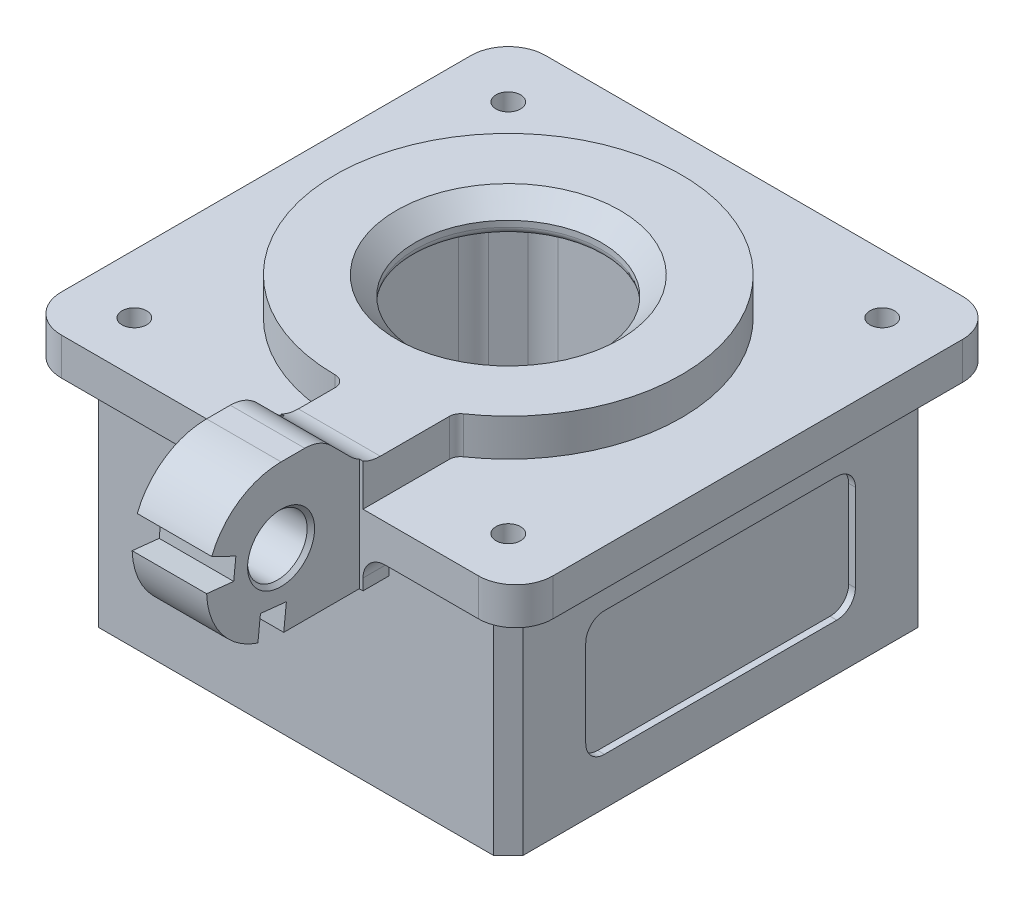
ISO-10303-21;
HEADER;
FILE_DESCRIPTION(('STEP AP214'),'2;1');
FILE_NAME('part.step','',(''),(''),'','','');
FILE_SCHEMA(('AUTOMOTIVE_DESIGN { 1 0 10303 214 1 1 1 1 }'));
ENDSEC;
DATA;
#1=APPLICATION_CONTEXT('core data for automotive mechanical design processes');
#2=APPLICATION_PROTOCOL_DEFINITION('international standard','automotive_design',2000,#1);
#3=PRODUCT_CONTEXT('',#1,'mechanical');
#4=PRODUCT('Part','Part','',(#3));
#5=PRODUCT_RELATED_PRODUCT_CATEGORY('part','',(#4));
#6=PRODUCT_DEFINITION_FORMATION('','',#4);
#7=PRODUCT_DEFINITION_CONTEXT('part definition',#1,'design');
#8=PRODUCT_DEFINITION('design','',#6,#7);
#9=PRODUCT_DEFINITION_SHAPE('','',#8);
#10=(LENGTH_UNIT() NAMED_UNIT(*) SI_UNIT(.MILLI.,.METRE.));
#11=(NAMED_UNIT(*) PLANE_ANGLE_UNIT() SI_UNIT($,.RADIAN.));
#12=(NAMED_UNIT(*) SI_UNIT($,.STERADIAN.) SOLID_ANGLE_UNIT());
#13=UNCERTAINTY_MEASURE_WITH_UNIT(LENGTH_MEASURE(1.E-05),#10,'distance_accuracy_value','');
#14=(GEOMETRIC_REPRESENTATION_CONTEXT(3) GLOBAL_UNCERTAINTY_ASSIGNED_CONTEXT((#13)) GLOBAL_UNIT_ASSIGNED_CONTEXT((#10,
#11,#12)) REPRESENTATION_CONTEXT('',''));
#15=CARTESIAN_POINT('',(0.,0.,0.));
#16=DIRECTION('',(0.,0.,1.));
#17=DIRECTION('',(1.,0.,0.));
#18=AXIS2_PLACEMENT_3D('',#15,#16,#17);
#19=CARTESIAN_POINT('',(12.5,49.5,42.5));
#20=DIRECTION('',(-1.,0.,0.));
#21=DIRECTION('',(0.,0.,1.));
#22=AXIS2_PLACEMENT_3D('',#19,#20,#21);
#23=PLANE('',#22);
#24=CARTESIAN_POINT('',(12.5,59.,29.6789321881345));
#25=DIRECTION('',(-1.,0.,0.));
#26=DIRECTION('',(0.,0.,1.));
#27=AXIS2_PLACEMENT_3D('',#24,#25,#26);
#28=CIRCLE('',#27,5.);
#29=CARTESIAN_POINT('',(12.5,54.,29.6789321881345));
#30=VERTEX_POINT('',#29);
#31=CARTESIAN_POINT('',(12.5,54.5713834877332,32.));
#32=VERTEX_POINT('',#31);
#33=EDGE_CURVE('E1899',#30,#32,#28,.T.);
#34=ORIENTED_EDGE('',*,*,#33,.T.);
#35=DIRECTION('',(0.,-1.,0.));
#36=VECTOR('',#35,1.);
#37=CARTESIAN_POINT('',(12.5,49.5,32.));
#38=LINE('',#37,#36);
#39=CARTESIAN_POINT('',(12.5,49.,32.));
#40=VERTEX_POINT('',#39);
#41=EDGE_CURVE('E1090',#32,#40,#38,.T.);
#42=ORIENTED_EDGE('',*,*,#41,.T.);
#43=DIRECTION('',(0.,0.,-1.));
#44=VECTOR('',#43,1.);
#45=CARTESIAN_POINT('',(12.5,49.,23.25));
#46=LINE('',#45,#44);
#47=CARTESIAN_POINT('',(12.5,49.,20.4098628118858));
#48=VERTEX_POINT('',#47);
#49=EDGE_CURVE('E1198',#40,#48,#46,.T.);
#50=ORIENTED_EDGE('',*,*,#49,.T.);
#51=DIRECTION('',(0.,1.,0.));
#52=VECTOR('',#51,1.);
#53=CARTESIAN_POINT('',(12.5,49.5,20.4098628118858));
#54=LINE('',#53,#52);
#55=CARTESIAN_POINT('',(12.5,54.,20.4098628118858));
#56=VERTEX_POINT('',#55);
#57=EDGE_CURVE('E1862',#48,#56,#54,.T.);
#58=ORIENTED_EDGE('',*,*,#57,.T.);
#59=DIRECTION('',(0.,0.,1.));
#60=VECTOR('',#59,1.);
#61=CARTESIAN_POINT('',(12.5,54.,23.25));
#62=LINE('',#61,#60);
#63=EDGE_CURVE('E1190',#56,#30,#62,.T.);
#64=ORIENTED_EDGE('',*,*,#63,.T.);
#65=EDGE_LOOP('',(#34,#42,#50,#58,#64));
#66=FACE_BOUND('',#65,.T.);
#67=ADVANCED_FACE('F297',(#66),#23,.F.);
#68=CARTESIAN_POINT('',(1.5,49.5,42.5));
#69=DIRECTION('',(-1.,0.,0.));
#70=DIRECTION('',(0.,0.,1.));
#71=AXIS2_PLACEMENT_3D('',#68,#69,#70);
#72=PLANE('',#71);
#73=DIRECTION('',(0.,-1.,0.));
#74=VECTOR('',#73,1.);
#75=CARTESIAN_POINT('',(1.5,49.5,32.));
#76=LINE('',#75,#74);
#77=CARTESIAN_POINT('',(1.5,54.5713834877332,32.));
#78=VERTEX_POINT('',#77);
#79=CARTESIAN_POINT('',(1.5,49.,32.));
#80=VERTEX_POINT('',#79);
#81=EDGE_CURVE('E1131',#78,#80,#76,.T.);
#82=ORIENTED_EDGE('',*,*,#81,.F.);
#83=CARTESIAN_POINT('',(1.5,59.,29.6789321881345));
#84=DIRECTION('',(-1.,0.,0.));
#85=DIRECTION('',(0.,0.,1.));
#86=AXIS2_PLACEMENT_3D('',#83,#84,#85);
#87=CIRCLE('',#86,5.);
#88=CARTESIAN_POINT('',(1.5,54.,29.6789321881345));
#89=VERTEX_POINT('',#88);
#90=EDGE_CURVE('E1902',#78,#89,#87,.F.);
#91=ORIENTED_EDGE('',*,*,#90,.T.);
#92=DIRECTION('',(0.,0.,1.));
#93=VECTOR('',#92,1.);
#94=CARTESIAN_POINT('',(1.5,54.,23.25));
#95=LINE('',#94,#93);
#96=CARTESIAN_POINT('',(1.5,54.,24.75));
#97=VERTEX_POINT('',#96);
#98=EDGE_CURVE('E1201',#97,#89,#95,.T.);
#99=ORIENTED_EDGE('',*,*,#98,.F.);
#100=DIRECTION('',(0.,-1.,0.));
#101=VECTOR('',#100,1.);
#102=CARTESIAN_POINT('',(1.5,49.,24.75));
#103=LINE('',#102,#101);
#104=CARTESIAN_POINT('',(1.5,49.,24.75));
#105=VERTEX_POINT('',#104);
#106=EDGE_CURVE('E1851',#97,#105,#103,.T.);
#107=ORIENTED_EDGE('',*,*,#106,.T.);
#108=DIRECTION('',(0.,0.,-1.));
#109=VECTOR('',#108,1.);
#110=CARTESIAN_POINT('',(1.5,49.,23.25));
#111=LINE('',#110,#109);
#112=EDGE_CURVE('E1209',#80,#105,#111,.T.);
#113=ORIENTED_EDGE('',*,*,#112,.F.);
#114=EDGE_LOOP('',(#82,#91,#99,#107,#113));
#115=FACE_BOUND('',#114,.T.);
#116=ADVANCED_FACE('F2013',(#115),#72,.T.);
#117=CARTESIAN_POINT('',(0.,49.7,0.));
#118=DIRECTION('',(0.,-1.,0.));
#119=DIRECTION('',(0.,0.,-1.));
#120=AXIS2_PLACEMENT_3D('',#117,#118,#119);
#121=PLANE('',#120);
#122=CARTESIAN_POINT('',(0.,49.7,0.));
#123=DIRECTION('',(0.,-1.,0.));
#124=DIRECTION('',(0.,0.,-1.));
#125=AXIS2_PLACEMENT_3D('',#122,#123,#124);
#126=CIRCLE('',#125,13.5);
#127=CARTESIAN_POINT('',(0.,49.7,-13.5));
#128=VERTEX_POINT('',#127);
#129=EDGE_CURVE('E1904',#128,#128,#126,.F.);
#130=ORIENTED_EDGE('',*,*,#129,.T.);
#131=EDGE_LOOP('',(#130));
#132=FACE_BOUND('',#131,.T.);
#133=CARTESIAN_POINT('',(0.,49.7,0.));
#134=DIRECTION('',(0.,-1.,0.));
#135=DIRECTION('',(0.,0.,-1.));
#136=AXIS2_PLACEMENT_3D('',#133,#134,#135);
#137=CIRCLE('',#136,16.);
#138=CARTESIAN_POINT('',(0.,49.7,-16.));
#139=VERTEX_POINT('',#138);
#140=EDGE_CURVE('E1169',#139,#139,#137,.T.);
#141=ORIENTED_EDGE('',*,*,#140,.T.);
#142=EDGE_LOOP('',(#141));
#143=FACE_BOUND('',#142,.T.);
#144=ADVANCED_FACE('F2146',(#132,#143),#121,.T.);
#145=CARTESIAN_POINT('',(0.,14.,0.));
#146=DIRECTION('',(0.,1.,0.));
#147=DIRECTION('',(0.,0.,1.));
#148=AXIS2_PLACEMENT_3D('',#145,#146,#147);
#149=CYLINDRICAL_SURFACE('',#148,12.5);
#150=CARTESIAN_POINT('',(0.,50.7,0.));
#151=DIRECTION('',(0.,-1.,0.));
#152=DIRECTION('',(0.,0.,-1.));
#153=AXIS2_PLACEMENT_3D('',#150,#151,#152);
#154=CIRCLE('',#153,12.5);
#155=CARTESIAN_POINT('',(0.,50.7,-12.5));
#156=VERTEX_POINT('',#155);
#157=EDGE_CURVE('E1907',#156,#156,#154,.T.);
#158=ORIENTED_EDGE('',*,*,#157,.T.);
#159=EDGE_LOOP('',(#158));
#160=FACE_BOUND('',#159,.T.);
#161=CARTESIAN_POINT('',(0.,51.5,0.));
#162=DIRECTION('',(0.,-1.,0.));
#163=DIRECTION('',(0.,0.,-1.));
#164=AXIS2_PLACEMENT_3D('',#161,#162,#163);
#165=CIRCLE('',#164,12.5);
#166=CARTESIAN_POINT('',(0.,51.5,-12.5));
#167=VERTEX_POINT('',#166);
#168=EDGE_CURVE('E1805',#167,#167,#165,.F.);
#169=ORIENTED_EDGE('',*,*,#168,.T.);
#170=EDGE_LOOP('',(#169));
#171=FACE_BOUND('',#170,.T.);
#172=ADVANCED_FACE('F2166',(#160,#171),#149,.F.);
#173=CARTESIAN_POINT('',(1.5,49.5,42.5));
#174=DIRECTION('',(1.,0.,0.));
#175=DIRECTION('',(0.,0.,-1.));
#176=AXIS2_PLACEMENT_3D('',#173,#174,#175);
#177=CYLINDRICAL_SURFACE('',#176,10.);
#178=CARTESIAN_POINT('',(12.,49.5,42.5));
#179=DIRECTION('',(-1.,0.,0.));
#180=DIRECTION('',(0.,0.,1.));
#181=AXIS2_PLACEMENT_3D('',#178,#179,#180);
#182=CIRCLE('',#181,10.);
#183=CARTESIAN_POINT('',(12.,49.1690310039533,52.4945214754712));
#184=VERTEX_POINT('',#183);
#185=CARTESIAN_POINT('',(12.,39.9960554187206,45.6104722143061));
#186=VERTEX_POINT('',#185);
#187=EDGE_CURVE('E1073',#184,#186,#182,.F.);
#188=ORIENTED_EDGE('',*,*,#187,.F.);
#189=DIRECTION('',(1.,0.,0.));
#190=VECTOR('',#189,1.);
#191=CARTESIAN_POINT('',(1.5,49.1690310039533,52.4945214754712));
#192=LINE('',#191,#190);
#193=CARTESIAN_POINT('',(2.,49.1690310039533,52.4945214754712));
#194=VERTEX_POINT('',#193);
#195=EDGE_CURVE('E1188',#184,#194,#192,.F.);
#196=ORIENTED_EDGE('',*,*,#195,.T.);
#197=CARTESIAN_POINT('',(2.,49.5,42.5));
#198=DIRECTION('',(1.,0.,0.));
#199=DIRECTION('',(0.,0.,-1.));
#200=AXIS2_PLACEMENT_3D('',#197,#198,#199);
#201=CIRCLE('',#200,10.);
#202=CARTESIAN_POINT('',(2.,39.9960554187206,45.6104722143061));
#203=VERTEX_POINT('',#202);
#204=EDGE_CURVE('E1110',#203,#194,#201,.F.);
#205=ORIENTED_EDGE('',*,*,#204,.F.);
#206=DIRECTION('',(1.,0.,0.));
#207=VECTOR('',#206,1.);
#208=CARTESIAN_POINT('',(-33.,39.9960554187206,45.6104722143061));
#209=LINE('',#208,#207);
#210=EDGE_CURVE('E1137',#203,#186,#209,.T.);
#211=ORIENTED_EDGE('',*,*,#210,.T.);
#212=EDGE_LOOP('',(#188,#196,#205,#211));
#213=FACE_BOUND('',#212,.T.);
#214=ADVANCED_FACE('F1968',(#213),#177,.T.);
#215=CARTESIAN_POINT('',(12.,49.5,42.5));
#216=DIRECTION('',(-1.,0.,0.));
#217=DIRECTION('',(0.,0.,1.));
#218=AXIS2_PLACEMENT_3D('',#215,#216,#217);
#219=CIRCLE('',#218,10.);
#220=CARTESIAN_POINT('',(12.,59.5,42.5));
#221=VERTEX_POINT('',#220);
#222=CARTESIAN_POINT('',(12.,53.1525231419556,51.8090855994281));
#223=VERTEX_POINT('',#222);
#224=EDGE_CURVE('E1081',#221,#223,#219,.F.);
#225=ORIENTED_EDGE('',*,*,#224,.F.);
#226=DIRECTION('',(1.,0.,0.));
#227=VECTOR('',#226,1.);
#228=CARTESIAN_POINT('',(1.5,59.5,42.5));
#229=LINE('',#228,#227);
#230=CARTESIAN_POINT('',(2.,59.5,42.5));
#231=VERTEX_POINT('',#230);
#232=EDGE_CURVE('E1212',#231,#221,#229,.T.);
#233=ORIENTED_EDGE('',*,*,#232,.F.);
#234=CARTESIAN_POINT('',(2.,49.5,42.5));
#235=DIRECTION('',(1.,0.,0.));
#236=DIRECTION('',(0.,0.,-1.));
#237=AXIS2_PLACEMENT_3D('',#234,#235,#236);
#238=CIRCLE('',#237,10.);
#239=CARTESIAN_POINT('',(2.00000000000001,53.1525231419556,51.8090855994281));
#240=VERTEX_POINT('',#239);
#241=EDGE_CURVE('E1121',#240,#231,#238,.F.);
#242=ORIENTED_EDGE('',*,*,#241,.F.);
#243=DIRECTION('',(1.,0.,0.));
#244=VECTOR('',#243,1.);
#245=CARTESIAN_POINT('',(1.5,53.1525231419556,51.8090855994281));
#246=LINE('',#245,#244);
#247=EDGE_CURVE('E1185',#240,#223,#246,.T.);
#248=ORIENTED_EDGE('',*,*,#247,.T.);
#249=EDGE_LOOP('',(#225,#233,#242,#248));
#250=FACE_BOUND('',#249,.T.);
#251=ADVANCED_FACE('F1989',(#250),#177,.T.);
#252=CARTESIAN_POINT('',(1.5,41.,32.));
#253=VERTEX_POINT('',#252);
#254=CARTESIAN_POINT('',(1.5,39.5,32.));
#255=VERTEX_POINT('',#254);
#256=EDGE_CURVE('E1133',#253,#255,#76,.T.);
#257=ORIENTED_EDGE('',*,*,#256,.F.);
#258=DIRECTION('',(0.,0.,1.));
#259=VECTOR('',#258,1.);
#260=CARTESIAN_POINT('',(1.5,41.,42.5));
#261=LINE('',#260,#259);
#262=CARTESIAN_POINT('',(1.5,41.,28.5));
#263=VERTEX_POINT('',#262);
#264=EDGE_CURVE('E1874',#253,#263,#261,.F.);
#265=ORIENTED_EDGE('',*,*,#264,.T.);
#266=DIRECTION('',(0.,1.,0.));
#267=VECTOR('',#266,1.);
#268=CARTESIAN_POINT('',(1.5,44.,28.5));
#269=LINE('',#268,#267);
#270=CARTESIAN_POINT('',(1.5,39.5,28.5));
#271=VERTEX_POINT('',#270);
#272=EDGE_CURVE('E1206',#271,#263,#269,.T.);
#273=ORIENTED_EDGE('',*,*,#272,.F.);
#274=DIRECTION('',(0.,0.,-1.));
#275=VECTOR('',#274,1.);
#276=CARTESIAN_POINT('',(1.5,39.5,28.5));
#277=LINE('',#276,#275);
#278=EDGE_CURVE('E1204',#255,#271,#277,.T.);
#279=ORIENTED_EDGE('',*,*,#278,.F.);
#280=EDGE_LOOP('',(#257,#265,#273,#279));
#281=FACE_BOUND('',#280,.T.);
#282=ADVANCED_FACE('F2109',(#281),#72,.T.);
#283=DIRECTION('',(0.,0.,1.));
#284=VECTOR('',#283,1.);
#285=CARTESIAN_POINT('',(12.5,41.,32.));
#286=LINE('',#285,#284);
#287=CARTESIAN_POINT('',(12.5,41.,28.5));
#288=VERTEX_POINT('',#287);
#289=CARTESIAN_POINT('',(12.5,41.,32.));
#290=VERTEX_POINT('',#289);
#291=EDGE_CURVE('E1880',#288,#290,#286,.T.);
#292=ORIENTED_EDGE('',*,*,#291,.T.);
#293=CARTESIAN_POINT('',(12.5,39.5,32.));
#294=VERTEX_POINT('',#293);
#295=EDGE_CURVE('E1093',#290,#294,#38,.T.);
#296=ORIENTED_EDGE('',*,*,#295,.T.);
#297=DIRECTION('',(0.,0.,-1.));
#298=VECTOR('',#297,1.);
#299=CARTESIAN_POINT('',(12.5,39.5,28.5));
#300=LINE('',#299,#298);
#301=CARTESIAN_POINT('',(12.5,39.5,28.5));
#302=VERTEX_POINT('',#301);
#303=EDGE_CURVE('E1193',#294,#302,#300,.T.);
#304=ORIENTED_EDGE('',*,*,#303,.T.);
#305=DIRECTION('',(0.,1.,0.));
#306=VECTOR('',#305,1.);
#307=CARTESIAN_POINT('',(12.5,44.,28.5));
#308=LINE('',#307,#306);
#309=EDGE_CURVE('E1195',#302,#288,#308,.T.);
#310=ORIENTED_EDGE('',*,*,#309,.T.);
#311=EDGE_LOOP('',(#292,#296,#304,#310));
#312=FACE_BOUND('',#311,.T.);
#313=ADVANCED_FACE('F2114',(#312),#23,.F.);
#314=CARTESIAN_POINT('',(0.,49.,0.));
#315=DIRECTION('',(0.,1.,0.));
#316=DIRECTION('',(0.,0.,1.));
#317=AXIS2_PLACEMENT_3D('',#314,#315,#316);
#318=PLANE('',#317);
#319=CARTESIAN_POINT('',(-25.1022907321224,49.,-25.1022907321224));
#320=DIRECTION('',(0.,1.,0.));
#321=DIRECTION('',(0.,0.,1.));
#322=AXIS2_PLACEMENT_3D('',#319,#320,#321);
#323=CIRCLE('',#322,1.65);
#324=CARTESIAN_POINT('',(-25.1022907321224,49.,-23.4522907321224));
#325=VERTEX_POINT('',#324);
#326=EDGE_CURVE('E1496',#325,#325,#323,.F.);
#327=ORIENTED_EDGE('',*,*,#326,.T.);
#328=EDGE_LOOP('',(#327));
#329=FACE_BOUND('',#328,.T.);
#330=CARTESIAN_POINT('',(25.1022907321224,49.,-25.1022907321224));
#331=DIRECTION('',(0.,1.,0.));
#332=DIRECTION('',(0.,0.,1.));
#333=AXIS2_PLACEMENT_3D('',#330,#331,#332);
#334=CIRCLE('',#333,1.64999999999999);
#335=CARTESIAN_POINT('',(25.1022907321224,49.,-23.4522907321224));
#336=VERTEX_POINT('',#335);
#337=EDGE_CURVE('E1497',#336,#336,#334,.F.);
#338=ORIENTED_EDGE('',*,*,#337,.T.);
#339=EDGE_LOOP('',(#338));
#340=FACE_BOUND('',#339,.T.);
#341=CARTESIAN_POINT('',(-25.1022907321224,49.,25.1022907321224));
#342=DIRECTION('',(0.,1.,0.));
#343=DIRECTION('',(0.,0.,1.));
#344=AXIS2_PLACEMENT_3D('',#341,#342,#343);
#345=CIRCLE('',#344,1.64999999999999);
#346=CARTESIAN_POINT('',(-25.1022907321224,49.,26.7522907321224));
#347=VERTEX_POINT('',#346);
#348=EDGE_CURVE('E1500',#347,#347,#345,.F.);
#349=ORIENTED_EDGE('',*,*,#348,.T.);
#350=EDGE_LOOP('',(#349));
#351=FACE_BOUND('',#350,.T.);
#352=CARTESIAN_POINT('',(25.1022907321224,49.,25.1022907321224));
#353=DIRECTION('',(0.,1.,0.));
#354=DIRECTION('',(0.,0.,1.));
#355=AXIS2_PLACEMENT_3D('',#352,#353,#354);
#356=CIRCLE('',#355,1.65);
#357=CARTESIAN_POINT('',(25.1022907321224,49.,26.7522907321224));
#358=VERTEX_POINT('',#357);
#359=EDGE_CURVE('E1503',#358,#358,#356,.F.);
#360=ORIENTED_EDGE('',*,*,#359,.T.);
#361=EDGE_LOOP('',(#360));
#362=FACE_BOUND('',#361,.T.);
#363=ORIENTED_EDGE('',*,*,#112,.T.);
#364=CARTESIAN_POINT('',(0.,49.,24.75));
#365=DIRECTION('',(0.,1.,0.));
#366=DIRECTION('',(0.,0.,1.));
#367=AXIS2_PLACEMENT_3D('',#364,#365,#366);
#368=CIRCLE('',#367,1.5);
#369=CARTESIAN_POINT('',(0.,49.,23.25));
#370=VERTEX_POINT('',#369);
#371=EDGE_CURVE('E1856',#105,#370,#368,.T.);
#372=ORIENTED_EDGE('',*,*,#371,.T.);
#373=CARTESIAN_POINT('',(0.,49.,0.));
#374=DIRECTION('',(0.,1.,0.));
#375=DIRECTION('',(0.,0.,1.));
#376=AXIS2_PLACEMENT_3D('',#373,#374,#375);
#377=CIRCLE('',#376,23.25);
#378=CARTESIAN_POINT('',(13.1515151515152,49.,19.1729014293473));
#379=VERTEX_POINT('',#378);
#380=EDGE_CURVE('E1482',#379,#370,#377,.T.);
#381=ORIENTED_EDGE('',*,*,#380,.F.);
#382=CARTESIAN_POINT('',(14.,49.,20.4098628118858));
#383=DIRECTION('',(0.,1.,0.));
#384=DIRECTION('',(0.,0.,1.));
#385=AXIS2_PLACEMENT_3D('',#382,#383,#384);
#386=CIRCLE('',#385,1.5);
#387=EDGE_CURVE('E1854',#379,#48,#386,.T.);
#388=ORIENTED_EDGE('',*,*,#387,.T.);
#389=ORIENTED_EDGE('',*,*,#49,.F.);
#390=DIRECTION('',(-1.,0.,0.));
#391=VECTOR('',#390,1.);
#392=CARTESIAN_POINT('',(-33.,49.,32.));
#393=LINE('',#392,#391);
#394=CARTESIAN_POINT('',(28.,49.,32.));
#395=VERTEX_POINT('',#394);
#396=EDGE_CURVE('E1476',#395,#40,#393,.T.);
#397=ORIENTED_EDGE('',*,*,#396,.F.);
#398=CARTESIAN_POINT('',(28.,49.,27.));
#399=DIRECTION('',(0.,1.,0.));
#400=DIRECTION('',(0.,0.,1.));
#401=AXIS2_PLACEMENT_3D('',#398,#399,#400);
#402=CIRCLE('',#401,5.);
#403=CARTESIAN_POINT('',(33.,49.,27.));
#404=VERTEX_POINT('',#403);
#405=EDGE_CURVE('E1835',#395,#404,#402,.T.);
#406=ORIENTED_EDGE('',*,*,#405,.T.);
#407=DIRECTION('',(0.,0.,-1.));
#408=VECTOR('',#407,1.);
#409=CARTESIAN_POINT('',(33.,49.,33.));
#410=LINE('',#409,#408);
#411=CARTESIAN_POINT('',(33.,49.,-28.));
#412=VERTEX_POINT('',#411);
#413=EDGE_CURVE('E1485',#404,#412,#410,.T.);
#414=ORIENTED_EDGE('',*,*,#413,.T.);
#415=CARTESIAN_POINT('',(28.,49.,-28.));
#416=DIRECTION('',(0.,1.,0.));
#417=DIRECTION('',(0.,0.,1.));
#418=AXIS2_PLACEMENT_3D('',#415,#416,#417);
#419=CIRCLE('',#418,5.);
#420=CARTESIAN_POINT('',(28.,49.,-33.));
#421=VERTEX_POINT('',#420);
#422=EDGE_CURVE('E1837',#412,#421,#419,.T.);
#423=ORIENTED_EDGE('',*,*,#422,.T.);
#424=DIRECTION('',(-1.,0.,0.));
#425=VECTOR('',#424,1.);
#426=CARTESIAN_POINT('',(33.,49.,-33.));
#427=LINE('',#426,#425);
#428=CARTESIAN_POINT('',(-28.,49.,-33.));
#429=VERTEX_POINT('',#428);
#430=EDGE_CURVE('E1490',#421,#429,#427,.T.);
#431=ORIENTED_EDGE('',*,*,#430,.T.);
#432=CARTESIAN_POINT('',(-28.,49.,-28.));
#433=DIRECTION('',(0.,1.,0.));
#434=DIRECTION('',(0.,0.,1.));
#435=AXIS2_PLACEMENT_3D('',#432,#433,#434);
#436=CIRCLE('',#435,5.);
#437=CARTESIAN_POINT('',(-33.,49.,-28.));
#438=VERTEX_POINT('',#437);
#439=EDGE_CURVE('E1839',#429,#438,#436,.T.);
#440=ORIENTED_EDGE('',*,*,#439,.T.);
#441=DIRECTION('',(0.,0.,1.));
#442=VECTOR('',#441,1.);
#443=CARTESIAN_POINT('',(-33.,49.,-33.));
#444=LINE('',#443,#442);
#445=CARTESIAN_POINT('',(-33.,49.,27.));
#446=VERTEX_POINT('',#445);
#447=EDGE_CURVE('E1493',#438,#446,#444,.T.);
#448=ORIENTED_EDGE('',*,*,#447,.T.);
#449=CARTESIAN_POINT('',(-28.,49.,27.));
#450=DIRECTION('',(0.,1.,0.));
#451=DIRECTION('',(0.,0.,1.));
#452=AXIS2_PLACEMENT_3D('',#449,#450,#451);
#453=CIRCLE('',#452,5.);
#454=CARTESIAN_POINT('',(-28.,49.,32.));
#455=VERTEX_POINT('',#454);
#456=EDGE_CURVE('E1832',#446,#455,#453,.T.);
#457=ORIENTED_EDGE('',*,*,#456,.T.);
#458=EDGE_CURVE('E1445',#80,#455,#393,.T.);
#459=ORIENTED_EDGE('',*,*,#458,.F.);
#460=EDGE_LOOP('',(#363,#372,#381,#388,#389,#397,#406,#414,#423,#431,#440,#448,#457,#459));
#461=FACE_BOUND('',#460,.T.);
#462=ADVANCED_FACE('F2017',(#329,#340,#351,#362,#461),#318,.T.);
#463=CARTESIAN_POINT('',(0.,49.,0.));
#464=DIRECTION('',(0.,1.,0.));
#465=DIRECTION('',(0.,0.,1.));
#466=AXIS2_PLACEMENT_3D('',#463,#464,#465);
#467=CYLINDRICAL_SURFACE('',#466,23.25);
#468=ORIENTED_EDGE('',*,*,#380,.T.);
#469=DIRECTION('',(0.,1.,0.));
#470=VECTOR('',#469,1.);
#471=CARTESIAN_POINT('',(0.,49.,23.25));
#472=LINE('',#471,#470);
#473=CARTESIAN_POINT('',(0.,54.,23.25));
#474=VERTEX_POINT('',#473);
#475=EDGE_CURVE('E1860',#370,#474,#472,.T.);
#476=ORIENTED_EDGE('',*,*,#475,.T.);
#477=CARTESIAN_POINT('',(0.,54.,0.));
#478=DIRECTION('',(0.,1.,0.));
#479=DIRECTION('',(0.,0.,1.));
#480=AXIS2_PLACEMENT_3D('',#477,#478,#479);
#481=CIRCLE('',#480,23.25);
#482=CARTESIAN_POINT('',(13.1515151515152,54.,19.1729014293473));
#483=VERTEX_POINT('',#482);
#484=EDGE_CURVE('E1481',#483,#474,#481,.T.);
#485=ORIENTED_EDGE('',*,*,#484,.F.);
#486=DIRECTION('',(0.,1.,0.));
#487=VECTOR('',#486,1.);
#488=CARTESIAN_POINT('',(13.1515151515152,49.,19.1729014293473));
#489=LINE('',#488,#487);
#490=EDGE_CURVE('E1858',#483,#379,#489,.F.);
#491=ORIENTED_EDGE('',*,*,#490,.T.);
#492=EDGE_LOOP('',(#468,#476,#485,#491));
#493=FACE_BOUND('',#492,.T.);
#494=ADVANCED_FACE('F2128',(#493),#467,.T.);
#495=CARTESIAN_POINT('',(-33.,14.,32.));
#496=DIRECTION('',(0.,0.,-1.));
#497=DIRECTION('',(-1.,0.,0.));
#498=AXIS2_PLACEMENT_3D('',#495,#496,#497);
#499=PLANE('',#498);
#500=ORIENTED_EDGE('',*,*,#396,.T.);
#501=ORIENTED_EDGE('',*,*,#41,.F.);
#502=DIRECTION('',(1.,0.,0.));
#503=VECTOR('',#502,1.);
#504=CARTESIAN_POINT('',(0.,54.5713834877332,32.));
#505=LINE('',#504,#503);
#506=CARTESIAN_POINT('',(12.,54.5713834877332,32.));
#507=VERTEX_POINT('',#506);
#508=EDGE_CURVE('E1921',#507,#32,#505,.T.);
#509=ORIENTED_EDGE('',*,*,#508,.F.);
#510=DIRECTION('',(0.,1.,0.));
#511=VECTOR('',#510,1.);
#512=CARTESIAN_POINT('',(12.,13.9999999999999,32.));
#513=LINE('',#512,#511);
#514=CARTESIAN_POINT('',(12.,39.5,32.));
#515=VERTEX_POINT('',#514);
#516=EDGE_CURVE('E1064',#515,#507,#513,.T.);
#517=ORIENTED_EDGE('',*,*,#516,.F.);
#518=DIRECTION('',(1.,0.,0.));
#519=VECTOR('',#518,1.);
#520=CARTESIAN_POINT('',(1.5,39.5,32.));
#521=LINE('',#520,#519);
#522=EDGE_CURVE('E1094',#515,#294,#521,.T.);
#523=ORIENTED_EDGE('',*,*,#522,.T.);
#524=ORIENTED_EDGE('',*,*,#295,.F.);
#525=CARTESIAN_POINT('',(15.5,41.,32.));
#526=DIRECTION('',(0.,0.,-1.));
#527=DIRECTION('',(-1.,0.,0.));
#528=AXIS2_PLACEMENT_3D('',#525,#526,#527);
#529=CIRCLE('',#528,3.);
#530=CARTESIAN_POINT('',(15.5,44.,32.));
#531=VERTEX_POINT('',#530);
#532=EDGE_CURVE('E1886',#290,#531,#529,.T.);
#533=ORIENTED_EDGE('',*,*,#532,.T.);
#534=DIRECTION('',(-1.,0.,0.));
#535=VECTOR('',#534,1.);
#536=CARTESIAN_POINT('',(0.,44.,32.));
#537=LINE('',#536,#535);
#538=CARTESIAN_POINT('',(28.,44.,32.));
#539=VERTEX_POINT('',#538);
#540=EDGE_CURVE('E1479',#539,#531,#537,.T.);
#541=ORIENTED_EDGE('',*,*,#540,.F.);
#542=DIRECTION('',(0.,1.,0.));
#543=VECTOR('',#542,1.);
#544=CARTESIAN_POINT('',(28.,14.,32.));
#545=LINE('',#544,#543);
#546=EDGE_CURVE('E1848',#539,#395,#545,.T.);
#547=ORIENTED_EDGE('',*,*,#546,.T.);
#548=EDGE_LOOP('',(#500,#501,#509,#517,#523,#524,#533,#541,#547));
#549=FACE_BOUND('',#548,.T.);
#550=ADVANCED_FACE('F2057',(#549),#499,.F.);
#551=CARTESIAN_POINT('',(24.5,16.,-24.5));
#552=DIRECTION('',(0.,1.,0.));
#553=DIRECTION('',(0.,0.,1.));
#554=AXIS2_PLACEMENT_3D('',#551,#552,#553);
#555=PLANE('',#554);
#556=DIRECTION('',(-0.707106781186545,0.,-0.70710678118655));
#557=VECTOR('',#556,1.);
#558=CARTESIAN_POINT('',(23.5,16.,-18.5));
#559=LINE('',#558,#557);
#560=CARTESIAN_POINT('',(19.6715728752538,16.,-22.3284271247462));
#561=VERTEX_POINT('',#560);
#562=CARTESIAN_POINT('',(22.3284271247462,16.,-19.6715728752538));
#563=VERTEX_POINT('',#562);
#564=EDGE_CURVE('E1630',#561,#563,#559,.F.);
#565=ORIENTED_EDGE('',*,*,#564,.F.);
#566=CARTESIAN_POINT('',(16.8431457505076,16.,-19.5));
#567=DIRECTION('',(0.,1.,0.));
#568=DIRECTION('',(0.,0.,1.));
#569=AXIS2_PLACEMENT_3D('',#566,#567,#568);
#570=CIRCLE('',#569,4.);
#571=CARTESIAN_POINT('',(16.8431457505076,16.,-23.5));
#572=VERTEX_POINT('',#571);
#573=EDGE_CURVE('E1627',#572,#561,#570,.F.);
#574=ORIENTED_EDGE('',*,*,#573,.F.);
#575=DIRECTION('',(1.,0.,0.));
#576=VECTOR('',#575,1.);
#577=CARTESIAN_POINT('',(-23.5,16.,-23.5));
#578=LINE('',#577,#576);
#579=CARTESIAN_POINT('',(-16.8431457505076,16.,-23.5));
#580=VERTEX_POINT('',#579);
#581=EDGE_CURVE('E1621',#580,#572,#578,.T.);
#582=ORIENTED_EDGE('',*,*,#581,.F.);
#583=CARTESIAN_POINT('',(-16.8431457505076,16.,-19.5));
#584=DIRECTION('',(0.,1.,0.));
#585=DIRECTION('',(0.,0.,1.));
#586=AXIS2_PLACEMENT_3D('',#583,#584,#585);
#587=CIRCLE('',#586,4.);
#588=CARTESIAN_POINT('',(-19.6715728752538,16.,-22.3284271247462));
#589=VERTEX_POINT('',#588);
#590=EDGE_CURVE('E1612',#589,#580,#587,.F.);
#591=ORIENTED_EDGE('',*,*,#590,.F.);
#592=DIRECTION('',(-0.707106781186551,0.,0.707106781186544));
#593=VECTOR('',#592,1.);
#594=CARTESIAN_POINT('',(-18.5,16.,-23.5));
#595=LINE('',#594,#593);
#596=CARTESIAN_POINT('',(-22.3284271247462,16.,-19.6715728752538));
#597=VERTEX_POINT('',#596);
#598=EDGE_CURVE('E1606',#597,#589,#595,.F.);
#599=ORIENTED_EDGE('',*,*,#598,.F.);
#600=CARTESIAN_POINT('',(-19.5,16.,-16.8431457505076));
#601=DIRECTION('',(0.,1.,0.));
#602=DIRECTION('',(0.,0.,1.));
#603=AXIS2_PLACEMENT_3D('',#600,#601,#602);
#604=CIRCLE('',#603,4.);
#605=CARTESIAN_POINT('',(-23.5,16.,-16.8431457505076));
#606=VERTEX_POINT('',#605);
#607=EDGE_CURVE('E1603',#606,#597,#604,.F.);
#608=ORIENTED_EDGE('',*,*,#607,.F.);
#609=DIRECTION('',(0.,0.,-1.));
#610=VECTOR('',#609,1.);
#611=CARTESIAN_POINT('',(-23.5,16.,-23.5));
#612=LINE('',#611,#610);
#613=CARTESIAN_POINT('',(-23.5,16.,16.8431457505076));
#614=VERTEX_POINT('',#613);
#615=EDGE_CURVE('E1597',#614,#606,#612,.T.);
#616=ORIENTED_EDGE('',*,*,#615,.F.);
#617=CARTESIAN_POINT('',(-19.5,16.,16.8431457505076));
#618=DIRECTION('',(0.,1.,0.));
#619=DIRECTION('',(0.,0.,1.));
#620=AXIS2_PLACEMENT_3D('',#617,#618,#619);
#621=CIRCLE('',#620,4.);
#622=CARTESIAN_POINT('',(-22.3284271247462,16.,19.6715728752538));
#623=VERTEX_POINT('',#622);
#624=EDGE_CURVE('E1765',#623,#614,#621,.F.);
#625=ORIENTED_EDGE('',*,*,#624,.F.);
#626=DIRECTION('',(0.707106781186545,0.,0.70710678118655));
#627=VECTOR('',#626,1.);
#628=CARTESIAN_POINT('',(-23.5,16.,18.5));
#629=LINE('',#628,#627);
#630=CARTESIAN_POINT('',(-19.6715728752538,16.,22.3284271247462));
#631=VERTEX_POINT('',#630);
#632=EDGE_CURVE('E1580',#631,#623,#629,.F.);
#633=ORIENTED_EDGE('',*,*,#632,.F.);
#634=CARTESIAN_POINT('',(-16.8431457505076,16.,19.5));
#635=DIRECTION('',(0.,1.,0.));
#636=DIRECTION('',(0.,0.,1.));
#637=AXIS2_PLACEMENT_3D('',#634,#635,#636);
#638=CIRCLE('',#637,4.);
#639=CARTESIAN_POINT('',(-16.8431457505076,16.,23.5));
#640=VERTEX_POINT('',#639);
#641=EDGE_CURVE('E1600',#640,#631,#638,.F.);
#642=ORIENTED_EDGE('',*,*,#641,.F.);
#643=DIRECTION('',(-1.,0.,0.));
#644=VECTOR('',#643,1.);
#645=CARTESIAN_POINT('',(-23.5,16.,23.5));
#646=LINE('',#645,#644);
#647=CARTESIAN_POINT('',(16.8431457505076,16.,23.5));
#648=VERTEX_POINT('',#647);
#649=EDGE_CURVE('E1609',#648,#640,#646,.T.);
#650=ORIENTED_EDGE('',*,*,#649,.F.);
#651=CARTESIAN_POINT('',(16.8431457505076,16.,19.5));
#652=DIRECTION('',(0.,1.,0.));
#653=DIRECTION('',(0.,0.,1.));
#654=AXIS2_PLACEMENT_3D('',#651,#652,#653);
#655=CIRCLE('',#654,4.);
#656=CARTESIAN_POINT('',(19.6715728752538,16.,22.3284271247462));
#657=VERTEX_POINT('',#656);
#658=EDGE_CURVE('E1615',#657,#648,#655,.F.);
#659=ORIENTED_EDGE('',*,*,#658,.F.);
#660=DIRECTION('',(0.707106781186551,0.,-0.707106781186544));
#661=VECTOR('',#660,1.);
#662=CARTESIAN_POINT('',(18.5,16.,23.5));
#663=LINE('',#662,#661);
#664=CARTESIAN_POINT('',(22.3284271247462,16.,19.6715728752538));
#665=VERTEX_POINT('',#664);
#666=EDGE_CURVE('E1618',#665,#657,#663,.F.);
#667=ORIENTED_EDGE('',*,*,#666,.F.);
#668=CARTESIAN_POINT('',(19.5,16.,16.8431457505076));
#669=DIRECTION('',(0.,1.,0.));
#670=DIRECTION('',(0.,0.,1.));
#671=AXIS2_PLACEMENT_3D('',#668,#669,#670);
#672=CIRCLE('',#671,4.);
#673=CARTESIAN_POINT('',(23.5,16.,16.8431457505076));
#674=VERTEX_POINT('',#673);
#675=EDGE_CURVE('E1624',#674,#665,#672,.F.);
#676=ORIENTED_EDGE('',*,*,#675,.F.);
#677=DIRECTION('',(0.,0.,1.));
#678=VECTOR('',#677,1.);
#679=CARTESIAN_POINT('',(23.5,16.,-23.5));
#680=LINE('',#679,#678);
#681=CARTESIAN_POINT('',(23.5,16.,-16.8431457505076));
#682=VERTEX_POINT('',#681);
#683=EDGE_CURVE('E1633',#682,#674,#680,.T.);
#684=ORIENTED_EDGE('',*,*,#683,.F.);
#685=CARTESIAN_POINT('',(19.5,16.,-16.8431457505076));
#686=DIRECTION('',(0.,1.,0.));
#687=DIRECTION('',(0.,0.,1.));
#688=AXIS2_PLACEMENT_3D('',#685,#686,#687);
#689=CIRCLE('',#688,4.);
#690=EDGE_CURVE('E1636',#563,#682,#689,.F.);
#691=ORIENTED_EDGE('',*,*,#690,.F.);
#692=EDGE_LOOP('',(#565,#574,#582,#591,#599,#608,#616,#625,#633,#642,#650,#659,#667,#676,#684,#691));
#693=FACE_BOUND('',#692,.T.);
#694=CARTESIAN_POINT('',(19.5,16.,-16.8431457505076));
#695=DIRECTION('',(0.,-1.,0.));
#696=DIRECTION('',(0.,0.,-1.));
#697=AXIS2_PLACEMENT_3D('',#694,#695,#696);
#698=CIRCLE('',#697,5.);
#699=CARTESIAN_POINT('',(23.0355339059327,16.,-20.3786796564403));
#700=VERTEX_POINT('',#699);
#701=CARTESIAN_POINT('',(24.5,16.,-16.8431457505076));
#702=VERTEX_POINT('',#701);
#703=EDGE_CURVE('E1216',#700,#702,#698,.T.);
#704=ORIENTED_EDGE('',*,*,#703,.T.);
#705=DIRECTION('',(0.,0.,1.));
#706=VECTOR('',#705,1.);
#707=CARTESIAN_POINT('',(24.5,16.,-16.8431457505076));
#708=LINE('',#707,#706);
#709=CARTESIAN_POINT('',(24.5,16.,16.8431457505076));
#710=VERTEX_POINT('',#709);
#711=EDGE_CURVE('E1271',#702,#710,#708,.T.);
#712=ORIENTED_EDGE('',*,*,#711,.T.);
#713=CARTESIAN_POINT('',(19.5,16.,16.8431457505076));
#714=DIRECTION('',(0.,-1.,0.));
#715=DIRECTION('',(0.,0.,-1.));
#716=AXIS2_PLACEMENT_3D('',#713,#714,#715);
#717=CIRCLE('',#716,5.);
#718=CARTESIAN_POINT('',(23.0355339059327,16.,20.3786796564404));
#719=VERTEX_POINT('',#718);
#720=EDGE_CURVE('E1274',#710,#719,#717,.T.);
#721=ORIENTED_EDGE('',*,*,#720,.T.);
#722=DIRECTION('',(-0.707106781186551,0.,0.707106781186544));
#723=VECTOR('',#722,1.);
#724=CARTESIAN_POINT('',(23.0355339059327,16.,20.3786796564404));
#725=LINE('',#724,#723);
#726=CARTESIAN_POINT('',(20.3786796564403,16.,23.0355339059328));
#727=VERTEX_POINT('',#726);
#728=EDGE_CURVE('E1277',#719,#727,#725,.T.);
#729=ORIENTED_EDGE('',*,*,#728,.T.);
#730=CARTESIAN_POINT('',(16.8431457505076,16.,19.5));
#731=DIRECTION('',(0.,-1.,0.));
#732=DIRECTION('',(0.,0.,-1.));
#733=AXIS2_PLACEMENT_3D('',#730,#731,#732);
#734=CIRCLE('',#733,5.);
#735=CARTESIAN_POINT('',(16.8431457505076,16.,24.5));
#736=VERTEX_POINT('',#735);
#737=EDGE_CURVE('E1280',#727,#736,#734,.T.);
#738=ORIENTED_EDGE('',*,*,#737,.T.);
#739=DIRECTION('',(-1.,0.,0.));
#740=VECTOR('',#739,1.);
#741=CARTESIAN_POINT('',(16.8431457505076,16.,24.5));
#742=LINE('',#741,#740);
#743=CARTESIAN_POINT('',(-16.8431457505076,16.,24.5));
#744=VERTEX_POINT('',#743);
#745=EDGE_CURVE('E1283',#736,#744,#742,.T.);
#746=ORIENTED_EDGE('',*,*,#745,.T.);
#747=CARTESIAN_POINT('',(-16.8431457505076,16.,19.5));
#748=DIRECTION('',(0.,-1.,0.));
#749=DIRECTION('',(0.,0.,-1.));
#750=AXIS2_PLACEMENT_3D('',#747,#748,#749);
#751=CIRCLE('',#750,5.);
#752=CARTESIAN_POINT('',(-20.3786796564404,16.,23.0355339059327));
#753=VERTEX_POINT('',#752);
#754=EDGE_CURVE('E1286',#744,#753,#751,.T.);
#755=ORIENTED_EDGE('',*,*,#754,.T.);
#756=DIRECTION('',(-0.707106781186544,0.,-0.707106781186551));
#757=VECTOR('',#756,1.);
#758=CARTESIAN_POINT('',(-20.3786796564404,16.,23.0355339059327));
#759=LINE('',#758,#757);
#760=CARTESIAN_POINT('',(-23.0355339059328,16.,20.3786796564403));
#761=VERTEX_POINT('',#760);
#762=EDGE_CURVE('E1289',#753,#761,#759,.T.);
#763=ORIENTED_EDGE('',*,*,#762,.T.);
#764=CARTESIAN_POINT('',(-19.5,16.,16.8431457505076));
#765=DIRECTION('',(0.,-1.,0.));
#766=DIRECTION('',(0.,0.,-1.));
#767=AXIS2_PLACEMENT_3D('',#764,#765,#766);
#768=CIRCLE('',#767,5.);
#769=CARTESIAN_POINT('',(-24.5,16.,16.8431457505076));
#770=VERTEX_POINT('',#769);
#771=EDGE_CURVE('E1292',#761,#770,#768,.T.);
#772=ORIENTED_EDGE('',*,*,#771,.T.);
#773=DIRECTION('',(0.,0.,-1.));
#774=VECTOR('',#773,1.);
#775=CARTESIAN_POINT('',(-24.5,16.,16.8431457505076));
#776=LINE('',#775,#774);
#777=CARTESIAN_POINT('',(-24.5,16.,-16.8431457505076));
#778=VERTEX_POINT('',#777);
#779=EDGE_CURVE('E1295',#770,#778,#776,.T.);
#780=ORIENTED_EDGE('',*,*,#779,.T.);
#781=CARTESIAN_POINT('',(-19.5,16.,-16.8431457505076));
#782=DIRECTION('',(0.,-1.,0.));
#783=DIRECTION('',(0.,0.,-1.));
#784=AXIS2_PLACEMENT_3D('',#781,#782,#783);
#785=CIRCLE('',#784,5.);
#786=CARTESIAN_POINT('',(-23.0355339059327,16.,-20.3786796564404));
#787=VERTEX_POINT('',#786);
#788=EDGE_CURVE('E1298',#778,#787,#785,.T.);
#789=ORIENTED_EDGE('',*,*,#788,.T.);
#790=DIRECTION('',(0.707106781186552,0.,-0.707106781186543));
#791=VECTOR('',#790,1.);
#792=CARTESIAN_POINT('',(-23.0355339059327,16.,-20.3786796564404));
#793=LINE('',#792,#791);
#794=CARTESIAN_POINT('',(-20.3786796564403,16.,-23.0355339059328));
#795=VERTEX_POINT('',#794);
#796=EDGE_CURVE('E1301',#787,#795,#793,.T.);
#797=ORIENTED_EDGE('',*,*,#796,.T.);
#798=CARTESIAN_POINT('',(-16.8431457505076,16.,-19.5));
#799=DIRECTION('',(0.,-1.,0.));
#800=DIRECTION('',(0.,0.,-1.));
#801=AXIS2_PLACEMENT_3D('',#798,#799,#800);
#802=CIRCLE('',#801,5.);
#803=CARTESIAN_POINT('',(-16.8431457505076,16.,-24.5));
#804=VERTEX_POINT('',#803);
#805=EDGE_CURVE('E1304',#795,#804,#802,.T.);
#806=ORIENTED_EDGE('',*,*,#805,.T.);
#807=DIRECTION('',(1.,0.,0.));
#808=VECTOR('',#807,1.);
#809=CARTESIAN_POINT('',(-16.8431457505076,16.,-24.5));
#810=LINE('',#809,#808);
#811=CARTESIAN_POINT('',(16.8431457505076,16.,-24.5));
#812=VERTEX_POINT('',#811);
#813=EDGE_CURVE('E1307',#804,#812,#810,.T.);
#814=ORIENTED_EDGE('',*,*,#813,.T.);
#815=CARTESIAN_POINT('',(16.8431457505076,16.,-19.5));
#816=DIRECTION('',(0.,-1.,0.));
#817=DIRECTION('',(0.,0.,-1.));
#818=AXIS2_PLACEMENT_3D('',#815,#816,#817);
#819=CIRCLE('',#818,5.);
#820=CARTESIAN_POINT('',(20.3786796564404,16.,-23.0355339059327));
#821=VERTEX_POINT('',#820);
#822=EDGE_CURVE('E1310',#812,#821,#819,.T.);
#823=ORIENTED_EDGE('',*,*,#822,.T.);
#824=DIRECTION('',(0.707106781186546,0.,0.707106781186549));
#825=VECTOR('',#824,1.);
#826=CARTESIAN_POINT('',(20.3786796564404,16.,-23.0355339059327));
#827=LINE('',#826,#825);
#828=EDGE_CURVE('E1223',#821,#700,#827,.T.);
#829=ORIENTED_EDGE('',*,*,#828,.T.);
#830=EDGE_LOOP('',(#704,#712,#721,#729,#738,#746,#755,#763,#772,#780,#789,#797,#806,#814,#823,#829));
#831=FACE_BOUND('',#830,.T.);
#832=ADVANCED_FACE('F2346',(#693,#831),#555,.F.);
#833=CARTESIAN_POINT('',(33.,54.,33.));
#834=DIRECTION('',(-1.,0.,0.));
#835=DIRECTION('',(0.,0.,1.));
#836=AXIS2_PLACEMENT_3D('',#833,#834,#835);
#837=PLANE('',#836);
#838=DIRECTION('',(0.,0.,1.));
#839=VECTOR('',#838,1.);
#840=CARTESIAN_POINT('',(33.,44.,33.));
#841=LINE('',#840,#839);
#842=CARTESIAN_POINT('',(33.,44.,-28.));
#843=VERTEX_POINT('',#842);
#844=CARTESIAN_POINT('',(33.,44.,27.));
#845=VERTEX_POINT('',#844);
#846=EDGE_CURVE('E1666',#843,#845,#841,.T.);
#847=ORIENTED_EDGE('',*,*,#846,.F.);
#848=DIRECTION('',(0.,-1.,0.));
#849=VECTOR('',#848,1.);
#850=CARTESIAN_POINT('',(33.,54.,-28.));
#851=LINE('',#850,#849);
#852=EDGE_CURVE('E1843',#843,#412,#851,.F.);
#853=ORIENTED_EDGE('',*,*,#852,.T.);
#854=ORIENTED_EDGE('',*,*,#413,.F.);
#855=DIRECTION('',(0.,1.,0.));
#856=VECTOR('',#855,1.);
#857=CARTESIAN_POINT('',(33.,54.,27.));
#858=LINE('',#857,#856);
#859=EDGE_CURVE('E1841',#404,#845,#858,.F.);
#860=ORIENTED_EDGE('',*,*,#859,.T.);
#861=EDGE_LOOP('',(#847,#853,#854,#860));
#862=FACE_BOUND('',#861,.T.);
#863=ADVANCED_FACE('F2049',(#862),#837,.F.);
#864=CARTESIAN_POINT('',(-33.,54.,-33.));
#865=DIRECTION('',(0.,0.,1.));
#866=DIRECTION('',(1.,0.,0.));
#867=AXIS2_PLACEMENT_3D('',#864,#865,#866);
#868=PLANE('',#867);
#869=DIRECTION('',(1.,0.,0.));
#870=VECTOR('',#869,1.);
#871=CARTESIAN_POINT('',(33.,44.,-33.));
#872=LINE('',#871,#870);
#873=CARTESIAN_POINT('',(-28.,44.,-33.));
#874=VERTEX_POINT('',#873);
#875=CARTESIAN_POINT('',(28.,44.,-33.));
#876=VERTEX_POINT('',#875);
#877=EDGE_CURVE('E1682',#874,#876,#872,.T.);
#878=ORIENTED_EDGE('',*,*,#877,.F.);
#879=DIRECTION('',(0.,-1.,0.));
#880=VECTOR('',#879,1.);
#881=CARTESIAN_POINT('',(-28.,54.,-33.));
#882=LINE('',#881,#880);
#883=EDGE_CURVE('E1830',#874,#429,#882,.F.);
#884=ORIENTED_EDGE('',*,*,#883,.T.);
#885=ORIENTED_EDGE('',*,*,#430,.F.);
#886=DIRECTION('',(0.,-1.,0.));
#887=VECTOR('',#886,1.);
#888=CARTESIAN_POINT('',(28.,54.,-33.));
#889=LINE('',#888,#887);
#890=EDGE_CURVE('E1827',#421,#876,#889,.T.);
#891=ORIENTED_EDGE('',*,*,#890,.T.);
#892=EDGE_LOOP('',(#878,#884,#885,#891));
#893=FACE_BOUND('',#892,.T.);
#894=ADVANCED_FACE('F2039',(#893),#868,.F.);
#895=CARTESIAN_POINT('',(-33.,54.,33.));
#896=DIRECTION('',(1.,0.,0.));
#897=DIRECTION('',(0.,0.,-1.));
#898=AXIS2_PLACEMENT_3D('',#895,#896,#897);
#899=PLANE('',#898);
#900=ORIENTED_EDGE('',*,*,#447,.F.);
#901=DIRECTION('',(0.,-1.,0.));
#902=VECTOR('',#901,1.);
#903=CARTESIAN_POINT('',(-33.,54.,-28.));
#904=LINE('',#903,#902);
#905=CARTESIAN_POINT('',(-33.,44.,-28.));
#906=VERTEX_POINT('',#905);
#907=EDGE_CURVE('E1816',#438,#906,#904,.T.);
#908=ORIENTED_EDGE('',*,*,#907,.T.);
#909=DIRECTION('',(0.,0.,-1.));
#910=VECTOR('',#909,1.);
#911=CARTESIAN_POINT('',(-33.,44.,-33.));
#912=LINE('',#911,#910);
#913=CARTESIAN_POINT('',(-33.,44.,27.));
#914=VERTEX_POINT('',#913);
#915=EDGE_CURVE('E1679',#914,#906,#912,.T.);
#916=ORIENTED_EDGE('',*,*,#915,.F.);
#917=DIRECTION('',(0.,1.,0.));
#918=VECTOR('',#917,1.);
#919=CARTESIAN_POINT('',(-33.,54.,27.));
#920=LINE('',#919,#918);
#921=EDGE_CURVE('E1811',#914,#446,#920,.T.);
#922=ORIENTED_EDGE('',*,*,#921,.T.);
#923=EDGE_LOOP('',(#900,#908,#916,#922));
#924=FACE_BOUND('',#923,.T.);
#925=ADVANCED_FACE('F2031',(#924),#899,.F.);
#926=CARTESIAN_POINT('',(0.,54.,0.));
#927=DIRECTION('',(0.,-1.,0.));
#928=DIRECTION('',(0.,0.,-1.));
#929=AXIS2_PLACEMENT_3D('',#926,#927,#928);
#930=PLANE('',#929);
#931=CARTESIAN_POINT('',(0.,54.,0.));
#932=DIRECTION('',(0.,-1.,0.));
#933=DIRECTION('',(0.,0.,-1.));
#934=AXIS2_PLACEMENT_3D('',#931,#932,#933);
#935=CIRCLE('',#934,15.);
#936=CARTESIAN_POINT('',(0.,54.,-15.));
#937=VERTEX_POINT('',#936);
#938=EDGE_CURVE('E1808',#937,#937,#935,.T.);
#939=ORIENTED_EDGE('',*,*,#938,.T.);
#940=EDGE_LOOP('',(#939));
#941=FACE_BOUND('',#940,.T.);
#942=ORIENTED_EDGE('',*,*,#98,.T.);
#943=DIRECTION('',(1.,0.,0.));
#944=VECTOR('',#943,1.);
#945=CARTESIAN_POINT('',(0.,54.,29.6789321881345));
#946=LINE('',#945,#944);
#947=EDGE_CURVE('E1889',#89,#30,#946,.T.);
#948=ORIENTED_EDGE('',*,*,#947,.T.);
#949=ORIENTED_EDGE('',*,*,#63,.F.);
#950=CARTESIAN_POINT('',(14.,54.,20.4098628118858));
#951=DIRECTION('',(0.,-1.,0.));
#952=DIRECTION('',(0.,0.,-1.));
#953=AXIS2_PLACEMENT_3D('',#950,#951,#952);
#954=CIRCLE('',#953,1.5);
#955=EDGE_CURVE('E1867',#56,#483,#954,.T.);
#956=ORIENTED_EDGE('',*,*,#955,.T.);
#957=ORIENTED_EDGE('',*,*,#484,.T.);
#958=CARTESIAN_POINT('',(0.,54.,24.75));
#959=DIRECTION('',(0.,-1.,0.));
#960=DIRECTION('',(0.,0.,-1.));
#961=AXIS2_PLACEMENT_3D('',#958,#959,#960);
#962=CIRCLE('',#961,1.5);
#963=EDGE_CURVE('E1865',#474,#97,#962,.T.);
#964=ORIENTED_EDGE('',*,*,#963,.T.);
#965=EDGE_LOOP('',(#942,#948,#949,#956,#957,#964));
#966=FACE_BOUND('',#965,.T.);
#967=ADVANCED_FACE('F2121',(#941,#966),#930,.F.);
#968=CARTESIAN_POINT('',(0.,14.,0.));
#969=DIRECTION('',(0.,-1.,0.));
#970=DIRECTION('',(0.,0.,-1.));
#971=AXIS2_PLACEMENT_3D('',#968,#969,#970);
#972=PLANE('',#971);
#973=CARTESIAN_POINT('',(24.5,14.,-24.5));
#974=DIRECTION('',(0.,-1.,0.));
#975=DIRECTION('',(0.,0.,1.));
#976=AXIS2_PLACEMENT_3D('',#973,#974,#975);
#977=CIRCLE('',#976,3.);
#978=CARTESIAN_POINT('',(24.5,14.,-27.5));
#979=VERTEX_POINT('',#978);
#980=CARTESIAN_POINT('',(27.5,14.,-24.5));
#981=VERTEX_POINT('',#980);
#982=EDGE_CURVE('E1530',#979,#981,#977,.T.);
#983=ORIENTED_EDGE('',*,*,#982,.F.);
#984=DIRECTION('',(1.,0.,0.));
#985=VECTOR('',#984,1.);
#986=CARTESIAN_POINT('',(-24.5,14.,-27.5));
#987=LINE('',#986,#985);
#988=CARTESIAN_POINT('',(-24.5,14.,-27.5));
#989=VERTEX_POINT('',#988);
#990=EDGE_CURVE('E1535',#989,#979,#987,.T.);
#991=ORIENTED_EDGE('',*,*,#990,.F.);
#992=CARTESIAN_POINT('',(-24.5,14.,-24.5));
#993=DIRECTION('',(0.,-1.,0.));
#994=DIRECTION('',(0.,0.,-1.));
#995=AXIS2_PLACEMENT_3D('',#992,#993,#994);
#996=CIRCLE('',#995,3.);
#997=CARTESIAN_POINT('',(-27.5,14.,-24.5));
#998=VERTEX_POINT('',#997);
#999=EDGE_CURVE('E1573',#998,#989,#996,.T.);
#1000=ORIENTED_EDGE('',*,*,#999,.F.);
#1001=DIRECTION('',(0.,0.,-1.));
#1002=VECTOR('',#1001,1.);
#1003=CARTESIAN_POINT('',(-27.5,14.,24.5));
#1004=LINE('',#1003,#1002);
#1005=CARTESIAN_POINT('',(-27.5,14.,24.5));
#1006=VERTEX_POINT('',#1005);
#1007=EDGE_CURVE('E1570',#1006,#998,#1004,.T.);
#1008=ORIENTED_EDGE('',*,*,#1007,.F.);
#1009=CARTESIAN_POINT('',(-24.5,14.,24.5));
#1010=DIRECTION('',(0.,-1.,0.));
#1011=DIRECTION('',(0.,0.,-1.));
#1012=AXIS2_PLACEMENT_3D('',#1009,#1010,#1011);
#1013=CIRCLE('',#1012,3.);
#1014=CARTESIAN_POINT('',(-24.5,14.,27.5));
#1015=VERTEX_POINT('',#1014);
#1016=EDGE_CURVE('E1567',#1015,#1006,#1013,.T.);
#1017=ORIENTED_EDGE('',*,*,#1016,.F.);
#1018=DIRECTION('',(-1.,0.,0.));
#1019=VECTOR('',#1018,1.);
#1020=CARTESIAN_POINT('',(24.5,14.,27.5));
#1021=LINE('',#1020,#1019);
#1022=CARTESIAN_POINT('',(24.5,14.,27.5));
#1023=VERTEX_POINT('',#1022);
#1024=EDGE_CURVE('E1564',#1023,#1015,#1021,.T.);
#1025=ORIENTED_EDGE('',*,*,#1024,.F.);
#1026=CARTESIAN_POINT('',(24.5,14.,24.5));
#1027=DIRECTION('',(0.,-1.,0.));
#1028=DIRECTION('',(0.,0.,-1.));
#1029=AXIS2_PLACEMENT_3D('',#1026,#1027,#1028);
#1030=CIRCLE('',#1029,3.);
#1031=CARTESIAN_POINT('',(27.5,14.,24.5));
#1032=VERTEX_POINT('',#1031);
#1033=EDGE_CURVE('E1561',#1032,#1023,#1030,.T.);
#1034=ORIENTED_EDGE('',*,*,#1033,.F.);
#1035=DIRECTION('',(0.,0.,1.));
#1036=VECTOR('',#1035,1.);
#1037=CARTESIAN_POINT('',(27.5,14.,-24.5));
#1038=LINE('',#1037,#1036);
#1039=EDGE_CURVE('E1558',#981,#1032,#1038,.T.);
#1040=ORIENTED_EDGE('',*,*,#1039,.F.);
#1041=EDGE_LOOP('',(#983,#991,#1000,#1008,#1017,#1025,#1034,#1040));
#1042=FACE_BOUND('',#1041,.T.);
#1043=DIRECTION('',(1.,0.,0.));
#1044=VECTOR('',#1043,1.);
#1045=CARTESIAN_POINT('',(-28.5,14.,-28.5));
#1046=LINE('',#1045,#1044);
#1047=CARTESIAN_POINT('',(-26.5,14.,-28.5));
#1048=VERTEX_POINT('',#1047);
#1049=CARTESIAN_POINT('',(26.5,14.,-28.5));
#1050=VERTEX_POINT('',#1049);
#1051=EDGE_CURVE('E1656',#1048,#1050,#1046,.T.);
#1052=ORIENTED_EDGE('',*,*,#1051,.T.);
#1053=DIRECTION('',(-0.707106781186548,0.,-0.707106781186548));
#1054=VECTOR('',#1053,1.);
#1055=CARTESIAN_POINT('',(27.5,14.,-27.5));
#1056=LINE('',#1055,#1054);
#1057=CARTESIAN_POINT('',(28.5,14.,-26.5));
#1058=VERTEX_POINT('',#1057);
#1059=EDGE_CURVE('E1779',#1050,#1058,#1056,.F.);
#1060=ORIENTED_EDGE('',*,*,#1059,.T.);
#1061=DIRECTION('',(0.,0.,1.));
#1062=VECTOR('',#1061,1.);
#1063=CARTESIAN_POINT('',(28.5,14.,-28.5));
#1064=LINE('',#1063,#1062);
#1065=CARTESIAN_POINT('',(28.5,14.,26.5));
#1066=VERTEX_POINT('',#1065);
#1067=EDGE_CURVE('E1651',#1058,#1066,#1064,.T.);
#1068=ORIENTED_EDGE('',*,*,#1067,.T.);
#1069=DIRECTION('',(0.707106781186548,0.,-0.707106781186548));
#1070=VECTOR('',#1069,1.);
#1071=CARTESIAN_POINT('',(27.5,14.,27.5));
#1072=LINE('',#1071,#1070);
#1073=CARTESIAN_POINT('',(26.5,14.,28.5));
#1074=VERTEX_POINT('',#1073);
#1075=EDGE_CURVE('E1777',#1066,#1074,#1072,.F.);
#1076=ORIENTED_EDGE('',*,*,#1075,.T.);
#1077=DIRECTION('',(-1.,0.,0.));
#1078=VECTOR('',#1077,1.);
#1079=CARTESIAN_POINT('',(-28.5,14.,28.5));
#1080=LINE('',#1079,#1078);
#1081=CARTESIAN_POINT('',(-26.5,14.,28.5));
#1082=VERTEX_POINT('',#1081);
#1083=EDGE_CURVE('E1669',#1074,#1082,#1080,.T.);
#1084=ORIENTED_EDGE('',*,*,#1083,.T.);
#1085=DIRECTION('',(0.707106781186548,0.,0.707106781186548));
#1086=VECTOR('',#1085,1.);
#1087=CARTESIAN_POINT('',(-27.5,14.,27.5));
#1088=LINE('',#1087,#1086);
#1089=CARTESIAN_POINT('',(-28.5,14.,26.5));
#1090=VERTEX_POINT('',#1089);
#1091=EDGE_CURVE('E1773',#1082,#1090,#1088,.F.);
#1092=ORIENTED_EDGE('',*,*,#1091,.T.);
#1093=DIRECTION('',(0.,0.,-1.));
#1094=VECTOR('',#1093,1.);
#1095=CARTESIAN_POINT('',(-28.5,14.,-28.5));
#1096=LINE('',#1095,#1094);
#1097=CARTESIAN_POINT('',(-28.5,14.,-26.5));
#1098=VERTEX_POINT('',#1097);
#1099=EDGE_CURVE('E1672',#1090,#1098,#1096,.T.);
#1100=ORIENTED_EDGE('',*,*,#1099,.T.);
#1101=DIRECTION('',(-0.707106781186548,0.,0.707106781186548));
#1102=VECTOR('',#1101,1.);
#1103=CARTESIAN_POINT('',(-27.5,14.,-27.5));
#1104=LINE('',#1103,#1102);
#1105=EDGE_CURVE('E1775',#1098,#1048,#1104,.F.);
#1106=ORIENTED_EDGE('',*,*,#1105,.T.);
#1107=EDGE_LOOP('',(#1052,#1060,#1068,#1076,#1084,#1092,#1100,#1106));
#1108=FACE_BOUND('',#1107,.T.);
#1109=ADVANCED_FACE('F2426',(#1042,#1108),#972,.T.);
#1110=CARTESIAN_POINT('',(0.,46.7,0.));
#1111=DIRECTION('',(0.,1.,0.));
#1112=DIRECTION('',(0.,0.,1.));
#1113=AXIS2_PLACEMENT_3D('',#1110,#1111,#1112);
#1114=PLANE('',#1113);
#1115=CARTESIAN_POINT('',(-20.,46.7,0.));
#1116=DIRECTION('',(0.,-1.,0.));
#1117=DIRECTION('',(0.,0.,-1.));
#1118=AXIS2_PLACEMENT_3D('',#1115,#1116,#1117);
#1119=CIRCLE('',#1118,1.24999999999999);
#1120=CARTESIAN_POINT('',(-20.,46.7,-1.25000000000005));
#1121=VERTEX_POINT('',#1120);
#1122=EDGE_CURVE('E1140',#1121,#1121,#1119,.T.);
#1123=ORIENTED_EDGE('',*,*,#1122,.F.);
#1124=EDGE_LOOP('',(#1123));
#1125=FACE_BOUND('',#1124,.T.);
#1126=CARTESIAN_POINT('',(0.,46.7,20.));
#1127=DIRECTION('',(0.,-1.,0.));
#1128=DIRECTION('',(0.,0.,-1.));
#1129=AXIS2_PLACEMENT_3D('',#1126,#1127,#1128);
#1130=CIRCLE('',#1129,1.24999999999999);
#1131=CARTESIAN_POINT('',(0.,46.7,18.75));
#1132=VERTEX_POINT('',#1131);
#1133=EDGE_CURVE('E1151',#1132,#1132,#1130,.T.);
#1134=ORIENTED_EDGE('',*,*,#1133,.F.);
#1135=EDGE_LOOP('',(#1134));
#1136=FACE_BOUND('',#1135,.T.);
#1137=CARTESIAN_POINT('',(20.,46.7,0.));
#1138=DIRECTION('',(0.,-1.,0.));
#1139=DIRECTION('',(0.,0.,-1.));
#1140=AXIS2_PLACEMENT_3D('',#1137,#1138,#1139);
#1141=CIRCLE('',#1140,1.24999999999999);
#1142=CARTESIAN_POINT('',(20.,46.7,-1.24999999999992));
#1143=VERTEX_POINT('',#1142);
#1144=EDGE_CURVE('E1157',#1143,#1143,#1141,.T.);
#1145=ORIENTED_EDGE('',*,*,#1144,.F.);
#1146=EDGE_LOOP('',(#1145));
#1147=FACE_BOUND('',#1146,.T.);
#1148=CARTESIAN_POINT('',(-1.52862994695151E-13,46.7,-20.));
#1149=DIRECTION('',(0.,-1.,0.));
#1150=DIRECTION('',(0.,0.,-1.));
#1151=AXIS2_PLACEMENT_3D('',#1148,#1149,#1150);
#1152=CIRCLE('',#1151,1.24999999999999);
#1153=CARTESIAN_POINT('',(-1.52862994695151E-13,46.7,-21.25));
#1154=VERTEX_POINT('',#1153);
#1155=EDGE_CURVE('E1163',#1154,#1154,#1152,.T.);
#1156=ORIENTED_EDGE('',*,*,#1155,.F.);
#1157=EDGE_LOOP('',(#1156));
#1158=FACE_BOUND('',#1157,.T.);
#1159=CARTESIAN_POINT('',(0.,46.7,0.));
#1160=DIRECTION('',(0.,-1.,0.));
#1161=DIRECTION('',(0.,0.,-1.));
#1162=AXIS2_PLACEMENT_3D('',#1159,#1160,#1161);
#1163=CIRCLE('',#1162,17.5);
#1164=CARTESIAN_POINT('',(0.,46.7,-17.5));
#1165=VERTEX_POINT('',#1164);
#1166=EDGE_CURVE('E1178',#1165,#1165,#1163,.T.);
#1167=ORIENTED_EDGE('',*,*,#1166,.F.);
#1168=EDGE_LOOP('',(#1167));
#1169=FACE_BOUND('',#1168,.T.);
#1170=DIRECTION('',(0.707106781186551,0.,-0.707106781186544));
#1171=VECTOR('',#1170,1.);
#1172=CARTESIAN_POINT('',(18.5,46.7,23.5));
#1173=LINE('',#1172,#1171);
#1174=CARTESIAN_POINT('',(22.3284271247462,46.7,19.6715728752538));
#1175=VERTEX_POINT('',#1174);
#1176=CARTESIAN_POINT('',(19.6715728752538,46.7,22.3284271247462));
#1177=VERTEX_POINT('',#1176);
#1178=EDGE_CURVE('E1717',#1175,#1177,#1173,.F.);
#1179=ORIENTED_EDGE('',*,*,#1178,.T.);
#1180=CARTESIAN_POINT('',(16.8431457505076,46.7,19.5));
#1181=DIRECTION('',(0.,1.,0.));
#1182=DIRECTION('',(0.,0.,1.));
#1183=AXIS2_PLACEMENT_3D('',#1180,#1181,#1182);
#1184=CIRCLE('',#1183,4.);
#1185=CARTESIAN_POINT('',(16.8431457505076,46.7,23.5));
#1186=VERTEX_POINT('',#1185);
#1187=EDGE_CURVE('E1743',#1177,#1186,#1184,.F.);
#1188=ORIENTED_EDGE('',*,*,#1187,.T.);
#1189=DIRECTION('',(-1.,0.,0.));
#1190=VECTOR('',#1189,1.);
#1191=CARTESIAN_POINT('',(-23.5,46.7,23.5));
#1192=LINE('',#1191,#1190);
#1193=CARTESIAN_POINT('',(-16.8431457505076,46.7,23.5));
#1194=VERTEX_POINT('',#1193);
#1195=EDGE_CURVE('E1688',#1186,#1194,#1192,.T.);
#1196=ORIENTED_EDGE('',*,*,#1195,.T.);
#1197=CARTESIAN_POINT('',(-16.8431457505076,46.7,19.5));
#1198=DIRECTION('',(0.,1.,0.));
#1199=DIRECTION('',(0.,0.,1.));
#1200=AXIS2_PLACEMENT_3D('',#1197,#1198,#1199);
#1201=CIRCLE('',#1200,4.);
#1202=CARTESIAN_POINT('',(-19.6715728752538,46.7,22.3284271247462));
#1203=VERTEX_POINT('',#1202);
#1204=EDGE_CURVE('E1735',#1194,#1203,#1201,.F.);
#1205=ORIENTED_EDGE('',*,*,#1204,.T.);
#1206=DIRECTION('',(0.707106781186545,0.,0.70710678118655));
#1207=VECTOR('',#1206,1.);
#1208=CARTESIAN_POINT('',(-23.5,46.7,18.5));
#1209=LINE('',#1208,#1207);
#1210=CARTESIAN_POINT('',(-22.3284271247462,46.7,19.6715728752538));
#1211=VERTEX_POINT('',#1210);
#1212=EDGE_CURVE('E1720',#1203,#1211,#1209,.F.);
#1213=ORIENTED_EDGE('',*,*,#1212,.T.);
#1214=CARTESIAN_POINT('',(-19.5,46.7,16.8431457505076));
#1215=DIRECTION('',(0.,1.,0.));
#1216=DIRECTION('',(0.,0.,1.));
#1217=AXIS2_PLACEMENT_3D('',#1214,#1215,#1216);
#1218=CIRCLE('',#1217,4.);
#1219=CARTESIAN_POINT('',(-23.5,46.7,16.8431457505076));
#1220=VERTEX_POINT('',#1219);
#1221=EDGE_CURVE('E1733',#1211,#1220,#1218,.F.);
#1222=ORIENTED_EDGE('',*,*,#1221,.T.);
#1223=DIRECTION('',(0.,0.,-1.));
#1224=VECTOR('',#1223,1.);
#1225=CARTESIAN_POINT('',(-23.5,46.7,-23.5));
#1226=LINE('',#1225,#1224);
#1227=CARTESIAN_POINT('',(-23.5,46.7,-16.8431457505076));
#1228=VERTEX_POINT('',#1227);
#1229=EDGE_CURVE('E1691',#1220,#1228,#1226,.T.);
#1230=ORIENTED_EDGE('',*,*,#1229,.T.);
#1231=CARTESIAN_POINT('',(-19.5,46.7,-16.8431457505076));
#1232=DIRECTION('',(0.,1.,0.));
#1233=DIRECTION('',(0.,0.,1.));
#1234=AXIS2_PLACEMENT_3D('',#1231,#1232,#1233);
#1235=CIRCLE('',#1234,4.);
#1236=CARTESIAN_POINT('',(-22.3284271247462,46.7,-19.6715728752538));
#1237=VERTEX_POINT('',#1236);
#1238=EDGE_CURVE('E1739',#1228,#1237,#1235,.F.);
#1239=ORIENTED_EDGE('',*,*,#1238,.T.);
#1240=DIRECTION('',(-0.707106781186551,0.,0.707106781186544));
#1241=VECTOR('',#1240,1.);
#1242=CARTESIAN_POINT('',(-18.5,46.7,-23.5));
#1243=LINE('',#1242,#1241);
#1244=CARTESIAN_POINT('',(-19.6715728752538,46.7,-22.3284271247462));
#1245=VERTEX_POINT('',#1244);
#1246=EDGE_CURVE('E1714',#1237,#1245,#1243,.F.);
#1247=ORIENTED_EDGE('',*,*,#1246,.T.);
#1248=CARTESIAN_POINT('',(-16.8431457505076,46.7,-19.5));
#1249=DIRECTION('',(0.,1.,0.));
#1250=DIRECTION('',(0.,0.,1.));
#1251=AXIS2_PLACEMENT_3D('',#1248,#1249,#1250);
#1252=CIRCLE('',#1251,4.);
#1253=CARTESIAN_POINT('',(-16.8431457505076,46.7,-23.5));
#1254=VERTEX_POINT('',#1253);
#1255=EDGE_CURVE('E1737',#1245,#1254,#1252,.F.);
#1256=ORIENTED_EDGE('',*,*,#1255,.T.);
#1257=DIRECTION('',(1.,0.,0.));
#1258=VECTOR('',#1257,1.);
#1259=CARTESIAN_POINT('',(-23.5,46.7,-23.5));
#1260=LINE('',#1259,#1258);
#1261=CARTESIAN_POINT('',(16.8431457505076,46.7,-23.5));
#1262=VERTEX_POINT('',#1261);
#1263=EDGE_CURVE('E1694',#1254,#1262,#1260,.T.);
#1264=ORIENTED_EDGE('',*,*,#1263,.T.);
#1265=CARTESIAN_POINT('',(16.8431457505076,46.7,-19.5));
#1266=DIRECTION('',(0.,1.,0.));
#1267=DIRECTION('',(0.,0.,1.));
#1268=AXIS2_PLACEMENT_3D('',#1265,#1266,#1267);
#1269=CIRCLE('',#1268,4.);
#1270=CARTESIAN_POINT('',(19.6715728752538,46.7,-22.3284271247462));
#1271=VERTEX_POINT('',#1270);
#1272=EDGE_CURVE('E1708',#1262,#1271,#1269,.F.);
#1273=ORIENTED_EDGE('',*,*,#1272,.T.);
#1274=DIRECTION('',(-0.707106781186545,0.,-0.70710678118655));
#1275=VECTOR('',#1274,1.);
#1276=CARTESIAN_POINT('',(23.5,46.7,-18.5));
#1277=LINE('',#1276,#1275);
#1278=CARTESIAN_POINT('',(22.3284271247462,46.7,-19.6715728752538));
#1279=VERTEX_POINT('',#1278);
#1280=EDGE_CURVE('E1697',#1271,#1279,#1277,.F.);
#1281=ORIENTED_EDGE('',*,*,#1280,.T.);
#1282=CARTESIAN_POINT('',(19.5,46.7,-16.8431457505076));
#1283=DIRECTION('',(0.,1.,0.));
#1284=DIRECTION('',(0.,0.,1.));
#1285=AXIS2_PLACEMENT_3D('',#1282,#1283,#1284);
#1286=CIRCLE('',#1285,4.);
#1287=CARTESIAN_POINT('',(23.5,46.7,-16.8431457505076));
#1288=VERTEX_POINT('',#1287);
#1289=EDGE_CURVE('E1710',#1279,#1288,#1286,.F.);
#1290=ORIENTED_EDGE('',*,*,#1289,.T.);
#1291=DIRECTION('',(0.,0.,1.));
#1292=VECTOR('',#1291,1.);
#1293=CARTESIAN_POINT('',(23.5,46.7,-23.5));
#1294=LINE('',#1293,#1292);
#1295=CARTESIAN_POINT('',(23.5,46.7,16.8431457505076));
#1296=VERTEX_POINT('',#1295);
#1297=EDGE_CURVE('E1685',#1288,#1296,#1294,.T.);
#1298=ORIENTED_EDGE('',*,*,#1297,.T.);
#1299=CARTESIAN_POINT('',(19.5,46.7,16.8431457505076));
#1300=DIRECTION('',(0.,1.,0.));
#1301=DIRECTION('',(0.,0.,1.));
#1302=AXIS2_PLACEMENT_3D('',#1299,#1300,#1301);
#1303=CIRCLE('',#1302,4.);
#1304=EDGE_CURVE('E1741',#1296,#1175,#1303,.F.);
#1305=ORIENTED_EDGE('',*,*,#1304,.T.);
#1306=EDGE_LOOP('',(#1179,#1188,#1196,#1205,#1213,#1222,#1230,#1239,#1247,#1256,#1264,#1273,
#1281,#1290,#1298,#1305));
#1307=FACE_BOUND('',#1306,.T.);
#1308=ADVANCED_FACE('F2422',(#1125,#1136,#1147,#1158,#1169,#1307),#1114,.F.);
#1309=CARTESIAN_POINT('',(23.5,46.7,-23.5));
#1310=DIRECTION('',(1.,0.,0.));
#1311=DIRECTION('',(0.,0.,-1.));
#1312=AXIS2_PLACEMENT_3D('',#1309,#1310,#1311);
#1313=PLANE('',#1312);
#1314=DIRECTION('',(0.,1.,0.));
#1315=VECTOR('',#1314,1.);
#1316=CARTESIAN_POINT('',(23.5,14.,-16.8431457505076));
#1317=LINE('',#1316,#1315);
#1318=EDGE_CURVE('E1700',#1288,#682,#1317,.F.);
#1319=ORIENTED_EDGE('',*,*,#1318,.T.);
#1320=ORIENTED_EDGE('',*,*,#683,.T.);
#1321=DIRECTION('',(0.,-1.,0.));
#1322=VECTOR('',#1321,1.);
#1323=CARTESIAN_POINT('',(23.5,46.7,16.8431457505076));
#1324=LINE('',#1323,#1322);
#1325=EDGE_CURVE('E1745',#674,#1296,#1324,.F.);
#1326=ORIENTED_EDGE('',*,*,#1325,.T.);
#1327=ORIENTED_EDGE('',*,*,#1297,.F.);
#1328=EDGE_LOOP('',(#1319,#1320,#1326,#1327));
#1329=FACE_BOUND('',#1328,.T.);
#1330=ADVANCED_FACE('F2425',(#1329),#1313,.F.);
#1331=CARTESIAN_POINT('',(-23.5,46.7,-23.5));
#1332=DIRECTION('',(0.,0.,-1.));
#1333=DIRECTION('',(-1.,0.,0.));
#1334=AXIS2_PLACEMENT_3D('',#1331,#1332,#1333);
#1335=PLANE('',#1334);
#1336=DIRECTION('',(0.,1.,0.));
#1337=VECTOR('',#1336,1.);
#1338=CARTESIAN_POINT('',(-16.8431457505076,14.,-23.5));
#1339=LINE('',#1338,#1337);
#1340=EDGE_CURVE('E1757',#1254,#580,#1339,.F.);
#1341=ORIENTED_EDGE('',*,*,#1340,.T.);
#1342=ORIENTED_EDGE('',*,*,#581,.T.);
#1343=DIRECTION('',(0.,-1.,0.));
#1344=VECTOR('',#1343,1.);
#1345=CARTESIAN_POINT('',(16.8431457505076,46.7,-23.5));
#1346=LINE('',#1345,#1344);
#1347=EDGE_CURVE('E1712',#572,#1262,#1346,.F.);
#1348=ORIENTED_EDGE('',*,*,#1347,.T.);
#1349=ORIENTED_EDGE('',*,*,#1263,.F.);
#1350=EDGE_LOOP('',(#1341,#1342,#1348,#1349));
#1351=FACE_BOUND('',#1350,.T.);
#1352=ADVANCED_FACE('F2428',(#1351),#1335,.F.);
#1353=CARTESIAN_POINT('',(-23.5,46.7,-23.5));
#1354=DIRECTION('',(-1.,0.,0.));
#1355=DIRECTION('',(0.,0.,1.));
#1356=AXIS2_PLACEMENT_3D('',#1353,#1354,#1355);
#1357=PLANE('',#1356);
#1358=DIRECTION('',(0.,1.,0.));
#1359=VECTOR('',#1358,1.);
#1360=CARTESIAN_POINT('',(-23.5,14.,16.8431457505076));
#1361=LINE('',#1360,#1359);
#1362=EDGE_CURVE('E1747',#1220,#614,#1361,.F.);
#1363=ORIENTED_EDGE('',*,*,#1362,.T.);
#1364=ORIENTED_EDGE('',*,*,#615,.T.);
#1365=DIRECTION('',(0.,-1.,0.));
#1366=VECTOR('',#1365,1.);
#1367=CARTESIAN_POINT('',(-23.5,46.7,-16.8431457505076));
#1368=LINE('',#1367,#1366);
#1369=EDGE_CURVE('E1750',#606,#1228,#1368,.F.);
#1370=ORIENTED_EDGE('',*,*,#1369,.T.);
#1371=ORIENTED_EDGE('',*,*,#1229,.F.);
#1372=EDGE_LOOP('',(#1363,#1364,#1370,#1371));
#1373=FACE_BOUND('',#1372,.T.);
#1374=ADVANCED_FACE('F2431',(#1373),#1357,.F.);
#1375=CARTESIAN_POINT('',(-23.5,46.7,23.5));
#1376=DIRECTION('',(0.,0.,1.));
#1377=DIRECTION('',(1.,0.,0.));
#1378=AXIS2_PLACEMENT_3D('',#1375,#1376,#1377);
#1379=PLANE('',#1378);
#1380=DIRECTION('',(0.,1.,0.));
#1381=VECTOR('',#1380,1.);
#1382=CARTESIAN_POINT('',(16.8431457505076,14.,23.5));
#1383=LINE('',#1382,#1381);
#1384=EDGE_CURVE('E1725',#1186,#648,#1383,.F.);
#1385=ORIENTED_EDGE('',*,*,#1384,.T.);
#1386=ORIENTED_EDGE('',*,*,#649,.T.);
#1387=DIRECTION('',(0.,-1.,0.));
#1388=VECTOR('',#1387,1.);
#1389=CARTESIAN_POINT('',(-16.8431457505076,46.7,23.5));
#1390=LINE('',#1389,#1388);
#1391=EDGE_CURVE('E1723',#640,#1194,#1390,.F.);
#1392=ORIENTED_EDGE('',*,*,#1391,.T.);
#1393=ORIENTED_EDGE('',*,*,#1195,.F.);
#1394=EDGE_LOOP('',(#1385,#1386,#1392,#1393));
#1395=FACE_BOUND('',#1394,.T.);
#1396=ADVANCED_FACE('F2421',(#1395),#1379,.F.);
#1397=CARTESIAN_POINT('',(0.,44.,0.));
#1398=DIRECTION('',(0.,1.,0.));
#1399=DIRECTION('',(0.,0.,1.));
#1400=AXIS2_PLACEMENT_3D('',#1397,#1398,#1399);
#1401=PLANE('',#1400);
#1402=DIRECTION('',(-1.,0.,0.));
#1403=VECTOR('',#1402,1.);
#1404=CARTESIAN_POINT('',(-28.5,44.,28.5));
#1405=LINE('',#1404,#1403);
#1406=CARTESIAN_POINT('',(-1.5,44.,28.5));
#1407=VERTEX_POINT('',#1406);
#1408=CARTESIAN_POINT('',(-26.5,44.,28.5));
#1409=VERTEX_POINT('',#1408);
#1410=EDGE_CURVE('E1655',#1407,#1409,#1405,.T.);
#1411=ORIENTED_EDGE('',*,*,#1410,.F.);
#1412=DIRECTION('',(0.,0.,1.));
#1413=VECTOR('',#1412,1.);
#1414=CARTESIAN_POINT('',(-1.5,44.,0.));
#1415=LINE('',#1414,#1413);
#1416=CARTESIAN_POINT('',(-1.5,44.,32.));
#1417=VERTEX_POINT('',#1416);
#1418=EDGE_CURVE('E1871',#1407,#1417,#1415,.T.);
#1419=ORIENTED_EDGE('',*,*,#1418,.T.);
#1420=CARTESIAN_POINT('',(-28.,44.,32.));
#1421=VERTEX_POINT('',#1420);
#1422=EDGE_CURVE('E1478',#1417,#1421,#537,.T.);
#1423=ORIENTED_EDGE('',*,*,#1422,.T.);
#1424=CARTESIAN_POINT('',(-28.,44.,27.));
#1425=DIRECTION('',(0.,1.,0.));
#1426=DIRECTION('',(0.,0.,1.));
#1427=AXIS2_PLACEMENT_3D('',#1424,#1425,#1426);
#1428=CIRCLE('',#1427,5.);
#1429=EDGE_CURVE('E1819',#1421,#914,#1428,.F.);
#1430=ORIENTED_EDGE('',*,*,#1429,.T.);
#1431=ORIENTED_EDGE('',*,*,#915,.T.);
#1432=CARTESIAN_POINT('',(-28.,44.,-28.));
#1433=DIRECTION('',(0.,1.,0.));
#1434=DIRECTION('',(0.,0.,1.));
#1435=AXIS2_PLACEMENT_3D('',#1432,#1433,#1434);
#1436=CIRCLE('',#1435,5.);
#1437=EDGE_CURVE('E1825',#906,#874,#1436,.F.);
#1438=ORIENTED_EDGE('',*,*,#1437,.T.);
#1439=ORIENTED_EDGE('',*,*,#877,.T.);
#1440=CARTESIAN_POINT('',(28.,44.,-28.));
#1441=DIRECTION('',(0.,1.,0.));
#1442=DIRECTION('',(0.,0.,1.));
#1443=AXIS2_PLACEMENT_3D('',#1440,#1441,#1442);
#1444=CIRCLE('',#1443,5.);
#1445=EDGE_CURVE('E1823',#876,#843,#1444,.F.);
#1446=ORIENTED_EDGE('',*,*,#1445,.T.);
#1447=ORIENTED_EDGE('',*,*,#846,.T.);
#1448=CARTESIAN_POINT('',(28.,44.,27.));
#1449=DIRECTION('',(0.,1.,0.));
#1450=DIRECTION('',(0.,0.,1.));
#1451=AXIS2_PLACEMENT_3D('',#1448,#1449,#1450);
#1452=CIRCLE('',#1451,5.);
#1453=EDGE_CURVE('E1821',#845,#539,#1452,.F.);
#1454=ORIENTED_EDGE('',*,*,#1453,.T.);
#1455=ORIENTED_EDGE('',*,*,#540,.T.);
#1456=DIRECTION('',(0.,0.,1.));
#1457=VECTOR('',#1456,1.);
#1458=CARTESIAN_POINT('',(15.5,44.,28.5));
#1459=LINE('',#1458,#1457);
#1460=CARTESIAN_POINT('',(15.5,44.,28.5));
#1461=VERTEX_POINT('',#1460);
#1462=EDGE_CURVE('E1869',#531,#1461,#1459,.F.);
#1463=ORIENTED_EDGE('',*,*,#1462,.T.);
#1464=CARTESIAN_POINT('',(26.5,44.,28.5));
#1465=VERTEX_POINT('',#1464);
#1466=EDGE_CURVE('E1657',#1465,#1461,#1405,.T.);
#1467=ORIENTED_EDGE('',*,*,#1466,.F.);
#1468=DIRECTION('',(-0.707106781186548,0.,0.707106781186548));
#1469=VECTOR('',#1468,1.);
#1470=CARTESIAN_POINT('',(27.5,44.,27.5));
#1471=LINE('',#1470,#1469);
#1472=CARTESIAN_POINT('',(28.5,44.,26.5));
#1473=VERTEX_POINT('',#1472);
#1474=EDGE_CURVE('E1798',#1465,#1473,#1471,.F.);
#1475=ORIENTED_EDGE('',*,*,#1474,.T.);
#1476=DIRECTION('',(0.,0.,1.));
#1477=VECTOR('',#1476,1.);
#1478=CARTESIAN_POINT('',(28.5,44.,-28.5));
#1479=LINE('',#1478,#1477);
#1480=CARTESIAN_POINT('',(28.5,44.,-26.5));
#1481=VERTEX_POINT('',#1480);
#1482=EDGE_CURVE('E1652',#1481,#1473,#1479,.T.);
#1483=ORIENTED_EDGE('',*,*,#1482,.F.);
#1484=DIRECTION('',(0.707106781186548,0.,0.707106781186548));
#1485=VECTOR('',#1484,1.);
#1486=CARTESIAN_POINT('',(27.5,44.,-27.5));
#1487=LINE('',#1486,#1485);
#1488=CARTESIAN_POINT('',(26.5,44.,-28.5));
#1489=VERTEX_POINT('',#1488);
#1490=EDGE_CURVE('E1796',#1481,#1489,#1487,.F.);
#1491=ORIENTED_EDGE('',*,*,#1490,.T.);
#1492=DIRECTION('',(1.,0.,0.));
#1493=VECTOR('',#1492,1.);
#1494=CARTESIAN_POINT('',(-28.5,44.,-28.5));
#1495=LINE('',#1494,#1493);
#1496=CARTESIAN_POINT('',(-26.5,44.,-28.5));
#1497=VERTEX_POINT('',#1496);
#1498=EDGE_CURVE('E1663',#1497,#1489,#1495,.T.);
#1499=ORIENTED_EDGE('',*,*,#1498,.F.);
#1500=DIRECTION('',(0.707106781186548,0.,-0.707106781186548));
#1501=VECTOR('',#1500,1.);
#1502=CARTESIAN_POINT('',(-27.5,44.,-27.5));
#1503=LINE('',#1502,#1501);
#1504=CARTESIAN_POINT('',(-28.5,44.,-26.5));
#1505=VERTEX_POINT('',#1504);
#1506=EDGE_CURVE('E1800',#1497,#1505,#1503,.F.);
#1507=ORIENTED_EDGE('',*,*,#1506,.T.);
#1508=DIRECTION('',(0.,0.,-1.));
#1509=VECTOR('',#1508,1.);
#1510=CARTESIAN_POINT('',(-28.5,44.,-28.5));
#1511=LINE('',#1510,#1509);
#1512=CARTESIAN_POINT('',(-28.5,44.,26.5));
#1513=VERTEX_POINT('',#1512);
#1514=EDGE_CURVE('E1660',#1513,#1505,#1511,.T.);
#1515=ORIENTED_EDGE('',*,*,#1514,.F.);
#1516=DIRECTION('',(-0.707106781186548,0.,-0.707106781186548));
#1517=VECTOR('',#1516,1.);
#1518=CARTESIAN_POINT('',(-27.5,44.,27.5));
#1519=LINE('',#1518,#1517);
#1520=EDGE_CURVE('E1802',#1513,#1409,#1519,.F.);
#1521=ORIENTED_EDGE('',*,*,#1520,.T.);
#1522=EDGE_LOOP('',(#1411,#1419,#1423,#1430,#1431,#1438,#1439,#1446,#1447,#1454,#1455,#1463,
#1467,#1475,#1483,#1491,#1499,#1507,#1515,#1521));
#1523=FACE_BOUND('',#1522,.T.);
#1524=ADVANCED_FACE('F2028',(#1523),#1401,.F.);
#1525=CARTESIAN_POINT('',(28.5,44.,-28.5));
#1526=DIRECTION('',(1.,0.,0.));
#1527=DIRECTION('',(0.,0.,-1.));
#1528=AXIS2_PLACEMENT_3D('',#1525,#1526,#1527);
#1529=PLANE('',#1528);
#1530=CARTESIAN_POINT('',(28.5,22.8,15.6));
#1531=DIRECTION('',(1.,0.,0.));
#1532=DIRECTION('',(0.,0.,-1.));
#1533=AXIS2_PLACEMENT_3D('',#1530,#1531,#1532);
#1534=CIRCLE('',#1533,2.5);
#1535=CARTESIAN_POINT('',(28.5,22.8,18.1));
#1536=VERTEX_POINT('',#1535);
#1537=CARTESIAN_POINT('',(28.5,20.3,15.6));
#1538=VERTEX_POINT('',#1537);
#1539=EDGE_CURVE('E312',#1536,#1538,#1534,.T.);
#1540=ORIENTED_EDGE('',*,*,#1539,.F.);
#1541=DIRECTION('',(0.,-1.,0.));
#1542=VECTOR('',#1541,1.);
#1543=CARTESIAN_POINT('',(28.5,22.8,18.1));
#1544=LINE('',#1543,#1542);
#1545=CARTESIAN_POINT('',(28.5,34.5,18.1));
#1546=VERTEX_POINT('',#1545);
#1547=EDGE_CURVE('E1013',#1546,#1536,#1544,.T.);
#1548=ORIENTED_EDGE('',*,*,#1547,.F.);
#1549=CARTESIAN_POINT('',(28.5,34.5,15.6));
#1550=DIRECTION('',(1.,0.,0.));
#1551=DIRECTION('',(0.,0.,-1.));
#1552=AXIS2_PLACEMENT_3D('',#1549,#1550,#1551);
#1553=CIRCLE('',#1552,2.5);
#1554=CARTESIAN_POINT('',(28.5,37.,15.6));
#1555=VERTEX_POINT('',#1554);
#1556=EDGE_CURVE('E1016',#1555,#1546,#1553,.T.);
#1557=ORIENTED_EDGE('',*,*,#1556,.F.);
#1558=DIRECTION('',(0.,0.,1.));
#1559=VECTOR('',#1558,1.);
#1560=CARTESIAN_POINT('',(28.5,37.,15.6));
#1561=LINE('',#1560,#1559);
#1562=CARTESIAN_POINT('',(28.5,37.,-15.6));
#1563=VERTEX_POINT('',#1562);
#1564=EDGE_CURVE('E1044',#1563,#1555,#1561,.T.);
#1565=ORIENTED_EDGE('',*,*,#1564,.F.);
#1566=CARTESIAN_POINT('',(28.5,34.5,-15.6));
#1567=DIRECTION('',(1.,0.,0.));
#1568=DIRECTION('',(0.,0.,-1.));
#1569=AXIS2_PLACEMENT_3D('',#1566,#1567,#1568);
#1570=CIRCLE('',#1569,2.5);
#1571=CARTESIAN_POINT('',(28.5,34.5,-18.1));
#1572=VERTEX_POINT('',#1571);
#1573=EDGE_CURVE('E1041',#1572,#1563,#1570,.T.);
#1574=ORIENTED_EDGE('',*,*,#1573,.F.);
#1575=DIRECTION('',(0.,1.,0.));
#1576=VECTOR('',#1575,1.);
#1577=CARTESIAN_POINT('',(28.5,22.8,-18.1));
#1578=LINE('',#1577,#1576);
#1579=CARTESIAN_POINT('',(28.5,22.8,-18.1));
#1580=VERTEX_POINT('',#1579);
#1581=EDGE_CURVE('E1038',#1580,#1572,#1578,.T.);
#1582=ORIENTED_EDGE('',*,*,#1581,.F.);
#1583=CARTESIAN_POINT('',(28.5,22.8,-15.6));
#1584=DIRECTION('',(1.,0.,0.));
#1585=DIRECTION('',(0.,0.,-1.));
#1586=AXIS2_PLACEMENT_3D('',#1583,#1584,#1585);
#1587=CIRCLE('',#1586,2.5);
#1588=CARTESIAN_POINT('',(28.5,20.3,-15.6));
#1589=VERTEX_POINT('',#1588);
#1590=EDGE_CURVE('E1035',#1589,#1580,#1587,.T.);
#1591=ORIENTED_EDGE('',*,*,#1590,.F.);
#1592=DIRECTION('',(0.,0.,-1.));
#1593=VECTOR('',#1592,1.);
#1594=CARTESIAN_POINT('',(28.5,20.3,15.6));
#1595=LINE('',#1594,#1593);
#1596=EDGE_CURVE('E1033',#1538,#1589,#1595,.T.);
#1597=ORIENTED_EDGE('',*,*,#1596,.F.);
#1598=EDGE_LOOP('',(#1540,#1548,#1557,#1565,#1574,#1582,#1591,#1597));
#1599=FACE_BOUND('',#1598,.T.);
#1600=ORIENTED_EDGE('',*,*,#1067,.F.);
#1601=DIRECTION('',(0.,1.,0.));
#1602=VECTOR('',#1601,1.);
#1603=CARTESIAN_POINT('',(28.5,44.,-26.5));
#1604=LINE('',#1603,#1602);
#1605=EDGE_CURVE('E1784',#1058,#1481,#1604,.T.);
#1606=ORIENTED_EDGE('',*,*,#1605,.T.);
#1607=ORIENTED_EDGE('',*,*,#1482,.T.);
#1608=DIRECTION('',(0.,-1.,0.));
#1609=VECTOR('',#1608,1.);
#1610=CARTESIAN_POINT('',(28.5,44.,26.5));
#1611=LINE('',#1610,#1609);
#1612=EDGE_CURVE('E1781',#1473,#1066,#1611,.T.);
#1613=ORIENTED_EDGE('',*,*,#1612,.T.);
#1614=EDGE_LOOP('',(#1600,#1606,#1607,#1613));
#1615=FACE_BOUND('',#1614,.T.);
#1616=ADVANCED_FACE('F2080',(#1599,#1615),#1529,.T.);
#1617=CARTESIAN_POINT('',(-28.5,44.,-28.5));
#1618=DIRECTION('',(0.,0.,-1.));
#1619=DIRECTION('',(-1.,0.,0.));
#1620=AXIS2_PLACEMENT_3D('',#1617,#1618,#1619);
#1621=PLANE('',#1620);
#1622=ORIENTED_EDGE('',*,*,#1498,.T.);
#1623=DIRECTION('',(0.,-1.,0.));
#1624=VECTOR('',#1623,1.);
#1625=CARTESIAN_POINT('',(26.5,44.,-28.5));
#1626=LINE('',#1625,#1624);
#1627=EDGE_CURVE('E1770',#1489,#1050,#1626,.T.);
#1628=ORIENTED_EDGE('',*,*,#1627,.T.);
#1629=ORIENTED_EDGE('',*,*,#1051,.F.);
#1630=DIRECTION('',(0.,1.,0.));
#1631=VECTOR('',#1630,1.);
#1632=CARTESIAN_POINT('',(-26.5,44.,-28.5));
#1633=LINE('',#1632,#1631);
#1634=EDGE_CURVE('E1768',#1048,#1497,#1633,.T.);
#1635=ORIENTED_EDGE('',*,*,#1634,.T.);
#1636=EDGE_LOOP('',(#1622,#1628,#1629,#1635));
#1637=FACE_BOUND('',#1636,.T.);
#1638=ADVANCED_FACE('F2088',(#1637),#1621,.T.);
#1639=CARTESIAN_POINT('',(-28.5,44.,-28.5));
#1640=DIRECTION('',(-1.,0.,0.));
#1641=DIRECTION('',(0.,0.,1.));
#1642=AXIS2_PLACEMENT_3D('',#1639,#1640,#1641);
#1643=PLANE('',#1642);
#1644=ORIENTED_EDGE('',*,*,#1514,.T.);
#1645=DIRECTION('',(0.,-1.,0.));
#1646=VECTOR('',#1645,1.);
#1647=CARTESIAN_POINT('',(-28.5,44.,-26.5));
#1648=LINE('',#1647,#1646);
#1649=EDGE_CURVE('E1793',#1505,#1098,#1648,.T.);
#1650=ORIENTED_EDGE('',*,*,#1649,.T.);
#1651=ORIENTED_EDGE('',*,*,#1099,.F.);
#1652=DIRECTION('',(0.,1.,0.));
#1653=VECTOR('',#1652,1.);
#1654=CARTESIAN_POINT('',(-28.5,44.,26.5));
#1655=LINE('',#1654,#1653);
#1656=EDGE_CURVE('E1791',#1090,#1513,#1655,.T.);
#1657=ORIENTED_EDGE('',*,*,#1656,.T.);
#1658=EDGE_LOOP('',(#1644,#1650,#1651,#1657));
#1659=FACE_BOUND('',#1658,.T.);
#1660=ADVANCED_FACE('F2097',(#1659),#1643,.T.);
#1661=CARTESIAN_POINT('',(-28.5,44.,28.5));
#1662=DIRECTION('',(0.,0.,1.));
#1663=DIRECTION('',(1.,0.,0.));
#1664=AXIS2_PLACEMENT_3D('',#1661,#1662,#1663);
#1665=PLANE('',#1664);
#1666=ORIENTED_EDGE('',*,*,#272,.T.);
#1667=CARTESIAN_POINT('',(-1.5,41.,28.5));
#1668=DIRECTION('',(0.,0.,1.));
#1669=DIRECTION('',(1.,0.,0.));
#1670=AXIS2_PLACEMENT_3D('',#1667,#1668,#1669);
#1671=CIRCLE('',#1670,3.);
#1672=EDGE_CURVE('E1878',#263,#1407,#1671,.T.);
#1673=ORIENTED_EDGE('',*,*,#1672,.T.);
#1674=ORIENTED_EDGE('',*,*,#1410,.T.);
#1675=DIRECTION('',(0.,-1.,0.));
#1676=VECTOR('',#1675,1.);
#1677=CARTESIAN_POINT('',(-26.5,44.,28.5));
#1678=LINE('',#1677,#1676);
#1679=EDGE_CURVE('E1786',#1409,#1082,#1678,.T.);
#1680=ORIENTED_EDGE('',*,*,#1679,.T.);
#1681=ORIENTED_EDGE('',*,*,#1083,.F.);
#1682=DIRECTION('',(0.,1.,0.));
#1683=VECTOR('',#1682,1.);
#1684=CARTESIAN_POINT('',(26.5,44.,28.5));
#1685=LINE('',#1684,#1683);
#1686=EDGE_CURVE('E1789',#1074,#1465,#1685,.T.);
#1687=ORIENTED_EDGE('',*,*,#1686,.T.);
#1688=ORIENTED_EDGE('',*,*,#1466,.T.);
#1689=CARTESIAN_POINT('',(15.5,41.,28.5));
#1690=DIRECTION('',(0.,0.,1.));
#1691=DIRECTION('',(1.,0.,0.));
#1692=AXIS2_PLACEMENT_3D('',#1689,#1690,#1691);
#1693=CIRCLE('',#1692,3.);
#1694=EDGE_CURVE('E1876',#1461,#288,#1693,.T.);
#1695=ORIENTED_EDGE('',*,*,#1694,.T.);
#1696=ORIENTED_EDGE('',*,*,#309,.F.);
#1697=DIRECTION('',(1.,0.,0.));
#1698=VECTOR('',#1697,1.);
#1699=CARTESIAN_POINT('',(1.5,39.5,28.5));
#1700=LINE('',#1699,#1698);
#1701=EDGE_CURVE('E1213',#271,#302,#1700,.T.);
#1702=ORIENTED_EDGE('',*,*,#1701,.F.);
#1703=EDGE_LOOP('',(#1666,#1673,#1674,#1680,#1681,#1687,#1688,#1695,#1696,#1702));
#1704=FACE_BOUND('',#1703,.T.);
#1705=ADVANCED_FACE('F2069',(#1704),#1665,.T.);
#1706=CARTESIAN_POINT('',(23.5,46.7,-18.5));
#1707=DIRECTION('',(-0.707106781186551,0.,0.707106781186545));
#1708=DIRECTION('',(0.,1.,0.));
#1709=AXIS2_PLACEMENT_3D('',#1706,#1707,#1708);
#1710=PLANE('',#1709);
#1711=DIRECTION('',(0.,1.,0.));
#1712=VECTOR('',#1711,1.);
#1713=CARTESIAN_POINT('',(19.6715728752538,14.,-22.3284271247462));
#1714=LINE('',#1713,#1712);
#1715=EDGE_CURVE('E1703',#1271,#561,#1714,.F.);
#1716=ORIENTED_EDGE('',*,*,#1715,.T.);
#1717=ORIENTED_EDGE('',*,*,#564,.T.);
#1718=DIRECTION('',(0.,-1.,0.));
#1719=VECTOR('',#1718,1.);
#1720=CARTESIAN_POINT('',(22.3284271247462,46.7,-19.6715728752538));
#1721=LINE('',#1720,#1719);
#1722=EDGE_CURVE('E1706',#563,#1279,#1721,.F.);
#1723=ORIENTED_EDGE('',*,*,#1722,.T.);
#1724=ORIENTED_EDGE('',*,*,#1280,.F.);
#1725=EDGE_LOOP('',(#1716,#1717,#1723,#1724));
#1726=FACE_BOUND('',#1725,.T.);
#1727=ADVANCED_FACE('F2415',(#1726),#1710,.T.);
#1728=CARTESIAN_POINT('',(19.5,46.7,-16.8431457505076));
#1729=DIRECTION('',(0.,-1.,0.));
#1730=DIRECTION('',(0.,0.,-1.));
#1731=AXIS2_PLACEMENT_3D('',#1728,#1729,#1730);
#1732=CYLINDRICAL_SURFACE('',#1731,4.);
#1733=ORIENTED_EDGE('',*,*,#1722,.F.);
#1734=ORIENTED_EDGE('',*,*,#690,.T.);
#1735=ORIENTED_EDGE('',*,*,#1318,.F.);
#1736=ORIENTED_EDGE('',*,*,#1289,.F.);
#1737=EDGE_LOOP('',(#1733,#1734,#1735,#1736));
#1738=FACE_BOUND('',#1737,.T.);
#1739=ADVANCED_FACE('F2459',(#1738),#1732,.F.);
#1740=CARTESIAN_POINT('',(16.8431457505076,46.7,-19.5));
#1741=DIRECTION('',(0.,1.,0.));
#1742=DIRECTION('',(0.,0.,1.));
#1743=AXIS2_PLACEMENT_3D('',#1740,#1741,#1742);
#1744=CYLINDRICAL_SURFACE('',#1743,4.);
#1745=ORIENTED_EDGE('',*,*,#1347,.F.);
#1746=ORIENTED_EDGE('',*,*,#573,.T.);
#1747=ORIENTED_EDGE('',*,*,#1715,.F.);
#1748=ORIENTED_EDGE('',*,*,#1272,.F.);
#1749=EDGE_LOOP('',(#1745,#1746,#1747,#1748));
#1750=FACE_BOUND('',#1749,.T.);
#1751=ADVANCED_FACE('F2463',(#1750),#1744,.F.);
#1752=CARTESIAN_POINT('',(-23.5,46.7,18.5));
#1753=DIRECTION('',(0.707106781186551,0.,-0.707106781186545));
#1754=DIRECTION('',(0.,1.,0.));
#1755=AXIS2_PLACEMENT_3D('',#1752,#1753,#1754);
#1756=PLANE('',#1755);
#1757=DIRECTION('',(0.,1.,0.));
#1758=VECTOR('',#1757,1.);
#1759=CARTESIAN_POINT('',(-19.6715728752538,14.,22.3284271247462));
#1760=LINE('',#1759,#1758);
#1761=EDGE_CURVE('E1762',#1203,#631,#1760,.F.);
#1762=ORIENTED_EDGE('',*,*,#1761,.T.);
#1763=ORIENTED_EDGE('',*,*,#632,.T.);
#1764=DIRECTION('',(0.,-1.,0.));
#1765=VECTOR('',#1764,1.);
#1766=CARTESIAN_POINT('',(-22.3284271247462,46.7,19.6715728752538));
#1767=LINE('',#1766,#1765);
#1768=EDGE_CURVE('E1760',#623,#1211,#1767,.F.);
#1769=ORIENTED_EDGE('',*,*,#1768,.T.);
#1770=ORIENTED_EDGE('',*,*,#1212,.F.);
#1771=EDGE_LOOP('',(#1762,#1763,#1769,#1770));
#1772=FACE_BOUND('',#1771,.T.);
#1773=ADVANCED_FACE('F2467',(#1772),#1756,.T.);
#1774=CARTESIAN_POINT('',(18.5,46.7,23.5));
#1775=DIRECTION('',(-0.707106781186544,0.,-0.707106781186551));
#1776=DIRECTION('',(0.,1.,0.));
#1777=AXIS2_PLACEMENT_3D('',#1774,#1775,#1776);
#1778=PLANE('',#1777);
#1779=DIRECTION('',(0.,1.,0.));
#1780=VECTOR('',#1779,1.);
#1781=CARTESIAN_POINT('',(22.3284271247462,14.,19.6715728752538));
#1782=LINE('',#1781,#1780);
#1783=EDGE_CURVE('E1728',#1175,#665,#1782,.F.);
#1784=ORIENTED_EDGE('',*,*,#1783,.T.);
#1785=ORIENTED_EDGE('',*,*,#666,.T.);
#1786=DIRECTION('',(0.,-1.,0.));
#1787=VECTOR('',#1786,1.);
#1788=CARTESIAN_POINT('',(19.6715728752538,46.7,22.3284271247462));
#1789=LINE('',#1788,#1787);
#1790=EDGE_CURVE('E1731',#657,#1177,#1789,.F.);
#1791=ORIENTED_EDGE('',*,*,#1790,.T.);
#1792=ORIENTED_EDGE('',*,*,#1178,.F.);
#1793=EDGE_LOOP('',(#1784,#1785,#1791,#1792));
#1794=FACE_BOUND('',#1793,.T.);
#1795=ADVANCED_FACE('F2471',(#1794),#1778,.T.);
#1796=CARTESIAN_POINT('',(-18.5,46.7,-23.5));
#1797=DIRECTION('',(0.707106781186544,0.,0.707106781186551));
#1798=DIRECTION('',(0.,1.,0.));
#1799=AXIS2_PLACEMENT_3D('',#1796,#1797,#1798);
#1800=PLANE('',#1799);
#1801=DIRECTION('',(0.,1.,0.));
#1802=VECTOR('',#1801,1.);
#1803=CARTESIAN_POINT('',(-22.3284271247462,14.,-19.6715728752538));
#1804=LINE('',#1803,#1802);
#1805=EDGE_CURVE('E1754',#1237,#597,#1804,.F.);
#1806=ORIENTED_EDGE('',*,*,#1805,.T.);
#1807=ORIENTED_EDGE('',*,*,#598,.T.);
#1808=DIRECTION('',(0.,-1.,0.));
#1809=VECTOR('',#1808,1.);
#1810=CARTESIAN_POINT('',(-19.6715728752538,46.7,-22.3284271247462));
#1811=LINE('',#1810,#1809);
#1812=EDGE_CURVE('E1752',#589,#1245,#1811,.F.);
#1813=ORIENTED_EDGE('',*,*,#1812,.T.);
#1814=ORIENTED_EDGE('',*,*,#1246,.F.);
#1815=EDGE_LOOP('',(#1806,#1807,#1813,#1814));
#1816=FACE_BOUND('',#1815,.T.);
#1817=ADVANCED_FACE('F2475',(#1816),#1800,.T.);
#1818=CARTESIAN_POINT('',(16.8431457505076,46.7,19.5));
#1819=DIRECTION('',(0.,-1.,0.));
#1820=DIRECTION('',(0.,0.,-1.));
#1821=AXIS2_PLACEMENT_3D('',#1818,#1819,#1820);
#1822=CYLINDRICAL_SURFACE('',#1821,4.);
#1823=ORIENTED_EDGE('',*,*,#1790,.F.);
#1824=ORIENTED_EDGE('',*,*,#658,.T.);
#1825=ORIENTED_EDGE('',*,*,#1384,.F.);
#1826=ORIENTED_EDGE('',*,*,#1187,.F.);
#1827=EDGE_LOOP('',(#1823,#1824,#1825,#1826));
#1828=FACE_BOUND('',#1827,.T.);
#1829=ADVANCED_FACE('F2479',(#1828),#1822,.F.);
#1830=CARTESIAN_POINT('',(19.5,46.7,16.8431457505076));
#1831=DIRECTION('',(0.,1.,0.));
#1832=DIRECTION('',(0.,0.,1.));
#1833=AXIS2_PLACEMENT_3D('',#1830,#1831,#1832);
#1834=CYLINDRICAL_SURFACE('',#1833,4.);
#1835=ORIENTED_EDGE('',*,*,#1325,.F.);
#1836=ORIENTED_EDGE('',*,*,#675,.T.);
#1837=ORIENTED_EDGE('',*,*,#1783,.F.);
#1838=ORIENTED_EDGE('',*,*,#1304,.F.);
#1839=EDGE_LOOP('',(#1835,#1836,#1837,#1838));
#1840=FACE_BOUND('',#1839,.T.);
#1841=ADVANCED_FACE('F2483',(#1840),#1834,.F.);
#1842=CARTESIAN_POINT('',(-19.5,46.7,-16.8431457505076));
#1843=DIRECTION('',(0.,1.,0.));
#1844=DIRECTION('',(0.,0.,1.));
#1845=AXIS2_PLACEMENT_3D('',#1842,#1843,#1844);
#1846=CYLINDRICAL_SURFACE('',#1845,4.);
#1847=ORIENTED_EDGE('',*,*,#1369,.F.);
#1848=ORIENTED_EDGE('',*,*,#607,.T.);
#1849=ORIENTED_EDGE('',*,*,#1805,.F.);
#1850=ORIENTED_EDGE('',*,*,#1238,.F.);
#1851=EDGE_LOOP('',(#1847,#1848,#1849,#1850));
#1852=FACE_BOUND('',#1851,.T.);
#1853=ADVANCED_FACE('F2487',(#1852),#1846,.F.);
#1854=CARTESIAN_POINT('',(-16.8431457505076,46.7,-19.5));
#1855=DIRECTION('',(0.,-1.,0.));
#1856=DIRECTION('',(0.,0.,-1.));
#1857=AXIS2_PLACEMENT_3D('',#1854,#1855,#1856);
#1858=CYLINDRICAL_SURFACE('',#1857,4.);
#1859=ORIENTED_EDGE('',*,*,#1812,.F.);
#1860=ORIENTED_EDGE('',*,*,#590,.T.);
#1861=ORIENTED_EDGE('',*,*,#1340,.F.);
#1862=ORIENTED_EDGE('',*,*,#1255,.F.);
#1863=EDGE_LOOP('',(#1859,#1860,#1861,#1862));
#1864=FACE_BOUND('',#1863,.T.);
#1865=ADVANCED_FACE('F2491',(#1864),#1858,.F.);
#1866=CARTESIAN_POINT('',(-16.8431457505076,46.7,19.5));
#1867=DIRECTION('',(0.,1.,0.));
#1868=DIRECTION('',(0.,0.,1.));
#1869=AXIS2_PLACEMENT_3D('',#1866,#1867,#1868);
#1870=CYLINDRICAL_SURFACE('',#1869,4.);
#1871=ORIENTED_EDGE('',*,*,#1391,.F.);
#1872=ORIENTED_EDGE('',*,*,#641,.T.);
#1873=ORIENTED_EDGE('',*,*,#1761,.F.);
#1874=ORIENTED_EDGE('',*,*,#1204,.F.);
#1875=EDGE_LOOP('',(#1871,#1872,#1873,#1874));
#1876=FACE_BOUND('',#1875,.T.);
#1877=ADVANCED_FACE('F2495',(#1876),#1870,.F.);
#1878=CARTESIAN_POINT('',(-19.5,46.7,16.8431457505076));
#1879=DIRECTION('',(0.,-1.,0.));
#1880=DIRECTION('',(0.,0.,-1.));
#1881=AXIS2_PLACEMENT_3D('',#1878,#1879,#1880);
#1882=CYLINDRICAL_SURFACE('',#1881,4.);
#1883=ORIENTED_EDGE('',*,*,#1768,.F.);
#1884=ORIENTED_EDGE('',*,*,#624,.T.);
#1885=ORIENTED_EDGE('',*,*,#1362,.F.);
#1886=ORIENTED_EDGE('',*,*,#1221,.F.);
#1887=EDGE_LOOP('',(#1883,#1884,#1885,#1886));
#1888=FACE_BOUND('',#1887,.T.);
#1889=ADVANCED_FACE('F2344',(#1888),#1882,.F.);
#1890=DIRECTION('',(0.,0.,1.));
#1891=VECTOR('',#1890,1.);
#1892=CARTESIAN_POINT('',(26.5,16.,-16.8431457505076));
#1893=LINE('',#1892,#1891);
#1894=CARTESIAN_POINT('',(26.5,16.,-16.8431457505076));
#1895=VERTEX_POINT('',#1894);
#1896=CARTESIAN_POINT('',(26.5,16.,16.8431457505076));
#1897=VERTEX_POINT('',#1896);
#1898=EDGE_CURVE('E1399',#1895,#1897,#1893,.T.);
#1899=ORIENTED_EDGE('',*,*,#1898,.F.);
#1900=CARTESIAN_POINT('',(19.5,16.,-16.8431457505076));
#1901=DIRECTION('',(0.,-1.,0.));
#1902=DIRECTION('',(0.,0.,-1.));
#1903=AXIS2_PLACEMENT_3D('',#1900,#1901,#1902);
#1904=CIRCLE('',#1903,7.);
#1905=CARTESIAN_POINT('',(24.4497474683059,16.,-21.7928932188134));
#1906=VERTEX_POINT('',#1905);
#1907=EDGE_CURVE('E1317',#1906,#1895,#1904,.T.);
#1908=ORIENTED_EDGE('',*,*,#1907,.F.);
#1909=DIRECTION('',(0.707106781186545,0.,0.70710678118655));
#1910=VECTOR('',#1909,1.);
#1911=CARTESIAN_POINT('',(21.7928932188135,16.,-24.4497474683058));
#1912=LINE('',#1911,#1910);
#1913=CARTESIAN_POINT('',(21.7928932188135,16.,-24.4497474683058));
#1914=VERTEX_POINT('',#1913);
#1915=EDGE_CURVE('E1352',#1914,#1906,#1912,.T.);
#1916=ORIENTED_EDGE('',*,*,#1915,.F.);
#1917=CARTESIAN_POINT('',(16.8431457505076,16.,-19.5));
#1918=DIRECTION('',(0.,-1.,0.));
#1919=DIRECTION('',(0.,0.,-1.));
#1920=AXIS2_PLACEMENT_3D('',#1917,#1918,#1919);
#1921=CIRCLE('',#1920,7.);
#1922=CARTESIAN_POINT('',(16.8431457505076,16.,-26.5));
#1923=VERTEX_POINT('',#1922);
#1924=EDGE_CURVE('E1438',#1923,#1914,#1921,.T.);
#1925=ORIENTED_EDGE('',*,*,#1924,.F.);
#1926=DIRECTION('',(1.,0.,0.));
#1927=VECTOR('',#1926,1.);
#1928=CARTESIAN_POINT('',(-16.8431457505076,16.,-26.5));
#1929=LINE('',#1928,#1927);
#1930=CARTESIAN_POINT('',(-16.8431457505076,16.,-26.5));
#1931=VERTEX_POINT('',#1930);
#1932=EDGE_CURVE('E1435',#1931,#1923,#1929,.T.);
#1933=ORIENTED_EDGE('',*,*,#1932,.F.);
#1934=CARTESIAN_POINT('',(-16.8431457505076,16.,-19.5));
#1935=DIRECTION('',(0.,-1.,0.));
#1936=DIRECTION('',(0.,0.,-1.));
#1937=AXIS2_PLACEMENT_3D('',#1934,#1935,#1936);
#1938=CIRCLE('',#1937,7.);
#1939=CARTESIAN_POINT('',(-21.7928932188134,16.,-24.4497474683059));
#1940=VERTEX_POINT('',#1939);
#1941=EDGE_CURVE('E1432',#1940,#1931,#1938,.T.);
#1942=ORIENTED_EDGE('',*,*,#1941,.F.);
#1943=DIRECTION('',(0.707106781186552,0.,-0.707106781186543));
#1944=VECTOR('',#1943,1.);
#1945=CARTESIAN_POINT('',(-24.4497474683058,16.,-21.7928932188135));
#1946=LINE('',#1945,#1944);
#1947=CARTESIAN_POINT('',(-24.4497474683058,16.,-21.7928932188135));
#1948=VERTEX_POINT('',#1947);
#1949=EDGE_CURVE('E1429',#1948,#1940,#1946,.T.);
#1950=ORIENTED_EDGE('',*,*,#1949,.F.);
#1951=CARTESIAN_POINT('',(-19.5,16.,-16.8431457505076));
#1952=DIRECTION('',(0.,-1.,0.));
#1953=DIRECTION('',(0.,0.,-1.));
#1954=AXIS2_PLACEMENT_3D('',#1951,#1952,#1953);
#1955=CIRCLE('',#1954,7.);
#1956=CARTESIAN_POINT('',(-26.5,16.,-16.8431457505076));
#1957=VERTEX_POINT('',#1956);
#1958=EDGE_CURVE('E1426',#1957,#1948,#1955,.T.);
#1959=ORIENTED_EDGE('',*,*,#1958,.F.);
#1960=DIRECTION('',(0.,0.,-1.));
#1961=VECTOR('',#1960,1.);
#1962=CARTESIAN_POINT('',(-26.5,16.,16.8431457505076));
#1963=LINE('',#1962,#1961);
#1964=CARTESIAN_POINT('',(-26.5,16.,16.8431457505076));
#1965=VERTEX_POINT('',#1964);
#1966=EDGE_CURVE('E1423',#1965,#1957,#1963,.T.);
#1967=ORIENTED_EDGE('',*,*,#1966,.F.);
#1968=CARTESIAN_POINT('',(-19.5,16.,16.8431457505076));
#1969=DIRECTION('',(0.,-1.,0.));
#1970=DIRECTION('',(0.,0.,-1.));
#1971=AXIS2_PLACEMENT_3D('',#1968,#1969,#1970);
#1972=CIRCLE('',#1971,7.);
#1973=CARTESIAN_POINT('',(-24.4497474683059,16.,21.7928932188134));
#1974=VERTEX_POINT('',#1973);
#1975=EDGE_CURVE('E1420',#1974,#1965,#1972,.T.);
#1976=ORIENTED_EDGE('',*,*,#1975,.F.);
#1977=DIRECTION('',(-0.707106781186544,0.,-0.707106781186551));
#1978=VECTOR('',#1977,1.);
#1979=CARTESIAN_POINT('',(-21.7928932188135,16.,24.4497474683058));
#1980=LINE('',#1979,#1978);
#1981=CARTESIAN_POINT('',(-21.7928932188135,16.,24.4497474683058));
#1982=VERTEX_POINT('',#1981);
#1983=EDGE_CURVE('E1417',#1982,#1974,#1980,.T.);
#1984=ORIENTED_EDGE('',*,*,#1983,.F.);
#1985=CARTESIAN_POINT('',(-16.8431457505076,16.,19.5));
#1986=DIRECTION('',(0.,-1.,0.));
#1987=DIRECTION('',(0.,0.,-1.));
#1988=AXIS2_PLACEMENT_3D('',#1985,#1986,#1987);
#1989=CIRCLE('',#1988,7.);
#1990=CARTESIAN_POINT('',(-16.8431457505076,16.,26.5));
#1991=VERTEX_POINT('',#1990);
#1992=EDGE_CURVE('E1414',#1991,#1982,#1989,.T.);
#1993=ORIENTED_EDGE('',*,*,#1992,.F.);
#1994=DIRECTION('',(-1.,0.,0.));
#1995=VECTOR('',#1994,1.);
#1996=CARTESIAN_POINT('',(16.8431457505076,16.,26.5));
#1997=LINE('',#1996,#1995);
#1998=CARTESIAN_POINT('',(16.8431457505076,16.,26.5));
#1999=VERTEX_POINT('',#1998);
#2000=EDGE_CURVE('E1411',#1999,#1991,#1997,.T.);
#2001=ORIENTED_EDGE('',*,*,#2000,.F.);
#2002=CARTESIAN_POINT('',(16.8431457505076,16.,19.5));
#2003=DIRECTION('',(0.,-1.,0.));
#2004=DIRECTION('',(0.,0.,-1.));
#2005=AXIS2_PLACEMENT_3D('',#2002,#2003,#2004);
#2006=CIRCLE('',#2005,7.);
#2007=CARTESIAN_POINT('',(21.7928932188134,16.,24.4497474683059));
#2008=VERTEX_POINT('',#2007);
#2009=EDGE_CURVE('E1408',#2008,#1999,#2006,.T.);
#2010=ORIENTED_EDGE('',*,*,#2009,.F.);
#2011=DIRECTION('',(-0.70710678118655,0.,0.707106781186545));
#2012=VECTOR('',#2011,1.);
#2013=CARTESIAN_POINT('',(24.4497474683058,16.,21.7928932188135));
#2014=LINE('',#2013,#2012);
#2015=CARTESIAN_POINT('',(24.4497474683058,16.,21.7928932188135));
#2016=VERTEX_POINT('',#2015);
#2017=EDGE_CURVE('E1405',#2016,#2008,#2014,.T.);
#2018=ORIENTED_EDGE('',*,*,#2017,.F.);
#2019=CARTESIAN_POINT('',(19.5,16.,16.8431457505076));
#2020=DIRECTION('',(0.,-1.,0.));
#2021=DIRECTION('',(0.,0.,-1.));
#2022=AXIS2_PLACEMENT_3D('',#2019,#2020,#2021);
#2023=CIRCLE('',#2022,7.);
#2024=EDGE_CURVE('E1402',#1897,#2016,#2023,.T.);
#2025=ORIENTED_EDGE('',*,*,#2024,.F.);
#2026=EDGE_LOOP('',(#1899,#1908,#1916,#1925,#1933,#1942,#1950,#1959,#1967,#1976,#1984,#1993,
#2001,#2010,#2018,#2025));
#2027=FACE_BOUND('',#2026,.T.);
#2028=CARTESIAN_POINT('',(-25.,16.,25.));
#2029=DIRECTION('',(0.,-1.,0.));
#2030=DIRECTION('',(0.,0.,-1.));
#2031=AXIS2_PLACEMENT_3D('',#2028,#2029,#2030);
#2032=CIRCLE('',#2031,1.025);
#2033=CARTESIAN_POINT('',(-25.,16.,23.975));
#2034=VERTEX_POINT('',#2033);
#2035=EDGE_CURVE('E1506',#2034,#2034,#2032,.T.);
#2036=ORIENTED_EDGE('',*,*,#2035,.F.);
#2037=EDGE_LOOP('',(#2036));
#2038=FACE_BOUND('',#2037,.T.);
#2039=CARTESIAN_POINT('',(-25.,16.,-25.));
#2040=DIRECTION('',(0.,-1.,0.));
#2041=DIRECTION('',(0.,0.,-1.));
#2042=AXIS2_PLACEMENT_3D('',#2039,#2040,#2041);
#2043=CIRCLE('',#2042,1.025);
#2044=CARTESIAN_POINT('',(-25.,16.,-26.025));
#2045=VERTEX_POINT('',#2044);
#2046=EDGE_CURVE('E1512',#2045,#2045,#2043,.T.);
#2047=ORIENTED_EDGE('',*,*,#2046,.F.);
#2048=EDGE_LOOP('',(#2047));
#2049=FACE_BOUND('',#2048,.T.);
#2050=CARTESIAN_POINT('',(25.,16.,-25.));
#2051=DIRECTION('',(0.,-1.,0.));
#2052=DIRECTION('',(0.,0.,-1.));
#2053=AXIS2_PLACEMENT_3D('',#2050,#2051,#2052);
#2054=CIRCLE('',#2053,1.025);
#2055=CARTESIAN_POINT('',(25.,16.,-26.025));
#2056=VERTEX_POINT('',#2055);
#2057=EDGE_CURVE('E1518',#2056,#2056,#2054,.T.);
#2058=ORIENTED_EDGE('',*,*,#2057,.F.);
#2059=EDGE_LOOP('',(#2058));
#2060=FACE_BOUND('',#2059,.T.);
#2061=CARTESIAN_POINT('',(25.,16.,25.));
#2062=DIRECTION('',(0.,-1.,0.));
#2063=DIRECTION('',(0.,0.,-1.));
#2064=AXIS2_PLACEMENT_3D('',#2061,#2062,#2063);
#2065=CIRCLE('',#2064,1.025);
#2066=CARTESIAN_POINT('',(25.,16.,23.975));
#2067=VERTEX_POINT('',#2066);
#2068=EDGE_CURVE('E1524',#2067,#2067,#2065,.T.);
#2069=ORIENTED_EDGE('',*,*,#2068,.F.);
#2070=EDGE_LOOP('',(#2069));
#2071=FACE_BOUND('',#2070,.T.);
#2072=CARTESIAN_POINT('',(24.5,16.,-24.5));
#2073=DIRECTION('',(0.,-1.,0.));
#2074=DIRECTION('',(0.,0.,1.));
#2075=AXIS2_PLACEMENT_3D('',#2072,#2073,#2074);
#2076=CIRCLE('',#2075,3.);
#2077=CARTESIAN_POINT('',(24.5,16.,-27.5));
#2078=VERTEX_POINT('',#2077);
#2079=CARTESIAN_POINT('',(27.5,16.,-24.5));
#2080=VERTEX_POINT('',#2079);
#2081=EDGE_CURVE('E1531',#2078,#2080,#2076,.T.);
#2082=ORIENTED_EDGE('',*,*,#2081,.T.);
#2083=DIRECTION('',(0.,0.,1.));
#2084=VECTOR('',#2083,1.);
#2085=CARTESIAN_POINT('',(27.5,16.,-24.5));
#2086=LINE('',#2085,#2084);
#2087=CARTESIAN_POINT('',(27.5,16.,24.5));
#2088=VERTEX_POINT('',#2087);
#2089=EDGE_CURVE('E1534',#2080,#2088,#2086,.T.);
#2090=ORIENTED_EDGE('',*,*,#2089,.T.);
#2091=CARTESIAN_POINT('',(24.5,16.,24.5));
#2092=DIRECTION('',(0.,-1.,0.));
#2093=DIRECTION('',(0.,0.,-1.));
#2094=AXIS2_PLACEMENT_3D('',#2091,#2092,#2093);
#2095=CIRCLE('',#2094,3.);
#2096=CARTESIAN_POINT('',(24.5,16.,27.5));
#2097=VERTEX_POINT('',#2096);
#2098=EDGE_CURVE('E1538',#2088,#2097,#2095,.T.);
#2099=ORIENTED_EDGE('',*,*,#2098,.T.);
#2100=DIRECTION('',(-1.,0.,0.));
#2101=VECTOR('',#2100,1.);
#2102=CARTESIAN_POINT('',(24.5,16.,27.5));
#2103=LINE('',#2102,#2101);
#2104=CARTESIAN_POINT('',(-24.5,16.,27.5));
#2105=VERTEX_POINT('',#2104);
#2106=EDGE_CURVE('E1541',#2097,#2105,#2103,.T.);
#2107=ORIENTED_EDGE('',*,*,#2106,.T.);
#2108=CARTESIAN_POINT('',(-24.5,16.,24.5));
#2109=DIRECTION('',(0.,-1.,0.));
#2110=DIRECTION('',(0.,0.,-1.));
#2111=AXIS2_PLACEMENT_3D('',#2108,#2109,#2110);
#2112=CIRCLE('',#2111,3.);
#2113=CARTESIAN_POINT('',(-27.5,16.,24.5));
#2114=VERTEX_POINT('',#2113);
#2115=EDGE_CURVE('E1544',#2105,#2114,#2112,.T.);
#2116=ORIENTED_EDGE('',*,*,#2115,.T.);
#2117=DIRECTION('',(0.,0.,-1.));
#2118=VECTOR('',#2117,1.);
#2119=CARTESIAN_POINT('',(-27.5,16.,24.5));
#2120=LINE('',#2119,#2118);
#2121=CARTESIAN_POINT('',(-27.5,16.,-24.5));
#2122=VERTEX_POINT('',#2121);
#2123=EDGE_CURVE('E1547',#2114,#2122,#2120,.T.);
#2124=ORIENTED_EDGE('',*,*,#2123,.T.);
#2125=CARTESIAN_POINT('',(-24.5,16.,-24.5));
#2126=DIRECTION('',(0.,-1.,0.));
#2127=DIRECTION('',(0.,0.,-1.));
#2128=AXIS2_PLACEMENT_3D('',#2125,#2126,#2127);
#2129=CIRCLE('',#2128,3.);
#2130=CARTESIAN_POINT('',(-24.5,16.,-27.5));
#2131=VERTEX_POINT('',#2130);
#2132=EDGE_CURVE('E1550',#2122,#2131,#2129,.T.);
#2133=ORIENTED_EDGE('',*,*,#2132,.T.);
#2134=DIRECTION('',(1.,0.,0.));
#2135=VECTOR('',#2134,1.);
#2136=CARTESIAN_POINT('',(-24.5,16.,-27.5));
#2137=LINE('',#2136,#2135);
#2138=EDGE_CURVE('E1553',#2131,#2078,#2137,.T.);
#2139=ORIENTED_EDGE('',*,*,#2138,.T.);
#2140=EDGE_LOOP('',(#2082,#2090,#2099,#2107,#2116,#2124,#2133,#2139));
#2141=FACE_BOUND('',#2140,.T.);
#2142=ADVANCED_FACE('F2340',(#2027,#2038,#2049,#2060,#2071,#2141),#555,.F.);
#2143=CARTESIAN_POINT('',(24.5,16.,-24.5));
#2144=DIRECTION('',(0.,-1.,0.));
#2145=DIRECTION('',(0.,0.,-1.));
#2146=AXIS2_PLACEMENT_3D('',#2143,#2144,#2145);
#2147=CYLINDRICAL_SURFACE('',#2146,3.);
#2148=ORIENTED_EDGE('',*,*,#982,.T.);
#2149=DIRECTION('',(0.,-1.,0.));
#2150=VECTOR('',#2149,1.);
#2151=CARTESIAN_POINT('',(27.5,16.,-24.5));
#2152=LINE('',#2151,#2150);
#2153=EDGE_CURVE('E1556',#2080,#981,#2152,.T.);
#2154=ORIENTED_EDGE('',*,*,#2153,.F.);
#2155=ORIENTED_EDGE('',*,*,#2081,.F.);
#2156=DIRECTION('',(0.,-1.,0.));
#2157=VECTOR('',#2156,1.);
#2158=CARTESIAN_POINT('',(24.5,16.,-27.5));
#2159=LINE('',#2158,#2157);
#2160=EDGE_CURVE('E1578',#2078,#979,#2159,.T.);
#2161=ORIENTED_EDGE('',*,*,#2160,.T.);
#2162=EDGE_LOOP('',(#2148,#2154,#2155,#2161));
#2163=FACE_BOUND('',#2162,.T.);
#2164=ADVANCED_FACE('F2343',(#2163),#2147,.F.);
#2165=CARTESIAN_POINT('',(-24.5,16.,-27.5));
#2166=DIRECTION('',(0.,0.,-1.));
#2167=DIRECTION('',(-1.,0.,0.));
#2168=AXIS2_PLACEMENT_3D('',#2165,#2166,#2167);
#2169=PLANE('',#2168);
#2170=ORIENTED_EDGE('',*,*,#990,.T.);
#2171=ORIENTED_EDGE('',*,*,#2160,.F.);
#2172=ORIENTED_EDGE('',*,*,#2138,.F.);
#2173=DIRECTION('',(0.,-1.,0.));
#2174=VECTOR('',#2173,1.);
#2175=CARTESIAN_POINT('',(-24.5,16.,-27.5));
#2176=LINE('',#2175,#2174);
#2177=EDGE_CURVE('E1581',#2131,#989,#2176,.T.);
#2178=ORIENTED_EDGE('',*,*,#2177,.T.);
#2179=EDGE_LOOP('',(#2170,#2171,#2172,#2178));
#2180=FACE_BOUND('',#2179,.T.);
#2181=ADVANCED_FACE('F2347',(#2180),#2169,.F.);
#2182=CARTESIAN_POINT('',(-24.5,16.,-24.5));
#2183=DIRECTION('',(0.,-1.,0.));
#2184=DIRECTION('',(0.,0.,-1.));
#2185=AXIS2_PLACEMENT_3D('',#2182,#2183,#2184);
#2186=CYLINDRICAL_SURFACE('',#2185,3.);
#2187=ORIENTED_EDGE('',*,*,#999,.T.);
#2188=ORIENTED_EDGE('',*,*,#2177,.F.);
#2189=ORIENTED_EDGE('',*,*,#2132,.F.);
#2190=DIRECTION('',(0.,-1.,0.));
#2191=VECTOR('',#2190,1.);
#2192=CARTESIAN_POINT('',(-27.5,16.,-24.5));
#2193=LINE('',#2192,#2191);
#2194=EDGE_CURVE('E1583',#2122,#998,#2193,.T.);
#2195=ORIENTED_EDGE('',*,*,#2194,.T.);
#2196=EDGE_LOOP('',(#2187,#2188,#2189,#2195));
#2197=FACE_BOUND('',#2196,.T.);
#2198=ADVANCED_FACE('F2350',(#2197),#2186,.F.);
#2199=CARTESIAN_POINT('',(-27.5,16.,24.5));
#2200=DIRECTION('',(-1.,0.,0.));
#2201=DIRECTION('',(0.,0.,1.));
#2202=AXIS2_PLACEMENT_3D('',#2199,#2200,#2201);
#2203=PLANE('',#2202);
#2204=ORIENTED_EDGE('',*,*,#1007,.T.);
#2205=ORIENTED_EDGE('',*,*,#2194,.F.);
#2206=ORIENTED_EDGE('',*,*,#2123,.F.);
#2207=DIRECTION('',(0.,-1.,0.));
#2208=VECTOR('',#2207,1.);
#2209=CARTESIAN_POINT('',(-27.5,16.,24.5));
#2210=LINE('',#2209,#2208);
#2211=EDGE_CURVE('E1585',#2114,#1006,#2210,.T.);
#2212=ORIENTED_EDGE('',*,*,#2211,.T.);
#2213=EDGE_LOOP('',(#2204,#2205,#2206,#2212));
#2214=FACE_BOUND('',#2213,.T.);
#2215=ADVANCED_FACE('F2354',(#2214),#2203,.F.);
#2216=CARTESIAN_POINT('',(-24.5,16.,24.5));
#2217=DIRECTION('',(0.,-1.,0.));
#2218=DIRECTION('',(0.,0.,-1.));
#2219=AXIS2_PLACEMENT_3D('',#2216,#2217,#2218);
#2220=CYLINDRICAL_SURFACE('',#2219,3.);
#2221=ORIENTED_EDGE('',*,*,#1016,.T.);
#2222=ORIENTED_EDGE('',*,*,#2211,.F.);
#2223=ORIENTED_EDGE('',*,*,#2115,.F.);
#2224=DIRECTION('',(0.,-1.,0.));
#2225=VECTOR('',#2224,1.);
#2226=CARTESIAN_POINT('',(-24.5,16.,27.5));
#2227=LINE('',#2226,#2225);
#2228=EDGE_CURVE('E1587',#2105,#1015,#2227,.T.);
#2229=ORIENTED_EDGE('',*,*,#2228,.T.);
#2230=EDGE_LOOP('',(#2221,#2222,#2223,#2229));
#2231=FACE_BOUND('',#2230,.T.);
#2232=ADVANCED_FACE('F2358',(#2231),#2220,.F.);
#2233=CARTESIAN_POINT('',(24.5,16.,27.5));
#2234=DIRECTION('',(0.,0.,1.));
#2235=DIRECTION('',(1.,0.,0.));
#2236=AXIS2_PLACEMENT_3D('',#2233,#2234,#2235);
#2237=PLANE('',#2236);
#2238=ORIENTED_EDGE('',*,*,#1024,.T.);
#2239=ORIENTED_EDGE('',*,*,#2228,.F.);
#2240=ORIENTED_EDGE('',*,*,#2106,.F.);
#2241=DIRECTION('',(0.,-1.,0.));
#2242=VECTOR('',#2241,1.);
#2243=CARTESIAN_POINT('',(24.5,16.,27.5));
#2244=LINE('',#2243,#2242);
#2245=EDGE_CURVE('E1589',#2097,#1023,#2244,.T.);
#2246=ORIENTED_EDGE('',*,*,#2245,.T.);
#2247=EDGE_LOOP('',(#2238,#2239,#2240,#2246));
#2248=FACE_BOUND('',#2247,.T.);
#2249=ADVANCED_FACE('F2362',(#2248),#2237,.F.);
#2250=CARTESIAN_POINT('',(24.5,16.,24.5));
#2251=DIRECTION('',(0.,-1.,0.));
#2252=DIRECTION('',(0.,0.,-1.));
#2253=AXIS2_PLACEMENT_3D('',#2250,#2251,#2252);
#2254=CYLINDRICAL_SURFACE('',#2253,3.);
#2255=ORIENTED_EDGE('',*,*,#1033,.T.);
#2256=ORIENTED_EDGE('',*,*,#2245,.F.);
#2257=ORIENTED_EDGE('',*,*,#2098,.F.);
#2258=DIRECTION('',(0.,-1.,0.));
#2259=VECTOR('',#2258,1.);
#2260=CARTESIAN_POINT('',(27.5,16.,24.5));
#2261=LINE('',#2260,#2259);
#2262=EDGE_CURVE('E1591',#2088,#1032,#2261,.T.);
#2263=ORIENTED_EDGE('',*,*,#2262,.T.);
#2264=EDGE_LOOP('',(#2255,#2256,#2257,#2263));
#2265=FACE_BOUND('',#2264,.T.);
#2266=ADVANCED_FACE('F2366',(#2265),#2254,.F.);
#2267=CARTESIAN_POINT('',(27.5,16.,-24.5));
#2268=DIRECTION('',(1.,0.,0.));
#2269=DIRECTION('',(0.,0.,-1.));
#2270=AXIS2_PLACEMENT_3D('',#2267,#2268,#2269);
#2271=PLANE('',#2270);
#2272=ORIENTED_EDGE('',*,*,#1039,.T.);
#2273=ORIENTED_EDGE('',*,*,#2262,.F.);
#2274=ORIENTED_EDGE('',*,*,#2089,.F.);
#2275=ORIENTED_EDGE('',*,*,#2153,.T.);
#2276=EDGE_LOOP('',(#2272,#2273,#2274,#2275));
#2277=FACE_BOUND('',#2276,.T.);
#2278=ADVANCED_FACE('F2338',(#2277),#2271,.F.);
#2279=CARTESIAN_POINT('',(25.,23.25,25.));
#2280=DIRECTION('',(0.,-1.,0.));
#2281=DIRECTION('',(0.,0.,-1.));
#2282=AXIS2_PLACEMENT_3D('',#2279,#2280,#2281);
#2283=CONICAL_SURFACE('',#2282,1.025,1.02974425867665);
#2284=CARTESIAN_POINT('',(25.,23.8658821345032,25.));
#2285=VERTEX_POINT('',#2284);
#2286=VERTEX_LOOP('',#2285);
#2287=FACE_BOUND('',#2286,.T.);
#2288=CARTESIAN_POINT('',(25.,23.25,25.));
#2289=DIRECTION('',(0.,-1.,0.));
#2290=DIRECTION('',(0.,0.,-1.));
#2291=AXIS2_PLACEMENT_3D('',#2288,#2289,#2290);
#2292=CIRCLE('',#2291,1.025);
#2293=CARTESIAN_POINT('',(25.,23.25,23.975));
#2294=VERTEX_POINT('',#2293);
#2295=EDGE_CURVE('E1527',#2294,#2294,#2292,.T.);
#2296=ORIENTED_EDGE('',*,*,#2295,.T.);
#2297=EDGE_LOOP('',(#2296));
#2298=FACE_BOUND('',#2297,.T.);
#2299=ADVANCED_FACE('F2334',(#2287,#2298),#2283,.F.);
#2300=CARTESIAN_POINT('',(25.,16.,25.));
#2301=DIRECTION('',(0.,-1.,0.));
#2302=DIRECTION('',(0.,0.,-1.));
#2303=AXIS2_PLACEMENT_3D('',#2300,#2301,#2302);
#2304=CYLINDRICAL_SURFACE('',#2303,1.025);
#2305=ORIENTED_EDGE('',*,*,#2295,.F.);
#2306=EDGE_LOOP('',(#2305));
#2307=FACE_BOUND('',#2306,.T.);
#2308=ORIENTED_EDGE('',*,*,#2068,.T.);
#2309=EDGE_LOOP('',(#2308));
#2310=FACE_BOUND('',#2309,.T.);
#2311=ADVANCED_FACE('F2330',(#2307,#2310),#2304,.F.);
#2312=CARTESIAN_POINT('',(25.,23.25,-25.));
#2313=DIRECTION('',(0.,-1.,0.));
#2314=DIRECTION('',(0.,0.,-1.));
#2315=AXIS2_PLACEMENT_3D('',#2312,#2313,#2314);
#2316=CONICAL_SURFACE('',#2315,1.025,1.02974425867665);
#2317=CARTESIAN_POINT('',(25.,23.8658821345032,-25.));
#2318=VERTEX_POINT('',#2317);
#2319=VERTEX_LOOP('',#2318);
#2320=FACE_BOUND('',#2319,.T.);
#2321=CARTESIAN_POINT('',(25.,23.25,-25.));
#2322=DIRECTION('',(0.,-1.,0.));
#2323=DIRECTION('',(0.,0.,-1.));
#2324=AXIS2_PLACEMENT_3D('',#2321,#2322,#2323);
#2325=CIRCLE('',#2324,1.025);
#2326=CARTESIAN_POINT('',(25.,23.25,-26.025));
#2327=VERTEX_POINT('',#2326);
#2328=EDGE_CURVE('E1521',#2327,#2327,#2325,.T.);
#2329=ORIENTED_EDGE('',*,*,#2328,.T.);
#2330=EDGE_LOOP('',(#2329));
#2331=FACE_BOUND('',#2330,.T.);
#2332=ADVANCED_FACE('F2326',(#2320,#2331),#2316,.F.);
#2333=CARTESIAN_POINT('',(25.,16.,-25.));
#2334=DIRECTION('',(0.,-1.,0.));
#2335=DIRECTION('',(0.,0.,-1.));
#2336=AXIS2_PLACEMENT_3D('',#2333,#2334,#2335);
#2337=CYLINDRICAL_SURFACE('',#2336,1.025);
#2338=ORIENTED_EDGE('',*,*,#2328,.F.);
#2339=EDGE_LOOP('',(#2338));
#2340=FACE_BOUND('',#2339,.T.);
#2341=ORIENTED_EDGE('',*,*,#2057,.T.);
#2342=EDGE_LOOP('',(#2341));
#2343=FACE_BOUND('',#2342,.T.);
#2344=ADVANCED_FACE('F2322',(#2340,#2343),#2337,.F.);
#2345=CARTESIAN_POINT('',(-25.,23.25,-25.));
#2346=DIRECTION('',(0.,-1.,0.));
#2347=DIRECTION('',(0.,0.,-1.));
#2348=AXIS2_PLACEMENT_3D('',#2345,#2346,#2347);
#2349=CONICAL_SURFACE('',#2348,1.025,1.02974425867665);
#2350=CARTESIAN_POINT('',(-25.,23.8658821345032,-25.));
#2351=VERTEX_POINT('',#2350);
#2352=VERTEX_LOOP('',#2351);
#2353=FACE_BOUND('',#2352,.T.);
#2354=CARTESIAN_POINT('',(-25.,23.25,-25.));
#2355=DIRECTION('',(0.,-1.,0.));
#2356=DIRECTION('',(0.,0.,-1.));
#2357=AXIS2_PLACEMENT_3D('',#2354,#2355,#2356);
#2358=CIRCLE('',#2357,1.025);
#2359=CARTESIAN_POINT('',(-25.,23.25,-26.025));
#2360=VERTEX_POINT('',#2359);
#2361=EDGE_CURVE('E1515',#2360,#2360,#2358,.T.);
#2362=ORIENTED_EDGE('',*,*,#2361,.T.);
#2363=EDGE_LOOP('',(#2362));
#2364=FACE_BOUND('',#2363,.T.);
#2365=ADVANCED_FACE('F2318',(#2353,#2364),#2349,.F.);
#2366=CARTESIAN_POINT('',(-25.,16.,-25.));
#2367=DIRECTION('',(0.,-1.,0.));
#2368=DIRECTION('',(0.,0.,-1.));
#2369=AXIS2_PLACEMENT_3D('',#2366,#2367,#2368);
#2370=CYLINDRICAL_SURFACE('',#2369,1.025);
#2371=ORIENTED_EDGE('',*,*,#2361,.F.);
#2372=EDGE_LOOP('',(#2371));
#2373=FACE_BOUND('',#2372,.T.);
#2374=ORIENTED_EDGE('',*,*,#2046,.T.);
#2375=EDGE_LOOP('',(#2374));
#2376=FACE_BOUND('',#2375,.T.);
#2377=ADVANCED_FACE('F2314',(#2373,#2376),#2370,.F.);
#2378=CARTESIAN_POINT('',(-25.,23.25,25.));
#2379=DIRECTION('',(0.,-1.,0.));
#2380=DIRECTION('',(0.,0.,-1.));
#2381=AXIS2_PLACEMENT_3D('',#2378,#2379,#2380);
#2382=CONICAL_SURFACE('',#2381,1.025,1.02974425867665);
#2383=CARTESIAN_POINT('',(-25.,23.8658821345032,25.));
#2384=VERTEX_POINT('',#2383);
#2385=VERTEX_LOOP('',#2384);
#2386=FACE_BOUND('',#2385,.T.);
#2387=CARTESIAN_POINT('',(-25.,23.25,25.));
#2388=DIRECTION('',(0.,-1.,0.));
#2389=DIRECTION('',(0.,0.,-1.));
#2390=AXIS2_PLACEMENT_3D('',#2387,#2388,#2389);
#2391=CIRCLE('',#2390,1.025);
#2392=CARTESIAN_POINT('',(-25.,23.25,23.975));
#2393=VERTEX_POINT('',#2392);
#2394=EDGE_CURVE('E1509',#2393,#2393,#2391,.T.);
#2395=ORIENTED_EDGE('',*,*,#2394,.T.);
#2396=EDGE_LOOP('',(#2395));
#2397=FACE_BOUND('',#2396,.T.);
#2398=ADVANCED_FACE('F2310',(#2386,#2397),#2382,.F.);
#2399=CARTESIAN_POINT('',(-25.,16.,25.));
#2400=DIRECTION('',(0.,-1.,0.));
#2401=DIRECTION('',(0.,0.,-1.));
#2402=AXIS2_PLACEMENT_3D('',#2399,#2400,#2401);
#2403=CYLINDRICAL_SURFACE('',#2402,1.025);
#2404=ORIENTED_EDGE('',*,*,#2394,.F.);
#2405=EDGE_LOOP('',(#2404));
#2406=FACE_BOUND('',#2405,.T.);
#2407=ORIENTED_EDGE('',*,*,#2035,.T.);
#2408=EDGE_LOOP('',(#2407));
#2409=FACE_BOUND('',#2408,.T.);
#2410=ADVANCED_FACE('F2307',(#2406,#2409),#2403,.F.);
#2411=CARTESIAN_POINT('',(26.5,44.,-28.5));
#2412=DIRECTION('',(-0.707106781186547,0.,0.707106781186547));
#2413=DIRECTION('',(0.,-1.,0.));
#2414=AXIS2_PLACEMENT_3D('',#2411,#2412,#2413);
#2415=PLANE('',#2414);
#2416=ORIENTED_EDGE('',*,*,#1490,.F.);
#2417=ORIENTED_EDGE('',*,*,#1605,.F.);
#2418=ORIENTED_EDGE('',*,*,#1059,.F.);
#2419=ORIENTED_EDGE('',*,*,#1627,.F.);
#2420=EDGE_LOOP('',(#2416,#2417,#2418,#2419));
#2421=FACE_BOUND('',#2420,.T.);
#2422=ADVANCED_FACE('F2083',(#2421),#2415,.F.);
#2423=CARTESIAN_POINT('',(28.5,44.,26.5));
#2424=DIRECTION('',(-0.707106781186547,0.,-0.707106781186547));
#2425=DIRECTION('',(0.,-1.,0.));
#2426=AXIS2_PLACEMENT_3D('',#2423,#2424,#2425);
#2427=PLANE('',#2426);
#2428=ORIENTED_EDGE('',*,*,#1474,.F.);
#2429=ORIENTED_EDGE('',*,*,#1686,.F.);
#2430=ORIENTED_EDGE('',*,*,#1075,.F.);
#2431=ORIENTED_EDGE('',*,*,#1612,.F.);
#2432=EDGE_LOOP('',(#2428,#2429,#2430,#2431));
#2433=FACE_BOUND('',#2432,.T.);
#2434=ADVANCED_FACE('F2074',(#2433),#2427,.F.);
#2435=CARTESIAN_POINT('',(-28.5,44.,-26.5));
#2436=DIRECTION('',(0.707106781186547,0.,0.707106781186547));
#2437=DIRECTION('',(0.,-1.,0.));
#2438=AXIS2_PLACEMENT_3D('',#2435,#2436,#2437);
#2439=PLANE('',#2438);
#2440=ORIENTED_EDGE('',*,*,#1506,.F.);
#2441=ORIENTED_EDGE('',*,*,#1634,.F.);
#2442=ORIENTED_EDGE('',*,*,#1105,.F.);
#2443=ORIENTED_EDGE('',*,*,#1649,.F.);
#2444=EDGE_LOOP('',(#2440,#2441,#2442,#2443));
#2445=FACE_BOUND('',#2444,.T.);
#2446=ADVANCED_FACE('F2092',(#2445),#2439,.F.);
#2447=CARTESIAN_POINT('',(-26.5,44.,28.5));
#2448=DIRECTION('',(0.707106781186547,0.,-0.707106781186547));
#2449=DIRECTION('',(0.,-1.,0.));
#2450=AXIS2_PLACEMENT_3D('',#2447,#2448,#2449);
#2451=PLANE('',#2450);
#2452=ORIENTED_EDGE('',*,*,#1520,.F.);
#2453=ORIENTED_EDGE('',*,*,#1656,.F.);
#2454=ORIENTED_EDGE('',*,*,#1091,.F.);
#2455=ORIENTED_EDGE('',*,*,#1679,.F.);
#2456=EDGE_LOOP('',(#2452,#2453,#2454,#2455));
#2457=FACE_BOUND('',#2456,.T.);
#2458=ADVANCED_FACE('F2101',(#2457),#2451,.F.);
#2459=CARTESIAN_POINT('',(0.,51.5,0.));
#2460=DIRECTION('',(0.,1.,0.));
#2461=DIRECTION('',(0.,0.,1.));
#2462=AXIS2_PLACEMENT_3D('',#2459,#2460,#2461);
#2463=CONICAL_SURFACE('',#2462,12.5,0.785398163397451);
#2464=ORIENTED_EDGE('',*,*,#938,.F.);
#2465=EDGE_LOOP('',(#2464));
#2466=FACE_BOUND('',#2465,.T.);
#2467=ORIENTED_EDGE('',*,*,#168,.F.);
#2468=EDGE_LOOP('',(#2467));
#2469=FACE_BOUND('',#2468,.T.);
#2470=ADVANCED_FACE('F2393',(#2466,#2469),#2463,.F.);
#2471=CARTESIAN_POINT('',(25.1022907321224,42.5,-25.1022907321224));
#2472=DIRECTION('',(0.,1.,0.));
#2473=DIRECTION('',(0.,0.,1.));
#2474=AXIS2_PLACEMENT_3D('',#2471,#2472,#2473);
#2475=CONICAL_SURFACE('',#2474,1.65,1.02974425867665);
#2476=CARTESIAN_POINT('',(25.1022907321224,41.5085799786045,-25.1022907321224));
#2477=VERTEX_POINT('',#2476);
#2478=VERTEX_LOOP('',#2477);
#2479=FACE_BOUND('',#2478,.T.);
#2480=CARTESIAN_POINT('',(25.1022907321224,42.5,-25.1022907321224));
#2481=DIRECTION('',(0.,1.,0.));
#2482=DIRECTION('',(0.,0.,1.));
#2483=AXIS2_PLACEMENT_3D('',#2480,#2481,#2482);
#2484=CIRCLE('',#2483,1.65);
#2485=CARTESIAN_POINT('',(25.1022907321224,42.5,-23.4522907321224));
#2486=VERTEX_POINT('',#2485);
#2487=EDGE_CURVE('E1642',#2486,#2486,#2484,.T.);
#2488=ORIENTED_EDGE('',*,*,#2487,.T.);
#2489=EDGE_LOOP('',(#2488));
#2490=FACE_BOUND('',#2489,.T.);
#2491=ADVANCED_FACE('F2389',(#2479,#2490),#2475,.F.);
#2492=CARTESIAN_POINT('',(25.1022907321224,54.,-25.1022907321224));
#2493=DIRECTION('',(0.,1.,0.));
#2494=DIRECTION('',(0.,0.,1.));
#2495=AXIS2_PLACEMENT_3D('',#2492,#2493,#2494);
#2496=CYLINDRICAL_SURFACE('',#2495,1.64999999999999);
#2497=ORIENTED_EDGE('',*,*,#2487,.F.);
#2498=EDGE_LOOP('',(#2497));
#2499=FACE_BOUND('',#2498,.T.);
#2500=ORIENTED_EDGE('',*,*,#337,.F.);
#2501=EDGE_LOOP('',(#2500));
#2502=FACE_BOUND('',#2501,.T.);
#2503=ADVANCED_FACE('F2385',(#2499,#2502),#2496,.F.);
#2504=CARTESIAN_POINT('',(-25.1022907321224,42.5,25.1022907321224));
#2505=DIRECTION('',(0.,1.,0.));
#2506=DIRECTION('',(0.,0.,1.));
#2507=AXIS2_PLACEMENT_3D('',#2504,#2505,#2506);
#2508=CONICAL_SURFACE('',#2507,1.65,1.02974425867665);
#2509=CARTESIAN_POINT('',(-25.1022907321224,41.5085799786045,25.1022907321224));
#2510=VERTEX_POINT('',#2509);
#2511=VERTEX_LOOP('',#2510);
#2512=FACE_BOUND('',#2511,.T.);
#2513=CARTESIAN_POINT('',(-25.1022907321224,42.5,25.1022907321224));
#2514=DIRECTION('',(0.,1.,0.));
#2515=DIRECTION('',(0.,0.,1.));
#2516=AXIS2_PLACEMENT_3D('',#2513,#2514,#2515);
#2517=CIRCLE('',#2516,1.65);
#2518=CARTESIAN_POINT('',(-25.1022907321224,42.5,26.7522907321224));
#2519=VERTEX_POINT('',#2518);
#2520=EDGE_CURVE('E1645',#2519,#2519,#2517,.T.);
#2521=ORIENTED_EDGE('',*,*,#2520,.T.);
#2522=EDGE_LOOP('',(#2521));
#2523=FACE_BOUND('',#2522,.T.);
#2524=ADVANCED_FACE('F2388',(#2512,#2523),#2508,.F.);
#2525=CARTESIAN_POINT('',(-25.1022907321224,54.,25.1022907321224));
#2526=DIRECTION('',(0.,1.,0.));
#2527=DIRECTION('',(0.,0.,1.));
#2528=AXIS2_PLACEMENT_3D('',#2525,#2526,#2527);
#2529=CYLINDRICAL_SURFACE('',#2528,1.64999999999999);
#2530=ORIENTED_EDGE('',*,*,#2520,.F.);
#2531=EDGE_LOOP('',(#2530));
#2532=FACE_BOUND('',#2531,.T.);
#2533=ORIENTED_EDGE('',*,*,#348,.F.);
#2534=EDGE_LOOP('',(#2533));
#2535=FACE_BOUND('',#2534,.T.);
#2536=ADVANCED_FACE('F2395',(#2532,#2535),#2529,.F.);
#2537=CARTESIAN_POINT('',(25.1022907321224,42.5,25.1022907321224));
#2538=DIRECTION('',(0.,1.,0.));
#2539=DIRECTION('',(0.,0.,1.));
#2540=AXIS2_PLACEMENT_3D('',#2537,#2538,#2539);
#2541=CONICAL_SURFACE('',#2540,1.65,1.02974425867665);
#2542=CARTESIAN_POINT('',(25.1022907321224,41.5085799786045,25.1022907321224));
#2543=VERTEX_POINT('',#2542);
#2544=VERTEX_LOOP('',#2543);
#2545=FACE_BOUND('',#2544,.T.);
#2546=CARTESIAN_POINT('',(25.1022907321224,42.5,25.1022907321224));
#2547=DIRECTION('',(0.,1.,0.));
#2548=DIRECTION('',(0.,0.,1.));
#2549=AXIS2_PLACEMENT_3D('',#2546,#2547,#2548);
#2550=CIRCLE('',#2549,1.65);
#2551=CARTESIAN_POINT('',(25.1022907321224,42.5,26.7522907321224));
#2552=VERTEX_POINT('',#2551);
#2553=EDGE_CURVE('E1648',#2552,#2552,#2550,.T.);
#2554=ORIENTED_EDGE('',*,*,#2553,.T.);
#2555=EDGE_LOOP('',(#2554));
#2556=FACE_BOUND('',#2555,.T.);
#2557=ADVANCED_FACE('F2398',(#2545,#2556),#2541,.F.);
#2558=CARTESIAN_POINT('',(25.1022907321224,54.,25.1022907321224));
#2559=DIRECTION('',(0.,1.,0.));
#2560=DIRECTION('',(0.,0.,1.));
#2561=AXIS2_PLACEMENT_3D('',#2558,#2559,#2560);
#2562=CYLINDRICAL_SURFACE('',#2561,1.65);
#2563=ORIENTED_EDGE('',*,*,#2553,.F.);
#2564=EDGE_LOOP('',(#2563));
#2565=FACE_BOUND('',#2564,.T.);
#2566=ORIENTED_EDGE('',*,*,#359,.F.);
#2567=EDGE_LOOP('',(#2566));
#2568=FACE_BOUND('',#2567,.T.);
#2569=ADVANCED_FACE('F2383',(#2565,#2568),#2562,.F.);
#2570=CARTESIAN_POINT('',(-25.1022907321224,42.5,-25.1022907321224));
#2571=DIRECTION('',(0.,1.,0.));
#2572=DIRECTION('',(0.,0.,1.));
#2573=AXIS2_PLACEMENT_3D('',#2570,#2571,#2572);
#2574=CONICAL_SURFACE('',#2573,1.65,1.02974425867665);
#2575=CARTESIAN_POINT('',(-25.1022907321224,41.5085799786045,-25.1022907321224));
#2576=VERTEX_POINT('',#2575);
#2577=VERTEX_LOOP('',#2576);
#2578=FACE_BOUND('',#2577,.T.);
#2579=CARTESIAN_POINT('',(-25.1022907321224,42.5,-25.1022907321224));
#2580=DIRECTION('',(0.,1.,0.));
#2581=DIRECTION('',(0.,0.,1.));
#2582=AXIS2_PLACEMENT_3D('',#2579,#2580,#2581);
#2583=CIRCLE('',#2582,1.65);
#2584=CARTESIAN_POINT('',(-25.1022907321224,42.5,-23.4522907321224));
#2585=VERTEX_POINT('',#2584);
#2586=EDGE_CURVE('E1639',#2585,#2585,#2583,.T.);
#2587=ORIENTED_EDGE('',*,*,#2586,.T.);
#2588=EDGE_LOOP('',(#2587));
#2589=FACE_BOUND('',#2588,.T.);
#2590=ADVANCED_FACE('F2379',(#2578,#2589),#2574,.F.);
#2591=CARTESIAN_POINT('',(-25.1022907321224,54.,-25.1022907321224));
#2592=DIRECTION('',(0.,1.,0.));
#2593=DIRECTION('',(0.,0.,1.));
#2594=AXIS2_PLACEMENT_3D('',#2591,#2592,#2593);
#2595=CYLINDRICAL_SURFACE('',#2594,1.65);
#2596=ORIENTED_EDGE('',*,*,#2586,.F.);
#2597=EDGE_LOOP('',(#2596));
#2598=FACE_BOUND('',#2597,.T.);
#2599=ORIENTED_EDGE('',*,*,#326,.F.);
#2600=EDGE_LOOP('',(#2599));
#2601=FACE_BOUND('',#2600,.T.);
#2602=ADVANCED_FACE('F2304',(#2598,#2601),#2595,.F.);
#2603=DIRECTION('',(0.,1.,0.));
#2604=VECTOR('',#2603,1.);
#2605=CARTESIAN_POINT('',(-28.,14.,32.));
#2606=LINE('',#2605,#2604);
#2607=EDGE_CURVE('E1845',#455,#1421,#2606,.F.);
#2608=ORIENTED_EDGE('',*,*,#2607,.T.);
#2609=ORIENTED_EDGE('',*,*,#1422,.F.);
#2610=CARTESIAN_POINT('',(-1.5,41.,32.));
#2611=DIRECTION('',(0.,0.,-1.));
#2612=DIRECTION('',(-1.,0.,0.));
#2613=AXIS2_PLACEMENT_3D('',#2610,#2611,#2612);
#2614=CIRCLE('',#2613,3.);
#2615=EDGE_CURVE('E1883',#1417,#253,#2614,.T.);
#2616=ORIENTED_EDGE('',*,*,#2615,.T.);
#2617=ORIENTED_EDGE('',*,*,#256,.T.);
#2618=DIRECTION('',(1.,0.,0.));
#2619=VECTOR('',#2618,1.);
#2620=CARTESIAN_POINT('',(1.5,39.5,32.));
#2621=LINE('',#2620,#2619);
#2622=CARTESIAN_POINT('',(2.,39.5,32.));
#2623=VERTEX_POINT('',#2622);
#2624=EDGE_CURVE('E1134',#255,#2623,#2621,.T.);
#2625=ORIENTED_EDGE('',*,*,#2624,.T.);
#2626=DIRECTION('',(0.,1.,0.));
#2627=VECTOR('',#2626,1.);
#2628=CARTESIAN_POINT('',(2.,13.9999999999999,32.));
#2629=LINE('',#2628,#2627);
#2630=CARTESIAN_POINT('',(2.,54.5713834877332,32.));
#2631=VERTEX_POINT('',#2630);
#2632=EDGE_CURVE('E1099',#2623,#2631,#2629,.T.);
#2633=ORIENTED_EDGE('',*,*,#2632,.T.);
#2634=DIRECTION('',(1.,0.,0.));
#2635=VECTOR('',#2634,1.);
#2636=CARTESIAN_POINT('',(0.,54.5713834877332,32.));
#2637=LINE('',#2636,#2635);
#2638=EDGE_CURVE('E1916',#78,#2631,#2637,.T.);
#2639=ORIENTED_EDGE('',*,*,#2638,.F.);
#2640=ORIENTED_EDGE('',*,*,#81,.T.);
#2641=ORIENTED_EDGE('',*,*,#458,.T.);
#2642=EDGE_LOOP('',(#2608,#2609,#2616,#2617,#2625,#2633,#2639,#2640,#2641));
#2643=FACE_BOUND('',#2642,.T.);
#2644=ADVANCED_FACE('F2009',(#2643),#499,.F.);
#2645=CARTESIAN_POINT('',(-28.,54.,-28.));
#2646=DIRECTION('',(0.,-1.,0.));
#2647=DIRECTION('',(0.,0.,-1.));
#2648=AXIS2_PLACEMENT_3D('',#2645,#2646,#2647);
#2649=CYLINDRICAL_SURFACE('',#2648,5.);
#2650=ORIENTED_EDGE('',*,*,#439,.F.);
#2651=ORIENTED_EDGE('',*,*,#883,.F.);
#2652=ORIENTED_EDGE('',*,*,#1437,.F.);
#2653=ORIENTED_EDGE('',*,*,#907,.F.);
#2654=EDGE_LOOP('',(#2650,#2651,#2652,#2653));
#2655=FACE_BOUND('',#2654,.T.);
#2656=ADVANCED_FACE('F2035',(#2655),#2649,.T.);
#2657=CARTESIAN_POINT('',(28.,54.,-28.));
#2658=DIRECTION('',(0.,-1.,0.));
#2659=DIRECTION('',(0.,0.,-1.));
#2660=AXIS2_PLACEMENT_3D('',#2657,#2658,#2659);
#2661=CYLINDRICAL_SURFACE('',#2660,5.);
#2662=ORIENTED_EDGE('',*,*,#422,.F.);
#2663=ORIENTED_EDGE('',*,*,#852,.F.);
#2664=ORIENTED_EDGE('',*,*,#1445,.F.);
#2665=ORIENTED_EDGE('',*,*,#890,.F.);
#2666=EDGE_LOOP('',(#2662,#2663,#2664,#2665));
#2667=FACE_BOUND('',#2666,.T.);
#2668=ADVANCED_FACE('F2044',(#2667),#2661,.T.);
#2669=CARTESIAN_POINT('',(28.,14.,27.));
#2670=DIRECTION('',(0.,1.,0.));
#2671=DIRECTION('',(0.,0.,1.));
#2672=AXIS2_PLACEMENT_3D('',#2669,#2670,#2671);
#2673=CYLINDRICAL_SURFACE('',#2672,5.);
#2674=ORIENTED_EDGE('',*,*,#1453,.F.);
#2675=ORIENTED_EDGE('',*,*,#859,.F.);
#2676=ORIENTED_EDGE('',*,*,#405,.F.);
#2677=ORIENTED_EDGE('',*,*,#546,.F.);
#2678=EDGE_LOOP('',(#2674,#2675,#2676,#2677));
#2679=FACE_BOUND('',#2678,.T.);
#2680=ADVANCED_FACE('F2053',(#2679),#2673,.T.);
#2681=CARTESIAN_POINT('',(-28.,54.,27.));
#2682=DIRECTION('',(0.,1.,0.));
#2683=DIRECTION('',(0.,0.,1.));
#2684=AXIS2_PLACEMENT_3D('',#2681,#2682,#2683);
#2685=CYLINDRICAL_SURFACE('',#2684,5.);
#2686=ORIENTED_EDGE('',*,*,#1429,.F.);
#2687=ORIENTED_EDGE('',*,*,#2607,.F.);
#2688=ORIENTED_EDGE('',*,*,#456,.F.);
#2689=ORIENTED_EDGE('',*,*,#921,.F.);
#2690=EDGE_LOOP('',(#2686,#2687,#2688,#2689));
#2691=FACE_BOUND('',#2690,.T.);
#2692=ADVANCED_FACE('F2024',(#2691),#2685,.T.);
#2693=CARTESIAN_POINT('',(19.5,17.5,-16.8431457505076));
#2694=DIRECTION('',(0.,-1.,0.));
#2695=DIRECTION('',(0.,0.,-1.));
#2696=AXIS2_PLACEMENT_3D('',#2693,#2694,#2695);
#2697=CYLINDRICAL_SURFACE('',#2696,7.);
#2698=ORIENTED_EDGE('',*,*,#1907,.T.);
#2699=DIRECTION('',(0.,-1.,0.));
#2700=VECTOR('',#2699,1.);
#2701=CARTESIAN_POINT('',(26.5,17.5,-16.8431457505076));
#2702=LINE('',#2701,#2700);
#2703=CARTESIAN_POINT('',(26.5,17.5,-16.8431457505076));
#2704=VERTEX_POINT('',#2703);
#2705=EDGE_CURVE('E1397',#2704,#1895,#2702,.T.);
#2706=ORIENTED_EDGE('',*,*,#2705,.F.);
#2707=CARTESIAN_POINT('',(19.5,17.5,-16.8431457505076));
#2708=DIRECTION('',(0.,-1.,0.));
#2709=DIRECTION('',(0.,0.,-1.));
#2710=AXIS2_PLACEMENT_3D('',#2707,#2708,#2709);
#2711=CIRCLE('',#2710,7.);
#2712=CARTESIAN_POINT('',(24.4497474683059,17.5,-21.7928932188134));
#2713=VERTEX_POINT('',#2712);
#2714=EDGE_CURVE('E1348',#2713,#2704,#2711,.T.);
#2715=ORIENTED_EDGE('',*,*,#2714,.F.);
#2716=DIRECTION('',(0.,-1.,0.));
#2717=VECTOR('',#2716,1.);
#2718=CARTESIAN_POINT('',(24.4497474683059,17.5,-21.7928932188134));
#2719=LINE('',#2718,#2717);
#2720=EDGE_CURVE('E1443',#2713,#1906,#2719,.T.);
#2721=ORIENTED_EDGE('',*,*,#2720,.T.);
#2722=EDGE_LOOP('',(#2698,#2706,#2715,#2721));
#2723=FACE_BOUND('',#2722,.T.);
#2724=ADVANCED_FACE('F2243',(#2723),#2697,.F.);
#2725=CARTESIAN_POINT('',(21.7928932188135,17.5,-24.4497474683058));
#2726=DIRECTION('',(0.70710678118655,0.,-0.707106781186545));
#2727=DIRECTION('',(-0.707106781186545,0.,-0.70710678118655));
#2728=AXIS2_PLACEMENT_3D('',#2725,#2726,#2727);
#2729=PLANE('',#2728);
#2730=ORIENTED_EDGE('',*,*,#1915,.T.);
#2731=ORIENTED_EDGE('',*,*,#2720,.F.);
#2732=DIRECTION('',(0.707106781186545,0.,0.70710678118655));
#2733=VECTOR('',#2732,1.);
#2734=CARTESIAN_POINT('',(21.7928932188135,17.5,-24.4497474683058));
#2735=LINE('',#2734,#2733);
#2736=CARTESIAN_POINT('',(21.7928932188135,17.5,-24.4497474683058));
#2737=VERTEX_POINT('',#2736);
#2738=EDGE_CURVE('E1394',#2737,#2713,#2735,.T.);
#2739=ORIENTED_EDGE('',*,*,#2738,.F.);
#2740=DIRECTION('',(0.,-1.,0.));
#2741=VECTOR('',#2740,1.);
#2742=CARTESIAN_POINT('',(21.7928932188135,17.5,-24.4497474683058));
#2743=LINE('',#2742,#2741);
#2744=EDGE_CURVE('E1446',#2737,#1914,#2743,.T.);
#2745=ORIENTED_EDGE('',*,*,#2744,.T.);
#2746=EDGE_LOOP('',(#2730,#2731,#2739,#2745));
#2747=FACE_BOUND('',#2746,.T.);
#2748=ADVANCED_FACE('F2239',(#2747),#2729,.F.);
#2749=CARTESIAN_POINT('',(16.8431457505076,17.5,-19.5));
#2750=DIRECTION('',(0.,-1.,0.));
#2751=DIRECTION('',(0.,0.,-1.));
#2752=AXIS2_PLACEMENT_3D('',#2749,#2750,#2751);
#2753=CYLINDRICAL_SURFACE('',#2752,7.);
#2754=ORIENTED_EDGE('',*,*,#1924,.T.);
#2755=ORIENTED_EDGE('',*,*,#2744,.F.);
#2756=CARTESIAN_POINT('',(16.8431457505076,17.5,-19.5));
#2757=DIRECTION('',(0.,-1.,0.));
#2758=DIRECTION('',(0.,0.,-1.));
#2759=AXIS2_PLACEMENT_3D('',#2756,#2757,#2758);
#2760=CIRCLE('',#2759,7.);
#2761=CARTESIAN_POINT('',(16.8431457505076,17.5,-26.5));
#2762=VERTEX_POINT('',#2761);
#2763=EDGE_CURVE('E1391',#2762,#2737,#2760,.T.);
#2764=ORIENTED_EDGE('',*,*,#2763,.F.);
#2765=DIRECTION('',(0.,-1.,0.));
#2766=VECTOR('',#2765,1.);
#2767=CARTESIAN_POINT('',(16.8431457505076,17.5,-26.5));
#2768=LINE('',#2767,#2766);
#2769=EDGE_CURVE('E1448',#2762,#1923,#2768,.T.);
#2770=ORIENTED_EDGE('',*,*,#2769,.T.);
#2771=EDGE_LOOP('',(#2754,#2755,#2764,#2770));
#2772=FACE_BOUND('',#2771,.T.);
#2773=ADVANCED_FACE('F2242',(#2772),#2753,.F.);
#2774=CARTESIAN_POINT('',(-16.8431457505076,17.5,-26.5));
#2775=DIRECTION('',(0.,0.,-1.));
#2776=DIRECTION('',(-1.,0.,0.));
#2777=AXIS2_PLACEMENT_3D('',#2774,#2775,#2776);
#2778=PLANE('',#2777);
#2779=ORIENTED_EDGE('',*,*,#1932,.T.);
#2780=ORIENTED_EDGE('',*,*,#2769,.F.);
#2781=DIRECTION('',(1.,0.,0.));
#2782=VECTOR('',#2781,1.);
#2783=CARTESIAN_POINT('',(-16.8431457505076,17.5,-26.5));
#2784=LINE('',#2783,#2782);
#2785=CARTESIAN_POINT('',(-16.8431457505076,17.5,-26.5));
#2786=VERTEX_POINT('',#2785);
#2787=EDGE_CURVE('E1388',#2786,#2762,#2784,.T.);
#2788=ORIENTED_EDGE('',*,*,#2787,.F.);
#2789=DIRECTION('',(0.,-1.,0.));
#2790=VECTOR('',#2789,1.);
#2791=CARTESIAN_POINT('',(-16.8431457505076,17.5,-26.5));
#2792=LINE('',#2791,#2790);
#2793=EDGE_CURVE('E1450',#2786,#1931,#2792,.T.);
#2794=ORIENTED_EDGE('',*,*,#2793,.T.);
#2795=EDGE_LOOP('',(#2779,#2780,#2788,#2794));
#2796=FACE_BOUND('',#2795,.T.);
#2797=ADVANCED_FACE('F2247',(#2796),#2778,.F.);
#2798=CARTESIAN_POINT('',(-16.8431457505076,17.5,-19.5));
#2799=DIRECTION('',(0.,-1.,0.));
#2800=DIRECTION('',(0.,0.,-1.));
#2801=AXIS2_PLACEMENT_3D('',#2798,#2799,#2800);
#2802=CYLINDRICAL_SURFACE('',#2801,7.);
#2803=ORIENTED_EDGE('',*,*,#1941,.T.);
#2804=ORIENTED_EDGE('',*,*,#2793,.F.);
#2805=CARTESIAN_POINT('',(-16.8431457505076,17.5,-19.5));
#2806=DIRECTION('',(0.,-1.,0.));
#2807=DIRECTION('',(0.,0.,-1.));
#2808=AXIS2_PLACEMENT_3D('',#2805,#2806,#2807);
#2809=CIRCLE('',#2808,7.);
#2810=CARTESIAN_POINT('',(-21.7928932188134,17.5,-24.4497474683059));
#2811=VERTEX_POINT('',#2810);
#2812=EDGE_CURVE('E1385',#2811,#2786,#2809,.T.);
#2813=ORIENTED_EDGE('',*,*,#2812,.F.);
#2814=DIRECTION('',(0.,-1.,0.));
#2815=VECTOR('',#2814,1.);
#2816=CARTESIAN_POINT('',(-21.7928932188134,17.5,-24.4497474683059));
#2817=LINE('',#2816,#2815);
#2818=EDGE_CURVE('E1452',#2811,#1940,#2817,.T.);
#2819=ORIENTED_EDGE('',*,*,#2818,.T.);
#2820=EDGE_LOOP('',(#2803,#2804,#2813,#2819));
#2821=FACE_BOUND('',#2820,.T.);
#2822=ADVANCED_FACE('F2251',(#2821),#2802,.F.);
#2823=CARTESIAN_POINT('',(-24.4497474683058,17.5,-21.7928932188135));
#2824=DIRECTION('',(-0.707106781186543,0.,-0.707106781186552));
#2825=DIRECTION('',(-0.707106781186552,0.,0.707106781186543));
#2826=AXIS2_PLACEMENT_3D('',#2823,#2824,#2825);
#2827=PLANE('',#2826);
#2828=ORIENTED_EDGE('',*,*,#1949,.T.);
#2829=ORIENTED_EDGE('',*,*,#2818,.F.);
#2830=DIRECTION('',(0.707106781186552,0.,-0.707106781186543));
#2831=VECTOR('',#2830,1.);
#2832=CARTESIAN_POINT('',(-24.4497474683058,17.5,-21.7928932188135));
#2833=LINE('',#2832,#2831);
#2834=CARTESIAN_POINT('',(-24.4497474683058,17.5,-21.7928932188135));
#2835=VERTEX_POINT('',#2834);
#2836=EDGE_CURVE('E1382',#2835,#2811,#2833,.T.);
#2837=ORIENTED_EDGE('',*,*,#2836,.F.);
#2838=DIRECTION('',(0.,-1.,0.));
#2839=VECTOR('',#2838,1.);
#2840=CARTESIAN_POINT('',(-24.4497474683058,17.5,-21.7928932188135));
#2841=LINE('',#2840,#2839);
#2842=EDGE_CURVE('E1454',#2835,#1948,#2841,.T.);
#2843=ORIENTED_EDGE('',*,*,#2842,.T.);
#2844=EDGE_LOOP('',(#2828,#2829,#2837,#2843));
#2845=FACE_BOUND('',#2844,.T.);
#2846=ADVANCED_FACE('F2255',(#2845),#2827,.F.);
#2847=CARTESIAN_POINT('',(-19.5,17.5,-16.8431457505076));
#2848=DIRECTION('',(0.,-1.,0.));
#2849=DIRECTION('',(0.,0.,-1.));
#2850=AXIS2_PLACEMENT_3D('',#2847,#2848,#2849);
#2851=CYLINDRICAL_SURFACE('',#2850,7.);
#2852=ORIENTED_EDGE('',*,*,#1958,.T.);
#2853=ORIENTED_EDGE('',*,*,#2842,.F.);
#2854=CARTESIAN_POINT('',(-19.5,17.5,-16.8431457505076));
#2855=DIRECTION('',(0.,-1.,0.));
#2856=DIRECTION('',(0.,0.,-1.));
#2857=AXIS2_PLACEMENT_3D('',#2854,#2855,#2856);
#2858=CIRCLE('',#2857,7.);
#2859=CARTESIAN_POINT('',(-26.5,17.5,-16.8431457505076));
#2860=VERTEX_POINT('',#2859);
#2861=EDGE_CURVE('E1379',#2860,#2835,#2858,.T.);
#2862=ORIENTED_EDGE('',*,*,#2861,.F.);
#2863=DIRECTION('',(0.,-1.,0.));
#2864=VECTOR('',#2863,1.);
#2865=CARTESIAN_POINT('',(-26.5,17.5,-16.8431457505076));
#2866=LINE('',#2865,#2864);
#2867=EDGE_CURVE('E1456',#2860,#1957,#2866,.T.);
#2868=ORIENTED_EDGE('',*,*,#2867,.T.);
#2869=EDGE_LOOP('',(#2852,#2853,#2862,#2868));
#2870=FACE_BOUND('',#2869,.T.);
#2871=ADVANCED_FACE('F2259',(#2870),#2851,.F.);
#2872=CARTESIAN_POINT('',(-26.5,17.5,16.8431457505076));
#2873=DIRECTION('',(-1.,0.,0.));
#2874=DIRECTION('',(0.,0.,1.));
#2875=AXIS2_PLACEMENT_3D('',#2872,#2873,#2874);
#2876=PLANE('',#2875);
#2877=ORIENTED_EDGE('',*,*,#1966,.T.);
#2878=ORIENTED_EDGE('',*,*,#2867,.F.);
#2879=DIRECTION('',(0.,0.,-1.));
#2880=VECTOR('',#2879,1.);
#2881=CARTESIAN_POINT('',(-26.5,17.5,16.8431457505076));
#2882=LINE('',#2881,#2880);
#2883=CARTESIAN_POINT('',(-26.5,17.5,16.8431457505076));
#2884=VERTEX_POINT('',#2883);
#2885=EDGE_CURVE('E1376',#2884,#2860,#2882,.T.);
#2886=ORIENTED_EDGE('',*,*,#2885,.F.);
#2887=DIRECTION('',(0.,-1.,0.));
#2888=VECTOR('',#2887,1.);
#2889=CARTESIAN_POINT('',(-26.5,17.5,16.8431457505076));
#2890=LINE('',#2889,#2888);
#2891=EDGE_CURVE('E1458',#2884,#1965,#2890,.T.);
#2892=ORIENTED_EDGE('',*,*,#2891,.T.);
#2893=EDGE_LOOP('',(#2877,#2878,#2886,#2892));
#2894=FACE_BOUND('',#2893,.T.);
#2895=ADVANCED_FACE('F2263',(#2894),#2876,.F.);
#2896=CARTESIAN_POINT('',(-19.5,17.5,16.8431457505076));
#2897=DIRECTION('',(0.,-1.,0.));
#2898=DIRECTION('',(0.,0.,-1.));
#2899=AXIS2_PLACEMENT_3D('',#2896,#2897,#2898);
#2900=CYLINDRICAL_SURFACE('',#2899,7.);
#2901=ORIENTED_EDGE('',*,*,#1975,.T.);
#2902=ORIENTED_EDGE('',*,*,#2891,.F.);
#2903=CARTESIAN_POINT('',(-19.5,17.5,16.8431457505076));
#2904=DIRECTION('',(0.,-1.,0.));
#2905=DIRECTION('',(0.,0.,-1.));
#2906=AXIS2_PLACEMENT_3D('',#2903,#2904,#2905);
#2907=CIRCLE('',#2906,7.);
#2908=CARTESIAN_POINT('',(-24.4497474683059,17.5,21.7928932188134));
#2909=VERTEX_POINT('',#2908);
#2910=EDGE_CURVE('E1373',#2909,#2884,#2907,.T.);
#2911=ORIENTED_EDGE('',*,*,#2910,.F.);
#2912=DIRECTION('',(0.,-1.,0.));
#2913=VECTOR('',#2912,1.);
#2914=CARTESIAN_POINT('',(-24.4497474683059,17.5,21.7928932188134));
#2915=LINE('',#2914,#2913);
#2916=EDGE_CURVE('E1460',#2909,#1974,#2915,.T.);
#2917=ORIENTED_EDGE('',*,*,#2916,.T.);
#2918=EDGE_LOOP('',(#2901,#2902,#2911,#2917));
#2919=FACE_BOUND('',#2918,.T.);
#2920=ADVANCED_FACE('F2267',(#2919),#2900,.F.);
#2921=CARTESIAN_POINT('',(-21.7928932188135,17.5,24.4497474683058));
#2922=DIRECTION('',(-0.707106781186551,0.,0.707106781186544));
#2923=DIRECTION('',(0.707106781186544,0.,0.707106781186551));
#2924=AXIS2_PLACEMENT_3D('',#2921,#2922,#2923);
#2925=PLANE('',#2924);
#2926=ORIENTED_EDGE('',*,*,#1983,.T.);
#2927=ORIENTED_EDGE('',*,*,#2916,.F.);
#2928=DIRECTION('',(-0.707106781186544,0.,-0.707106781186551));
#2929=VECTOR('',#2928,1.);
#2930=CARTESIAN_POINT('',(-21.7928932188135,17.5,24.4497474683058));
#2931=LINE('',#2930,#2929);
#2932=CARTESIAN_POINT('',(-21.7928932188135,17.5,24.4497474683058));
#2933=VERTEX_POINT('',#2932);
#2934=EDGE_CURVE('E1370',#2933,#2909,#2931,.T.);
#2935=ORIENTED_EDGE('',*,*,#2934,.F.);
#2936=DIRECTION('',(0.,-1.,0.));
#2937=VECTOR('',#2936,1.);
#2938=CARTESIAN_POINT('',(-21.7928932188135,17.5,24.4497474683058));
#2939=LINE('',#2938,#2937);
#2940=EDGE_CURVE('E1462',#2933,#1982,#2939,.T.);
#2941=ORIENTED_EDGE('',*,*,#2940,.T.);
#2942=EDGE_LOOP('',(#2926,#2927,#2935,#2941));
#2943=FACE_BOUND('',#2942,.T.);
#2944=ADVANCED_FACE('F2271',(#2943),#2925,.F.);
#2945=CARTESIAN_POINT('',(-16.8431457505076,17.5,19.5));
#2946=DIRECTION('',(0.,-1.,0.));
#2947=DIRECTION('',(0.,0.,-1.));
#2948=AXIS2_PLACEMENT_3D('',#2945,#2946,#2947);
#2949=CYLINDRICAL_SURFACE('',#2948,7.);
#2950=ORIENTED_EDGE('',*,*,#1992,.T.);
#2951=ORIENTED_EDGE('',*,*,#2940,.F.);
#2952=CARTESIAN_POINT('',(-16.8431457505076,17.5,19.5));
#2953=DIRECTION('',(0.,-1.,0.));
#2954=DIRECTION('',(0.,0.,-1.));
#2955=AXIS2_PLACEMENT_3D('',#2952,#2953,#2954);
#2956=CIRCLE('',#2955,7.);
#2957=CARTESIAN_POINT('',(-16.8431457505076,17.5,26.5));
#2958=VERTEX_POINT('',#2957);
#2959=EDGE_CURVE('E1367',#2958,#2933,#2956,.T.);
#2960=ORIENTED_EDGE('',*,*,#2959,.F.);
#2961=DIRECTION('',(0.,-1.,0.));
#2962=VECTOR('',#2961,1.);
#2963=CARTESIAN_POINT('',(-16.8431457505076,17.5,26.5));
#2964=LINE('',#2963,#2962);
#2965=EDGE_CURVE('E1464',#2958,#1991,#2964,.T.);
#2966=ORIENTED_EDGE('',*,*,#2965,.T.);
#2967=EDGE_LOOP('',(#2950,#2951,#2960,#2966));
#2968=FACE_BOUND('',#2967,.T.);
#2969=ADVANCED_FACE('F2275',(#2968),#2949,.F.);
#2970=CARTESIAN_POINT('',(16.8431457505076,17.5,26.5));
#2971=DIRECTION('',(0.,0.,1.));
#2972=DIRECTION('',(1.,0.,0.));
#2973=AXIS2_PLACEMENT_3D('',#2970,#2971,#2972);
#2974=PLANE('',#2973);
#2975=ORIENTED_EDGE('',*,*,#2000,.T.);
#2976=ORIENTED_EDGE('',*,*,#2965,.F.);
#2977=DIRECTION('',(-1.,0.,0.));
#2978=VECTOR('',#2977,1.);
#2979=CARTESIAN_POINT('',(16.8431457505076,17.5,26.5));
#2980=LINE('',#2979,#2978);
#2981=CARTESIAN_POINT('',(16.8431457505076,17.5,26.5));
#2982=VERTEX_POINT('',#2981);
#2983=EDGE_CURVE('E1364',#2982,#2958,#2980,.T.);
#2984=ORIENTED_EDGE('',*,*,#2983,.F.);
#2985=DIRECTION('',(0.,-1.,0.));
#2986=VECTOR('',#2985,1.);
#2987=CARTESIAN_POINT('',(16.8431457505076,17.5,26.5));
#2988=LINE('',#2987,#2986);
#2989=EDGE_CURVE('E1466',#2982,#1999,#2988,.T.);
#2990=ORIENTED_EDGE('',*,*,#2989,.T.);
#2991=EDGE_LOOP('',(#2975,#2976,#2984,#2990));
#2992=FACE_BOUND('',#2991,.T.);
#2993=ADVANCED_FACE('F2279',(#2992),#2974,.F.);
#2994=CARTESIAN_POINT('',(16.8431457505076,17.5,19.5));
#2995=DIRECTION('',(0.,-1.,0.));
#2996=DIRECTION('',(0.,0.,-1.));
#2997=AXIS2_PLACEMENT_3D('',#2994,#2995,#2996);
#2998=CYLINDRICAL_SURFACE('',#2997,7.);
#2999=ORIENTED_EDGE('',*,*,#2009,.T.);
#3000=ORIENTED_EDGE('',*,*,#2989,.F.);
#3001=CARTESIAN_POINT('',(16.8431457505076,17.5,19.5));
#3002=DIRECTION('',(0.,-1.,0.));
#3003=DIRECTION('',(0.,0.,-1.));
#3004=AXIS2_PLACEMENT_3D('',#3001,#3002,#3003);
#3005=CIRCLE('',#3004,7.);
#3006=CARTESIAN_POINT('',(21.7928932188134,17.5,24.4497474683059));
#3007=VERTEX_POINT('',#3006);
#3008=EDGE_CURVE('E1361',#3007,#2982,#3005,.T.);
#3009=ORIENTED_EDGE('',*,*,#3008,.F.);
#3010=DIRECTION('',(0.,-1.,0.));
#3011=VECTOR('',#3010,1.);
#3012=CARTESIAN_POINT('',(21.7928932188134,17.5,24.4497474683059));
#3013=LINE('',#3012,#3011);
#3014=EDGE_CURVE('E1468',#3007,#2008,#3013,.T.);
#3015=ORIENTED_EDGE('',*,*,#3014,.T.);
#3016=EDGE_LOOP('',(#2999,#3000,#3009,#3015));
#3017=FACE_BOUND('',#3016,.T.);
#3018=ADVANCED_FACE('F2283',(#3017),#2998,.F.);
#3019=CARTESIAN_POINT('',(24.4497474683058,17.5,21.7928932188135));
#3020=DIRECTION('',(0.707106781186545,0.,0.70710678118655));
#3021=DIRECTION('',(0.70710678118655,0.,-0.707106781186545));
#3022=AXIS2_PLACEMENT_3D('',#3019,#3020,#3021);
#3023=PLANE('',#3022);
#3024=ORIENTED_EDGE('',*,*,#2017,.T.);
#3025=ORIENTED_EDGE('',*,*,#3014,.F.);
#3026=DIRECTION('',(-0.70710678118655,0.,0.707106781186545));
#3027=VECTOR('',#3026,1.);
#3028=CARTESIAN_POINT('',(24.4497474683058,17.5,21.7928932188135));
#3029=LINE('',#3028,#3027);
#3030=CARTESIAN_POINT('',(24.4497474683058,17.5,21.7928932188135));
#3031=VERTEX_POINT('',#3030);
#3032=EDGE_CURVE('E1358',#3031,#3007,#3029,.T.);
#3033=ORIENTED_EDGE('',*,*,#3032,.F.);
#3034=DIRECTION('',(0.,-1.,0.));
#3035=VECTOR('',#3034,1.);
#3036=CARTESIAN_POINT('',(24.4497474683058,17.5,21.7928932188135));
#3037=LINE('',#3036,#3035);
#3038=EDGE_CURVE('E1470',#3031,#2016,#3037,.T.);
#3039=ORIENTED_EDGE('',*,*,#3038,.T.);
#3040=EDGE_LOOP('',(#3024,#3025,#3033,#3039));
#3041=FACE_BOUND('',#3040,.T.);
#3042=ADVANCED_FACE('F2287',(#3041),#3023,.F.);
#3043=CARTESIAN_POINT('',(19.5,17.5,16.8431457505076));
#3044=DIRECTION('',(0.,-1.,0.));
#3045=DIRECTION('',(0.,0.,-1.));
#3046=AXIS2_PLACEMENT_3D('',#3043,#3044,#3045);
#3047=CYLINDRICAL_SURFACE('',#3046,7.);
#3048=ORIENTED_EDGE('',*,*,#2024,.T.);
#3049=ORIENTED_EDGE('',*,*,#3038,.F.);
#3050=CARTESIAN_POINT('',(19.5,17.5,16.8431457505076));
#3051=DIRECTION('',(0.,-1.,0.));
#3052=DIRECTION('',(0.,0.,-1.));
#3053=AXIS2_PLACEMENT_3D('',#3050,#3051,#3052);
#3054=CIRCLE('',#3053,7.);
#3055=CARTESIAN_POINT('',(26.5,17.5,16.8431457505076));
#3056=VERTEX_POINT('',#3055);
#3057=EDGE_CURVE('E1355',#3056,#3031,#3054,.T.);
#3058=ORIENTED_EDGE('',*,*,#3057,.F.);
#3059=DIRECTION('',(0.,-1.,0.));
#3060=VECTOR('',#3059,1.);
#3061=CARTESIAN_POINT('',(26.5,17.5,16.8431457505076));
#3062=LINE('',#3061,#3060);
#3063=EDGE_CURVE('E1472',#3056,#1897,#3062,.T.);
#3064=ORIENTED_EDGE('',*,*,#3063,.T.);
#3065=EDGE_LOOP('',(#3048,#3049,#3058,#3064));
#3066=FACE_BOUND('',#3065,.T.);
#3067=ADVANCED_FACE('F2291',(#3066),#3047,.F.);
#3068=CARTESIAN_POINT('',(26.5,17.5,-16.8431457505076));
#3069=DIRECTION('',(1.,0.,0.));
#3070=DIRECTION('',(0.,0.,-1.));
#3071=AXIS2_PLACEMENT_3D('',#3068,#3069,#3070);
#3072=PLANE('',#3071);
#3073=ORIENTED_EDGE('',*,*,#1898,.T.);
#3074=ORIENTED_EDGE('',*,*,#3063,.F.);
#3075=DIRECTION('',(0.,0.,1.));
#3076=VECTOR('',#3075,1.);
#3077=CARTESIAN_POINT('',(26.5,17.5,-16.8431457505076));
#3078=LINE('',#3077,#3076);
#3079=EDGE_CURVE('E1351',#2704,#3056,#3078,.T.);
#3080=ORIENTED_EDGE('',*,*,#3079,.F.);
#3081=ORIENTED_EDGE('',*,*,#2705,.T.);
#3082=EDGE_LOOP('',(#3073,#3074,#3080,#3081));
#3083=FACE_BOUND('',#3082,.T.);
#3084=ADVANCED_FACE('F2237',(#3083),#3072,.F.);
#3085=CARTESIAN_POINT('',(19.5,17.5,-16.8431457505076));
#3086=DIRECTION('',(0.,-1.,0.));
#3087=DIRECTION('',(0.,0.,-1.));
#3088=AXIS2_PLACEMENT_3D('',#3085,#3086,#3087);
#3089=PLANE('',#3088);
#3090=DIRECTION('',(0.707106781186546,0.,0.707106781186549));
#3091=VECTOR('',#3090,1.);
#3092=CARTESIAN_POINT('',(20.3786796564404,17.5,-23.0355339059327));
#3093=LINE('',#3092,#3091);
#3094=CARTESIAN_POINT('',(20.3786796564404,17.5,-23.0355339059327));
#3095=VERTEX_POINT('',#3094);
#3096=CARTESIAN_POINT('',(23.0355339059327,17.5,-20.3786796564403));
#3097=VERTEX_POINT('',#3096);
#3098=EDGE_CURVE('E1265',#3095,#3097,#3093,.T.);
#3099=ORIENTED_EDGE('',*,*,#3098,.F.);
#3100=CARTESIAN_POINT('',(16.8431457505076,17.5,-19.5));
#3101=DIRECTION('',(0.,-1.,0.));
#3102=DIRECTION('',(0.,0.,-1.));
#3103=AXIS2_PLACEMENT_3D('',#3100,#3101,#3102);
#3104=CIRCLE('',#3103,5.);
#3105=CARTESIAN_POINT('',(16.8431457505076,17.5,-24.5));
#3106=VERTEX_POINT('',#3105);
#3107=EDGE_CURVE('E1262',#3106,#3095,#3104,.T.);
#3108=ORIENTED_EDGE('',*,*,#3107,.F.);
#3109=DIRECTION('',(1.,0.,0.));
#3110=VECTOR('',#3109,1.);
#3111=CARTESIAN_POINT('',(-16.8431457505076,17.5,-24.5));
#3112=LINE('',#3111,#3110);
#3113=CARTESIAN_POINT('',(-16.8431457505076,17.5,-24.5));
#3114=VERTEX_POINT('',#3113);
#3115=EDGE_CURVE('E1259',#3114,#3106,#3112,.T.);
#3116=ORIENTED_EDGE('',*,*,#3115,.F.);
#3117=CARTESIAN_POINT('',(-16.8431457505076,17.5,-19.5));
#3118=DIRECTION('',(0.,-1.,0.));
#3119=DIRECTION('',(0.,0.,-1.));
#3120=AXIS2_PLACEMENT_3D('',#3117,#3118,#3119);
#3121=CIRCLE('',#3120,5.);
#3122=CARTESIAN_POINT('',(-20.3786796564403,17.5,-23.0355339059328));
#3123=VERTEX_POINT('',#3122);
#3124=EDGE_CURVE('E1256',#3123,#3114,#3121,.T.);
#3125=ORIENTED_EDGE('',*,*,#3124,.F.);
#3126=DIRECTION('',(0.707106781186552,0.,-0.707106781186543));
#3127=VECTOR('',#3126,1.);
#3128=CARTESIAN_POINT('',(-23.0355339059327,17.5,-20.3786796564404));
#3129=LINE('',#3128,#3127);
#3130=CARTESIAN_POINT('',(-23.0355339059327,17.5,-20.3786796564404));
#3131=VERTEX_POINT('',#3130);
#3132=EDGE_CURVE('E1253',#3131,#3123,#3129,.T.);
#3133=ORIENTED_EDGE('',*,*,#3132,.F.);
#3134=CARTESIAN_POINT('',(-19.5,17.5,-16.8431457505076));
#3135=DIRECTION('',(0.,-1.,0.));
#3136=DIRECTION('',(0.,0.,-1.));
#3137=AXIS2_PLACEMENT_3D('',#3134,#3135,#3136);
#3138=CIRCLE('',#3137,5.);
#3139=CARTESIAN_POINT('',(-24.5,17.5,-16.8431457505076));
#3140=VERTEX_POINT('',#3139);
#3141=EDGE_CURVE('E1250',#3140,#3131,#3138,.T.);
#3142=ORIENTED_EDGE('',*,*,#3141,.F.);
#3143=DIRECTION('',(0.,0.,-1.));
#3144=VECTOR('',#3143,1.);
#3145=CARTESIAN_POINT('',(-24.5,17.5,16.8431457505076));
#3146=LINE('',#3145,#3144);
#3147=CARTESIAN_POINT('',(-24.5,17.5,16.8431457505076));
#3148=VERTEX_POINT('',#3147);
#3149=EDGE_CURVE('E1247',#3148,#3140,#3146,.T.);
#3150=ORIENTED_EDGE('',*,*,#3149,.F.);
#3151=CARTESIAN_POINT('',(-19.5,17.5,16.8431457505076));
#3152=DIRECTION('',(0.,-1.,0.));
#3153=DIRECTION('',(0.,0.,-1.));
#3154=AXIS2_PLACEMENT_3D('',#3151,#3152,#3153);
#3155=CIRCLE('',#3154,5.);
#3156=CARTESIAN_POINT('',(-23.0355339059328,17.5,20.3786796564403));
#3157=VERTEX_POINT('',#3156);
#3158=EDGE_CURVE('E1244',#3157,#3148,#3155,.T.);
#3159=ORIENTED_EDGE('',*,*,#3158,.F.);
#3160=DIRECTION('',(-0.707106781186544,0.,-0.707106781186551));
#3161=VECTOR('',#3160,1.);
#3162=CARTESIAN_POINT('',(-20.3786796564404,17.5,23.0355339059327));
#3163=LINE('',#3162,#3161);
#3164=CARTESIAN_POINT('',(-20.3786796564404,17.5,23.0355339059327));
#3165=VERTEX_POINT('',#3164);
#3166=EDGE_CURVE('E1241',#3165,#3157,#3163,.T.);
#3167=ORIENTED_EDGE('',*,*,#3166,.F.);
#3168=CARTESIAN_POINT('',(-16.8431457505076,17.5,19.5));
#3169=DIRECTION('',(0.,-1.,0.));
#3170=DIRECTION('',(0.,0.,-1.));
#3171=AXIS2_PLACEMENT_3D('',#3168,#3169,#3170);
#3172=CIRCLE('',#3171,5.);
#3173=CARTESIAN_POINT('',(-16.8431457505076,17.5,24.5));
#3174=VERTEX_POINT('',#3173);
#3175=EDGE_CURVE('E1238',#3174,#3165,#3172,.T.);
#3176=ORIENTED_EDGE('',*,*,#3175,.F.);
#3177=DIRECTION('',(-1.,0.,0.));
#3178=VECTOR('',#3177,1.);
#3179=CARTESIAN_POINT('',(16.8431457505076,17.5,24.5));
#3180=LINE('',#3179,#3178);
#3181=CARTESIAN_POINT('',(16.8431457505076,17.5,24.5));
#3182=VERTEX_POINT('',#3181);
#3183=EDGE_CURVE('E1235',#3182,#3174,#3180,.T.);
#3184=ORIENTED_EDGE('',*,*,#3183,.F.);
#3185=CARTESIAN_POINT('',(16.8431457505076,17.5,19.5));
#3186=DIRECTION('',(0.,-1.,0.));
#3187=DIRECTION('',(0.,0.,-1.));
#3188=AXIS2_PLACEMENT_3D('',#3185,#3186,#3187);
#3189=CIRCLE('',#3188,5.);
#3190=CARTESIAN_POINT('',(20.3786796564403,17.5,23.0355339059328));
#3191=VERTEX_POINT('',#3190);
#3192=EDGE_CURVE('E1232',#3191,#3182,#3189,.T.);
#3193=ORIENTED_EDGE('',*,*,#3192,.F.);
#3194=DIRECTION('',(-0.707106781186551,0.,0.707106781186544));
#3195=VECTOR('',#3194,1.);
#3196=CARTESIAN_POINT('',(23.0355339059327,17.5,20.3786796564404));
#3197=LINE('',#3196,#3195);
#3198=CARTESIAN_POINT('',(23.0355339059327,17.5,20.3786796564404));
#3199=VERTEX_POINT('',#3198);
#3200=EDGE_CURVE('E1229',#3199,#3191,#3197,.T.);
#3201=ORIENTED_EDGE('',*,*,#3200,.F.);
#3202=CARTESIAN_POINT('',(19.5,17.5,16.8431457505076));
#3203=DIRECTION('',(0.,-1.,0.));
#3204=DIRECTION('',(0.,0.,-1.));
#3205=AXIS2_PLACEMENT_3D('',#3202,#3203,#3204);
#3206=CIRCLE('',#3205,5.);
#3207=CARTESIAN_POINT('',(24.5,17.5,16.8431457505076));
#3208=VERTEX_POINT('',#3207);
#3209=EDGE_CURVE('E1226',#3208,#3199,#3206,.T.);
#3210=ORIENTED_EDGE('',*,*,#3209,.F.);
#3211=DIRECTION('',(0.,0.,1.));
#3212=VECTOR('',#3211,1.);
#3213=CARTESIAN_POINT('',(24.5,17.5,-16.8431457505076));
#3214=LINE('',#3213,#3212);
#3215=CARTESIAN_POINT('',(24.5,17.5,-16.8431457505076));
#3216=VERTEX_POINT('',#3215);
#3217=EDGE_CURVE('E1222',#3216,#3208,#3214,.T.);
#3218=ORIENTED_EDGE('',*,*,#3217,.F.);
#3219=CARTESIAN_POINT('',(19.5,17.5,-16.8431457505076));
#3220=DIRECTION('',(0.,-1.,0.));
#3221=DIRECTION('',(0.,0.,-1.));
#3222=AXIS2_PLACEMENT_3D('',#3219,#3220,#3221);
#3223=CIRCLE('',#3222,5.);
#3224=EDGE_CURVE('E1219',#3097,#3216,#3223,.T.);
#3225=ORIENTED_EDGE('',*,*,#3224,.F.);
#3226=EDGE_LOOP('',(#3099,#3108,#3116,#3125,#3133,#3142,#3150,#3159,#3167,#3176,#3184,#3193,
#3201,#3210,#3218,#3225));
#3227=FACE_BOUND('',#3226,.T.);
#3228=ORIENTED_EDGE('',*,*,#2714,.T.);
#3229=ORIENTED_EDGE('',*,*,#3079,.T.);
#3230=ORIENTED_EDGE('',*,*,#3057,.T.);
#3231=ORIENTED_EDGE('',*,*,#3032,.T.);
#3232=ORIENTED_EDGE('',*,*,#3008,.T.);
#3233=ORIENTED_EDGE('',*,*,#2983,.T.);
#3234=ORIENTED_EDGE('',*,*,#2959,.T.);
#3235=ORIENTED_EDGE('',*,*,#2934,.T.);
#3236=ORIENTED_EDGE('',*,*,#2910,.T.);
#3237=ORIENTED_EDGE('',*,*,#2885,.T.);
#3238=ORIENTED_EDGE('',*,*,#2861,.T.);
#3239=ORIENTED_EDGE('',*,*,#2836,.T.);
#3240=ORIENTED_EDGE('',*,*,#2812,.T.);
#3241=ORIENTED_EDGE('',*,*,#2787,.T.);
#3242=ORIENTED_EDGE('',*,*,#2763,.T.);
#3243=ORIENTED_EDGE('',*,*,#2738,.T.);
#3244=EDGE_LOOP('',(#3228,#3229,#3230,#3231,#3232,#3233,#3234,#3235,#3236,#3237,#3238,#3239,
#3240,#3241,#3242,#3243));
#3245=FACE_BOUND('',#3244,.T.);
#3246=ADVANCED_FACE('F2233',(#3227,#3245),#3089,.T.);
#3247=CARTESIAN_POINT('',(19.5,17.5,-16.8431457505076));
#3248=DIRECTION('',(0.,-1.,0.));
#3249=DIRECTION('',(0.,0.,-1.));
#3250=AXIS2_PLACEMENT_3D('',#3247,#3248,#3249);
#3251=CYLINDRICAL_SURFACE('',#3250,5.);
#3252=ORIENTED_EDGE('',*,*,#703,.F.);
#3253=DIRECTION('',(0.,-1.,0.));
#3254=VECTOR('',#3253,1.);
#3255=CARTESIAN_POINT('',(23.0355339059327,17.5,-20.3786796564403));
#3256=LINE('',#3255,#3254);
#3257=EDGE_CURVE('E1315',#3097,#700,#3256,.T.);
#3258=ORIENTED_EDGE('',*,*,#3257,.F.);
#3259=ORIENTED_EDGE('',*,*,#3224,.T.);
#3260=DIRECTION('',(0.,-1.,0.));
#3261=VECTOR('',#3260,1.);
#3262=CARTESIAN_POINT('',(24.5,17.5,-16.8431457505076));
#3263=LINE('',#3262,#3261);
#3264=EDGE_CURVE('E1268',#3216,#702,#3263,.T.);
#3265=ORIENTED_EDGE('',*,*,#3264,.T.);
#3266=EDGE_LOOP('',(#3252,#3258,#3259,#3265));
#3267=FACE_BOUND('',#3266,.T.);
#3268=ADVANCED_FACE('F2175',(#3267),#3251,.T.);
#3269=CARTESIAN_POINT('',(20.3786796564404,17.5,-23.0355339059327));
#3270=DIRECTION('',(0.707106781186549,0.,-0.707106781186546));
#3271=DIRECTION('',(-0.707106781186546,0.,-0.707106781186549));
#3272=AXIS2_PLACEMENT_3D('',#3269,#3270,#3271);
#3273=PLANE('',#3272);
#3274=ORIENTED_EDGE('',*,*,#828,.F.);
#3275=DIRECTION('',(0.,-1.,0.));
#3276=VECTOR('',#3275,1.);
#3277=CARTESIAN_POINT('',(20.3786796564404,17.5,-23.0355339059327));
#3278=LINE('',#3277,#3276);
#3279=EDGE_CURVE('E1318',#3095,#821,#3278,.T.);
#3280=ORIENTED_EDGE('',*,*,#3279,.F.);
#3281=ORIENTED_EDGE('',*,*,#3098,.T.);
#3282=ORIENTED_EDGE('',*,*,#3257,.T.);
#3283=EDGE_LOOP('',(#3274,#3280,#3281,#3282));
#3284=FACE_BOUND('',#3283,.T.);
#3285=ADVANCED_FACE('F2171',(#3284),#3273,.T.);
#3286=CARTESIAN_POINT('',(16.8431457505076,17.5,-19.5));
#3287=DIRECTION('',(0.,-1.,0.));
#3288=DIRECTION('',(0.,0.,-1.));
#3289=AXIS2_PLACEMENT_3D('',#3286,#3287,#3288);
#3290=CYLINDRICAL_SURFACE('',#3289,5.);
#3291=ORIENTED_EDGE('',*,*,#822,.F.);
#3292=DIRECTION('',(0.,-1.,0.));
#3293=VECTOR('',#3292,1.);
#3294=CARTESIAN_POINT('',(16.8431457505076,17.5,-24.5));
#3295=LINE('',#3294,#3293);
#3296=EDGE_CURVE('E1320',#3106,#812,#3295,.T.);
#3297=ORIENTED_EDGE('',*,*,#3296,.F.);
#3298=ORIENTED_EDGE('',*,*,#3107,.T.);
#3299=ORIENTED_EDGE('',*,*,#3279,.T.);
#3300=EDGE_LOOP('',(#3291,#3297,#3298,#3299));
#3301=FACE_BOUND('',#3300,.T.);
#3302=ADVANCED_FACE('F2174',(#3301),#3290,.T.);
#3303=CARTESIAN_POINT('',(-16.8431457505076,17.5,-24.5));
#3304=DIRECTION('',(0.,0.,-1.));
#3305=DIRECTION('',(-1.,0.,0.));
#3306=AXIS2_PLACEMENT_3D('',#3303,#3304,#3305);
#3307=PLANE('',#3306);
#3308=ORIENTED_EDGE('',*,*,#813,.F.);
#3309=DIRECTION('',(0.,-1.,0.));
#3310=VECTOR('',#3309,1.);
#3311=CARTESIAN_POINT('',(-16.8431457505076,17.5,-24.5));
#3312=LINE('',#3311,#3310);
#3313=EDGE_CURVE('E1322',#3114,#804,#3312,.T.);
#3314=ORIENTED_EDGE('',*,*,#3313,.F.);
#3315=ORIENTED_EDGE('',*,*,#3115,.T.);
#3316=ORIENTED_EDGE('',*,*,#3296,.T.);
#3317=EDGE_LOOP('',(#3308,#3314,#3315,#3316));
#3318=FACE_BOUND('',#3317,.T.);
#3319=ADVANCED_FACE('F2179',(#3318),#3307,.T.);
#3320=CARTESIAN_POINT('',(-16.8431457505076,17.5,-19.5));
#3321=DIRECTION('',(0.,-1.,0.));
#3322=DIRECTION('',(0.,0.,-1.));
#3323=AXIS2_PLACEMENT_3D('',#3320,#3321,#3322);
#3324=CYLINDRICAL_SURFACE('',#3323,5.);
#3325=ORIENTED_EDGE('',*,*,#805,.F.);
#3326=DIRECTION('',(0.,-1.,0.));
#3327=VECTOR('',#3326,1.);
#3328=CARTESIAN_POINT('',(-20.3786796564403,17.5,-23.0355339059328));
#3329=LINE('',#3328,#3327);
#3330=EDGE_CURVE('E1324',#3123,#795,#3329,.T.);
#3331=ORIENTED_EDGE('',*,*,#3330,.F.);
#3332=ORIENTED_EDGE('',*,*,#3124,.T.);
#3333=ORIENTED_EDGE('',*,*,#3313,.T.);
#3334=EDGE_LOOP('',(#3325,#3331,#3332,#3333));
#3335=FACE_BOUND('',#3334,.T.);
#3336=ADVANCED_FACE('F2183',(#3335),#3324,.T.);
#3337=CARTESIAN_POINT('',(-23.0355339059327,17.5,-20.3786796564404));
#3338=DIRECTION('',(-0.707106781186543,0.,-0.707106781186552));
#3339=DIRECTION('',(-0.707106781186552,0.,0.707106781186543));
#3340=AXIS2_PLACEMENT_3D('',#3337,#3338,#3339);
#3341=PLANE('',#3340);
#3342=ORIENTED_EDGE('',*,*,#796,.F.);
#3343=DIRECTION('',(0.,-1.,0.));
#3344=VECTOR('',#3343,1.);
#3345=CARTESIAN_POINT('',(-23.0355339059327,17.5,-20.3786796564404));
#3346=LINE('',#3345,#3344);
#3347=EDGE_CURVE('E1326',#3131,#787,#3346,.T.);
#3348=ORIENTED_EDGE('',*,*,#3347,.F.);
#3349=ORIENTED_EDGE('',*,*,#3132,.T.);
#3350=ORIENTED_EDGE('',*,*,#3330,.T.);
#3351=EDGE_LOOP('',(#3342,#3348,#3349,#3350));
#3352=FACE_BOUND('',#3351,.T.);
#3353=ADVANCED_FACE('F2187',(#3352),#3341,.T.);
#3354=CARTESIAN_POINT('',(-19.5,17.5,-16.8431457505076));
#3355=DIRECTION('',(0.,-1.,0.));
#3356=DIRECTION('',(0.,0.,-1.));
#3357=AXIS2_PLACEMENT_3D('',#3354,#3355,#3356);
#3358=CYLINDRICAL_SURFACE('',#3357,5.);
#3359=ORIENTED_EDGE('',*,*,#788,.F.);
#3360=DIRECTION('',(0.,-1.,0.));
#3361=VECTOR('',#3360,1.);
#3362=CARTESIAN_POINT('',(-24.5,17.5,-16.8431457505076));
#3363=LINE('',#3362,#3361);
#3364=EDGE_CURVE('E1328',#3140,#778,#3363,.T.);
#3365=ORIENTED_EDGE('',*,*,#3364,.F.);
#3366=ORIENTED_EDGE('',*,*,#3141,.T.);
#3367=ORIENTED_EDGE('',*,*,#3347,.T.);
#3368=EDGE_LOOP('',(#3359,#3365,#3366,#3367));
#3369=FACE_BOUND('',#3368,.T.);
#3370=ADVANCED_FACE('F2191',(#3369),#3358,.T.);
#3371=CARTESIAN_POINT('',(-24.5,17.5,16.8431457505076));
#3372=DIRECTION('',(-1.,0.,0.));
#3373=DIRECTION('',(0.,0.,1.));
#3374=AXIS2_PLACEMENT_3D('',#3371,#3372,#3373);
#3375=PLANE('',#3374);
#3376=ORIENTED_EDGE('',*,*,#779,.F.);
#3377=DIRECTION('',(0.,-1.,0.));
#3378=VECTOR('',#3377,1.);
#3379=CARTESIAN_POINT('',(-24.5,17.5,16.8431457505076));
#3380=LINE('',#3379,#3378);
#3381=EDGE_CURVE('E1330',#3148,#770,#3380,.T.);
#3382=ORIENTED_EDGE('',*,*,#3381,.F.);
#3383=ORIENTED_EDGE('',*,*,#3149,.T.);
#3384=ORIENTED_EDGE('',*,*,#3364,.T.);
#3385=EDGE_LOOP('',(#3376,#3382,#3383,#3384));
#3386=FACE_BOUND('',#3385,.T.);
#3387=ADVANCED_FACE('F2195',(#3386),#3375,.T.);
#3388=CARTESIAN_POINT('',(-19.5,17.5,16.8431457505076));
#3389=DIRECTION('',(0.,-1.,0.));
#3390=DIRECTION('',(0.,0.,-1.));
#3391=AXIS2_PLACEMENT_3D('',#3388,#3389,#3390);
#3392=CYLINDRICAL_SURFACE('',#3391,5.);
#3393=ORIENTED_EDGE('',*,*,#771,.F.);
#3394=DIRECTION('',(0.,-1.,0.));
#3395=VECTOR('',#3394,1.);
#3396=CARTESIAN_POINT('',(-23.0355339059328,17.5,20.3786796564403));
#3397=LINE('',#3396,#3395);
#3398=EDGE_CURVE('E1332',#3157,#761,#3397,.T.);
#3399=ORIENTED_EDGE('',*,*,#3398,.F.);
#3400=ORIENTED_EDGE('',*,*,#3158,.T.);
#3401=ORIENTED_EDGE('',*,*,#3381,.T.);
#3402=EDGE_LOOP('',(#3393,#3399,#3400,#3401));
#3403=FACE_BOUND('',#3402,.T.);
#3404=ADVANCED_FACE('F2199',(#3403),#3392,.T.);
#3405=CARTESIAN_POINT('',(-20.3786796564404,17.5,23.0355339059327));
#3406=DIRECTION('',(-0.707106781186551,0.,0.707106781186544));
#3407=DIRECTION('',(0.707106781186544,0.,0.707106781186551));
#3408=AXIS2_PLACEMENT_3D('',#3405,#3406,#3407);
#3409=PLANE('',#3408);
#3410=ORIENTED_EDGE('',*,*,#762,.F.);
#3411=DIRECTION('',(0.,-1.,0.));
#3412=VECTOR('',#3411,1.);
#3413=CARTESIAN_POINT('',(-20.3786796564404,17.5,23.0355339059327));
#3414=LINE('',#3413,#3412);
#3415=EDGE_CURVE('E1334',#3165,#753,#3414,.T.);
#3416=ORIENTED_EDGE('',*,*,#3415,.F.);
#3417=ORIENTED_EDGE('',*,*,#3166,.T.);
#3418=ORIENTED_EDGE('',*,*,#3398,.T.);
#3419=EDGE_LOOP('',(#3410,#3416,#3417,#3418));
#3420=FACE_BOUND('',#3419,.T.);
#3421=ADVANCED_FACE('F2203',(#3420),#3409,.T.);
#3422=CARTESIAN_POINT('',(-16.8431457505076,17.5,19.5));
#3423=DIRECTION('',(0.,-1.,0.));
#3424=DIRECTION('',(0.,0.,-1.));
#3425=AXIS2_PLACEMENT_3D('',#3422,#3423,#3424);
#3426=CYLINDRICAL_SURFACE('',#3425,5.);
#3427=ORIENTED_EDGE('',*,*,#754,.F.);
#3428=DIRECTION('',(0.,-1.,0.));
#3429=VECTOR('',#3428,1.);
#3430=CARTESIAN_POINT('',(-16.8431457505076,17.5,24.5));
#3431=LINE('',#3430,#3429);
#3432=EDGE_CURVE('E1336',#3174,#744,#3431,.T.);
#3433=ORIENTED_EDGE('',*,*,#3432,.F.);
#3434=ORIENTED_EDGE('',*,*,#3175,.T.);
#3435=ORIENTED_EDGE('',*,*,#3415,.T.);
#3436=EDGE_LOOP('',(#3427,#3433,#3434,#3435));
#3437=FACE_BOUND('',#3436,.T.);
#3438=ADVANCED_FACE('F2207',(#3437),#3426,.T.);
#3439=CARTESIAN_POINT('',(16.8431457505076,17.5,24.5));
#3440=DIRECTION('',(0.,0.,1.));
#3441=DIRECTION('',(1.,0.,0.));
#3442=AXIS2_PLACEMENT_3D('',#3439,#3440,#3441);
#3443=PLANE('',#3442);
#3444=ORIENTED_EDGE('',*,*,#745,.F.);
#3445=DIRECTION('',(0.,-1.,0.));
#3446=VECTOR('',#3445,1.);
#3447=CARTESIAN_POINT('',(16.8431457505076,17.5,24.5));
#3448=LINE('',#3447,#3446);
#3449=EDGE_CURVE('E1338',#3182,#736,#3448,.T.);
#3450=ORIENTED_EDGE('',*,*,#3449,.F.);
#3451=ORIENTED_EDGE('',*,*,#3183,.T.);
#3452=ORIENTED_EDGE('',*,*,#3432,.T.);
#3453=EDGE_LOOP('',(#3444,#3450,#3451,#3452));
#3454=FACE_BOUND('',#3453,.T.);
#3455=ADVANCED_FACE('F2211',(#3454),#3443,.T.);
#3456=CARTESIAN_POINT('',(16.8431457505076,17.5,19.5));
#3457=DIRECTION('',(0.,-1.,0.));
#3458=DIRECTION('',(0.,0.,-1.));
#3459=AXIS2_PLACEMENT_3D('',#3456,#3457,#3458);
#3460=CYLINDRICAL_SURFACE('',#3459,5.);
#3461=ORIENTED_EDGE('',*,*,#737,.F.);
#3462=DIRECTION('',(0.,-1.,0.));
#3463=VECTOR('',#3462,1.);
#3464=CARTESIAN_POINT('',(20.3786796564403,17.5,23.0355339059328));
#3465=LINE('',#3464,#3463);
#3466=EDGE_CURVE('E1340',#3191,#727,#3465,.T.);
#3467=ORIENTED_EDGE('',*,*,#3466,.F.);
#3468=ORIENTED_EDGE('',*,*,#3192,.T.);
#3469=ORIENTED_EDGE('',*,*,#3449,.T.);
#3470=EDGE_LOOP('',(#3461,#3467,#3468,#3469));
#3471=FACE_BOUND('',#3470,.T.);
#3472=ADVANCED_FACE('F2215',(#3471),#3460,.T.);
#3473=CARTESIAN_POINT('',(23.0355339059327,17.5,20.3786796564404));
#3474=DIRECTION('',(0.707106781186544,0.,0.707106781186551));
#3475=DIRECTION('',(0.707106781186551,0.,-0.707106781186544));
#3476=AXIS2_PLACEMENT_3D('',#3473,#3474,#3475);
#3477=PLANE('',#3476);
#3478=ORIENTED_EDGE('',*,*,#728,.F.);
#3479=DIRECTION('',(0.,-1.,0.));
#3480=VECTOR('',#3479,1.);
#3481=CARTESIAN_POINT('',(23.0355339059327,17.5,20.3786796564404));
#3482=LINE('',#3481,#3480);
#3483=EDGE_CURVE('E1342',#3199,#719,#3482,.T.);
#3484=ORIENTED_EDGE('',*,*,#3483,.F.);
#3485=ORIENTED_EDGE('',*,*,#3200,.T.);
#3486=ORIENTED_EDGE('',*,*,#3466,.T.);
#3487=EDGE_LOOP('',(#3478,#3484,#3485,#3486));
#3488=FACE_BOUND('',#3487,.T.);
#3489=ADVANCED_FACE('F2219',(#3488),#3477,.T.);
#3490=CARTESIAN_POINT('',(19.5,17.5,16.8431457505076));
#3491=DIRECTION('',(0.,-1.,0.));
#3492=DIRECTION('',(0.,0.,-1.));
#3493=AXIS2_PLACEMENT_3D('',#3490,#3491,#3492);
#3494=CYLINDRICAL_SURFACE('',#3493,5.);
#3495=ORIENTED_EDGE('',*,*,#720,.F.);
#3496=DIRECTION('',(0.,-1.,0.));
#3497=VECTOR('',#3496,1.);
#3498=CARTESIAN_POINT('',(24.5,17.5,16.8431457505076));
#3499=LINE('',#3498,#3497);
#3500=EDGE_CURVE('E1344',#3208,#710,#3499,.T.);
#3501=ORIENTED_EDGE('',*,*,#3500,.F.);
#3502=ORIENTED_EDGE('',*,*,#3209,.T.);
#3503=ORIENTED_EDGE('',*,*,#3483,.T.);
#3504=EDGE_LOOP('',(#3495,#3501,#3502,#3503));
#3505=FACE_BOUND('',#3504,.T.);
#3506=ADVANCED_FACE('F2223',(#3505),#3494,.T.);
#3507=CARTESIAN_POINT('',(24.5,17.5,-16.8431457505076));
#3508=DIRECTION('',(1.,0.,0.));
#3509=DIRECTION('',(0.,0.,-1.));
#3510=AXIS2_PLACEMENT_3D('',#3507,#3508,#3509);
#3511=PLANE('',#3510);
#3512=ORIENTED_EDGE('',*,*,#711,.F.);
#3513=ORIENTED_EDGE('',*,*,#3264,.F.);
#3514=ORIENTED_EDGE('',*,*,#3217,.T.);
#3515=ORIENTED_EDGE('',*,*,#3500,.T.);
#3516=EDGE_LOOP('',(#3512,#3513,#3514,#3515));
#3517=FACE_BOUND('',#3516,.T.);
#3518=ADVANCED_FACE('F2163',(#3517),#3511,.T.);
#3519=CARTESIAN_POINT('',(1.5,39.5,28.5));
#3520=DIRECTION('',(0.,-1.,0.));
#3521=DIRECTION('',(0.,0.,-1.));
#3522=AXIS2_PLACEMENT_3D('',#3519,#3520,#3521);
#3523=PLANE('',#3522);
#3524=DIRECTION('',(0.,0.,-1.));
#3525=VECTOR('',#3524,1.);
#3526=CARTESIAN_POINT('',(12.,39.5,28.5));
#3527=LINE('',#3526,#3525);
#3528=CARTESIAN_POINT('',(12.,39.5,42.1433307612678));
#3529=VERTEX_POINT('',#3528);
#3530=EDGE_CURVE('E1071',#3529,#515,#3527,.T.);
#3531=ORIENTED_EDGE('',*,*,#3530,.F.);
#3532=DIRECTION('',(1.,0.,0.));
#3533=VECTOR('',#3532,1.);
#3534=CARTESIAN_POINT('',(1.5,39.5,42.1433307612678));
#3535=LINE('',#3534,#3533);
#3536=CARTESIAN_POINT('',(2.,39.5,42.1433307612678));
#3537=VERTEX_POINT('',#3536);
#3538=EDGE_CURVE('E1910',#3537,#3529,#3535,.T.);
#3539=ORIENTED_EDGE('',*,*,#3538,.F.);
#3540=DIRECTION('',(0.,0.,1.));
#3541=VECTOR('',#3540,1.);
#3542=CARTESIAN_POINT('',(2.,39.5,28.5));
#3543=LINE('',#3542,#3541);
#3544=EDGE_CURVE('E1108',#2623,#3537,#3543,.T.);
#3545=ORIENTED_EDGE('',*,*,#3544,.F.);
#3546=ORIENTED_EDGE('',*,*,#2624,.F.);
#3547=ORIENTED_EDGE('',*,*,#278,.T.);
#3548=ORIENTED_EDGE('',*,*,#1701,.T.);
#3549=ORIENTED_EDGE('',*,*,#303,.F.);
#3550=ORIENTED_EDGE('',*,*,#522,.F.);
#3551=EDGE_LOOP('',(#3531,#3539,#3545,#3546,#3547,#3548,#3549,#3550));
#3552=FACE_BOUND('',#3551,.T.);
#3553=ADVANCED_FACE('F1953',(#3552),#3523,.T.);
#3554=CARTESIAN_POINT('',(1.5,59.5,42.5));
#3555=DIRECTION('',(0.,1.,0.));
#3556=DIRECTION('',(0.,0.,1.));
#3557=AXIS2_PLACEMENT_3D('',#3554,#3555,#3556);
#3558=PLANE('',#3557);
#3559=DIRECTION('',(0.,0.,1.));
#3560=VECTOR('',#3559,1.);
#3561=CARTESIAN_POINT('',(12.,59.5,32.));
#3562=LINE('',#3561,#3560);
#3563=CARTESIAN_POINT('',(12.,59.5,39.3210678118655));
#3564=VERTEX_POINT('',#3563);
#3565=EDGE_CURVE('E1051',#3564,#221,#3562,.T.);
#3566=ORIENTED_EDGE('',*,*,#3565,.F.);
#3567=DIRECTION('',(1.,0.,0.));
#3568=VECTOR('',#3567,1.);
#3569=CARTESIAN_POINT('',(1.5,59.5,39.3210678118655));
#3570=LINE('',#3569,#3568);
#3571=CARTESIAN_POINT('',(2.,59.5,39.3210678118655));
#3572=VERTEX_POINT('',#3571);
#3573=EDGE_CURVE('E1897',#3564,#3572,#3570,.F.);
#3574=ORIENTED_EDGE('',*,*,#3573,.T.);
#3575=DIRECTION('',(0.,0.,-1.));
#3576=VECTOR('',#3575,1.);
#3577=CARTESIAN_POINT('',(2.,59.5,32.));
#3578=LINE('',#3577,#3576);
#3579=EDGE_CURVE('E1096',#231,#3572,#3578,.T.);
#3580=ORIENTED_EDGE('',*,*,#3579,.F.);
#3581=ORIENTED_EDGE('',*,*,#232,.T.);
#3582=EDGE_LOOP('',(#3566,#3574,#3580,#3581));
#3583=FACE_BOUND('',#3582,.T.);
#3584=ADVANCED_FACE('F1992',(#3583),#3558,.T.);
#3585=CARTESIAN_POINT('',(1.5,59.5,37.2500000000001));
#3586=DIRECTION('',(0.,0.707106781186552,-0.707106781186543));
#3587=DIRECTION('',(0.,0.707106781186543,0.707106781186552));
#3588=AXIS2_PLACEMENT_3D('',#3585,#3586,#3587);
#3589=PLANE('',#3588);
#3590=DIRECTION('',(0.,0.707106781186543,0.707106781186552));
#3591=VECTOR('',#3590,1.);
#3592=CARTESIAN_POINT('',(12.,59.5,37.2500000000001));
#3593=LINE('',#3592,#3591);
#3594=CARTESIAN_POINT('',(12.,55.4644660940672,33.2144660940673));
#3595=VERTEX_POINT('',#3594);
#3596=CARTESIAN_POINT('',(12.,58.0355339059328,35.7855339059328));
#3597=VERTEX_POINT('',#3596);
#3598=EDGE_CURVE('E1085',#3595,#3597,#3593,.T.);
#3599=ORIENTED_EDGE('',*,*,#3598,.F.);
#3600=DIRECTION('',(1.,0.,0.));
#3601=VECTOR('',#3600,1.);
#3602=CARTESIAN_POINT('',(1.5,55.4644660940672,33.2144660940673));
#3603=LINE('',#3602,#3601);
#3604=CARTESIAN_POINT('',(2.,55.4644660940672,33.2144660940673));
#3605=VERTEX_POINT('',#3604);
#3606=EDGE_CURVE('E1895',#3595,#3605,#3603,.F.);
#3607=ORIENTED_EDGE('',*,*,#3606,.T.);
#3608=DIRECTION('',(0.,-0.707106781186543,-0.707106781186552));
#3609=VECTOR('',#3608,1.);
#3610=CARTESIAN_POINT('',(2.,59.5,37.2500000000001));
#3611=LINE('',#3610,#3609);
#3612=CARTESIAN_POINT('',(2.,58.0355339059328,35.7855339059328));
#3613=VERTEX_POINT('',#3612);
#3614=EDGE_CURVE('E1125',#3613,#3605,#3611,.T.);
#3615=ORIENTED_EDGE('',*,*,#3614,.F.);
#3616=DIRECTION('',(1.,0.,0.));
#3617=VECTOR('',#3616,1.);
#3618=CARTESIAN_POINT('',(1.5,58.0355339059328,35.7855339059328));
#3619=LINE('',#3618,#3617);
#3620=EDGE_CURVE('E1892',#3613,#3597,#3619,.T.);
#3621=ORIENTED_EDGE('',*,*,#3620,.T.);
#3622=EDGE_LOOP('',(#3599,#3607,#3615,#3621));
#3623=FACE_BOUND('',#3622,.T.);
#3624=ADVANCED_FACE('F2002',(#3623),#3589,.T.);
#3625=CARTESIAN_POINT('',(1.5,49.5,42.5));
#3626=DIRECTION('',(1.,0.,0.));
#3627=DIRECTION('',(0.,0.,-1.));
#3628=AXIS2_PLACEMENT_3D('',#3625,#3626,#3627);
#3629=CYLINDRICAL_SURFACE('',#3628,4.00000000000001);
#3630=CARTESIAN_POINT('',(2.49999999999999,49.5,42.5));
#3631=DIRECTION('',(1.,0.,0.));
#3632=DIRECTION('',(0.,0.,-1.));
#3633=AXIS2_PLACEMENT_3D('',#3630,#3631,#3632);
#3634=CIRCLE('',#3633,4.00000000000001);
#3635=CARTESIAN_POINT('',(2.49999999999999,49.5,38.5));
#3636=VERTEX_POINT('',#3635);
#3637=EDGE_CURVE('E305',#3636,#3636,#3634,.F.);
#3638=ORIENTED_EDGE('',*,*,#3637,.T.);
#3639=EDGE_LOOP('',(#3638));
#3640=FACE_BOUND('',#3639,.T.);
#3641=CARTESIAN_POINT('',(11.5,49.5,42.5));
#3642=DIRECTION('',(-1.,0.,0.));
#3643=DIRECTION('',(0.,0.,1.));
#3644=AXIS2_PLACEMENT_3D('',#3641,#3642,#3643);
#3645=CIRCLE('',#3644,4.00000000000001);
#3646=CARTESIAN_POINT('',(11.5,49.5,46.5));
#3647=VERTEX_POINT('',#3646);
#3648=EDGE_CURVE('E1927',#3647,#3647,#3645,.F.);
#3649=ORIENTED_EDGE('',*,*,#3648,.T.);
#3650=EDGE_LOOP('',(#3649));
#3651=FACE_BOUND('',#3650,.T.);
#3652=ADVANCED_FACE('F1932',(#3640,#3651),#3629,.F.);
#3653=CARTESIAN_POINT('',(0.,49.,24.75));
#3654=DIRECTION('',(0.,1.,0.));
#3655=DIRECTION('',(0.,0.,1.));
#3656=AXIS2_PLACEMENT_3D('',#3653,#3654,#3655);
#3657=CYLINDRICAL_SURFACE('',#3656,1.5);
#3658=ORIENTED_EDGE('',*,*,#963,.F.);
#3659=ORIENTED_EDGE('',*,*,#475,.F.);
#3660=ORIENTED_EDGE('',*,*,#371,.F.);
#3661=ORIENTED_EDGE('',*,*,#106,.F.);
#3662=EDGE_LOOP('',(#3658,#3659,#3660,#3661));
#3663=FACE_BOUND('',#3662,.T.);
#3664=ADVANCED_FACE('F2125',(#3663),#3657,.F.);
#3665=CARTESIAN_POINT('',(14.,49.,20.4098628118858));
#3666=DIRECTION('',(0.,1.,0.));
#3667=DIRECTION('',(0.,0.,1.));
#3668=AXIS2_PLACEMENT_3D('',#3665,#3666,#3667);
#3669=CYLINDRICAL_SURFACE('',#3668,1.5);
#3670=ORIENTED_EDGE('',*,*,#387,.F.);
#3671=ORIENTED_EDGE('',*,*,#490,.F.);
#3672=ORIENTED_EDGE('',*,*,#955,.F.);
#3673=ORIENTED_EDGE('',*,*,#57,.F.);
#3674=EDGE_LOOP('',(#3670,#3671,#3672,#3673));
#3675=FACE_BOUND('',#3674,.T.);
#3676=ADVANCED_FACE('F2132',(#3675),#3669,.F.);
#3677=CARTESIAN_POINT('',(-1.5,41.,0.));
#3678=DIRECTION('',(0.,0.,1.));
#3679=DIRECTION('',(1.,0.,0.));
#3680=AXIS2_PLACEMENT_3D('',#3677,#3678,#3679);
#3681=CYLINDRICAL_SURFACE('',#3680,3.);
#3682=ORIENTED_EDGE('',*,*,#1672,.F.);
#3683=ORIENTED_EDGE('',*,*,#264,.F.);
#3684=ORIENTED_EDGE('',*,*,#2615,.F.);
#3685=ORIENTED_EDGE('',*,*,#1418,.F.);
#3686=EDGE_LOOP('',(#3682,#3683,#3684,#3685));
#3687=FACE_BOUND('',#3686,.T.);
#3688=ADVANCED_FACE('F2106',(#3687),#3681,.F.);
#3689=CARTESIAN_POINT('',(15.5,41.,42.5));
#3690=DIRECTION('',(0.,0.,-1.));
#3691=DIRECTION('',(-1.,0.,0.));
#3692=AXIS2_PLACEMENT_3D('',#3689,#3690,#3691);
#3693=CYLINDRICAL_SURFACE('',#3692,3.);
#3694=ORIENTED_EDGE('',*,*,#1694,.F.);
#3695=ORIENTED_EDGE('',*,*,#1462,.F.);
#3696=ORIENTED_EDGE('',*,*,#532,.F.);
#3697=ORIENTED_EDGE('',*,*,#291,.F.);
#3698=EDGE_LOOP('',(#3694,#3695,#3696,#3697));
#3699=FACE_BOUND('',#3698,.T.);
#3700=ADVANCED_FACE('F2065',(#3699),#3693,.F.);
#3701=CARTESIAN_POINT('',(0.,59.,29.6789321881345));
#3702=DIRECTION('',(1.,0.,0.));
#3703=DIRECTION('',(0.,0.,-1.));
#3704=AXIS2_PLACEMENT_3D('',#3701,#3702,#3703);
#3705=CYLINDRICAL_SURFACE('',#3704,5.);
#3706=ORIENTED_EDGE('',*,*,#3606,.F.);
#3707=CARTESIAN_POINT('',(12.,59.,29.6789321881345));
#3708=DIRECTION('',(-1.,0.,0.));
#3709=DIRECTION('',(0.,0.,1.));
#3710=AXIS2_PLACEMENT_3D('',#3707,#3708,#3709);
#3711=CIRCLE('',#3710,5.);
#3712=EDGE_CURVE('E1087',#3595,#507,#3711,.F.);
#3713=ORIENTED_EDGE('',*,*,#3712,.T.);
#3714=ORIENTED_EDGE('',*,*,#508,.T.);
#3715=ORIENTED_EDGE('',*,*,#33,.F.);
#3716=ORIENTED_EDGE('',*,*,#947,.F.);
#3717=ORIENTED_EDGE('',*,*,#90,.F.);
#3718=ORIENTED_EDGE('',*,*,#2638,.T.);
#3719=CARTESIAN_POINT('',(2.,59.,29.6789321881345));
#3720=DIRECTION('',(1.,0.,0.));
#3721=DIRECTION('',(0.,0.,-1.));
#3722=AXIS2_PLACEMENT_3D('',#3719,#3720,#3721);
#3723=CIRCLE('',#3722,5.);
#3724=EDGE_CURVE('E1128',#2631,#3605,#3723,.F.);
#3725=ORIENTED_EDGE('',*,*,#3724,.T.);
#3726=EDGE_LOOP('',(#3706,#3713,#3714,#3715,#3716,#3717,#3718,#3725));
#3727=FACE_BOUND('',#3726,.T.);
#3728=ADVANCED_FACE('F2005',(#3727),#3705,.F.);
#3729=CARTESIAN_POINT('',(1.5,54.5,39.3210678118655));
#3730=DIRECTION('',(1.,0.,0.));
#3731=DIRECTION('',(0.,0.,-1.));
#3732=AXIS2_PLACEMENT_3D('',#3729,#3730,#3731);
#3733=CYLINDRICAL_SURFACE('',#3732,5.);
#3734=CARTESIAN_POINT('',(12.,54.5,39.3210678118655));
#3735=DIRECTION('',(-1.,0.,0.));
#3736=DIRECTION('',(0.,0.,1.));
#3737=AXIS2_PLACEMENT_3D('',#3734,#3735,#3736);
#3738=CIRCLE('',#3737,5.);
#3739=EDGE_CURVE('E1083',#3597,#3564,#3738,.F.);
#3740=ORIENTED_EDGE('',*,*,#3739,.F.);
#3741=ORIENTED_EDGE('',*,*,#3620,.F.);
#3742=CARTESIAN_POINT('',(2.,54.5,39.3210678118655));
#3743=DIRECTION('',(1.,0.,0.));
#3744=DIRECTION('',(0.,0.,-1.));
#3745=AXIS2_PLACEMENT_3D('',#3742,#3743,#3744);
#3746=CIRCLE('',#3745,5.);
#3747=EDGE_CURVE('E1123',#3572,#3613,#3746,.F.);
#3748=ORIENTED_EDGE('',*,*,#3747,.F.);
#3749=ORIENTED_EDGE('',*,*,#3573,.F.);
#3750=EDGE_LOOP('',(#3740,#3741,#3748,#3749));
#3751=FACE_BOUND('',#3750,.T.);
#3752=ADVANCED_FACE('F1999',(#3751),#3733,.T.);
#3753=CARTESIAN_POINT('',(22.5,51.5717656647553,48.5680524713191));
#3754=DIRECTION('',(0.,0.104528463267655,0.994521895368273));
#3755=DIRECTION('',(0.,-0.994521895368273,0.104528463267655));
#3756=AXIS2_PLACEMENT_3D('',#3753,#3754,#3755);
#3757=PLANE('',#3756);
#3758=DIRECTION('',(0.,-0.994521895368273,0.104528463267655));
#3759=VECTOR('',#3758,1.);
#3760=CARTESIAN_POINT('',(12.,51.5717656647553,48.5680524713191));
#3761=LINE('',#3760,#3759);
#3762=CARTESIAN_POINT('',(12.,51.5717656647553,48.5680524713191));
#3763=VERTEX_POINT('',#3762);
#3764=CARTESIAN_POINT('',(12.,48.7871043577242,48.8607321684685));
#3765=VERTEX_POINT('',#3764);
#3766=EDGE_CURVE('E1077',#3763,#3765,#3761,.T.);
#3767=ORIENTED_EDGE('',*,*,#3766,.F.);
#3768=DIRECTION('',(-1.,0.,0.));
#3769=VECTOR('',#3768,1.);
#3770=CARTESIAN_POINT('',(22.5,51.5717656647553,48.5680524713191));
#3771=LINE('',#3770,#3769);
#3772=CARTESIAN_POINT('',(2.00000000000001,51.5717656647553,48.5680524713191));
#3773=VERTEX_POINT('',#3772);
#3774=EDGE_CURVE('E1181',#3763,#3773,#3771,.T.);
#3775=ORIENTED_EDGE('',*,*,#3774,.T.);
#3776=DIRECTION('',(0.,0.994521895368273,-0.104528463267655));
#3777=VECTOR('',#3776,1.);
#3778=CARTESIAN_POINT('',(2.00000000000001,51.5717656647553,48.5680524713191));
#3779=LINE('',#3778,#3777);
#3780=CARTESIAN_POINT('',(2.00000000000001,48.7871043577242,48.8607321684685));
#3781=VERTEX_POINT('',#3780);
#3782=EDGE_CURVE('E1116',#3781,#3773,#3779,.T.);
#3783=ORIENTED_EDGE('',*,*,#3782,.F.);
#3784=DIRECTION('',(-1.,0.,0.));
#3785=VECTOR('',#3784,1.);
#3786=CARTESIAN_POINT('',(22.5,48.7871043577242,48.8607321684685));
#3787=LINE('',#3786,#3785);
#3788=EDGE_CURVE('E1183',#3765,#3781,#3787,.T.);
#3789=ORIENTED_EDGE('',*,*,#3788,.F.);
#3790=EDGE_LOOP('',(#3767,#3775,#3783,#3789));
#3791=FACE_BOUND('',#3790,.T.);
#3792=ADVANCED_FACE('F1978',(#3791),#3757,.T.);
#3793=CARTESIAN_POINT('',(22.5,48.7871043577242,48.8607321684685));
#3794=DIRECTION('',(0.,0.994521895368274,-0.104528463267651));
#3795=DIRECTION('',(0.,0.104528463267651,0.994521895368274));
#3796=AXIS2_PLACEMENT_3D('',#3793,#3794,#3795);
#3797=PLANE('',#3796);
#3798=DIRECTION('',(0.,0.104528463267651,0.994521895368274));
#3799=VECTOR('',#3798,1.);
#3800=CARTESIAN_POINT('',(12.,48.7871043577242,48.8607321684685));
#3801=LINE('',#3800,#3799);
#3802=EDGE_CURVE('E1075',#3765,#184,#3801,.T.);
#3803=ORIENTED_EDGE('',*,*,#3802,.F.);
#3804=ORIENTED_EDGE('',*,*,#3788,.T.);
#3805=DIRECTION('',(0.,-0.104528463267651,-0.994521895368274));
#3806=VECTOR('',#3805,1.);
#3807=CARTESIAN_POINT('',(2.00000000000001,48.7871043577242,48.8607321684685));
#3808=LINE('',#3807,#3806);
#3809=EDGE_CURVE('E1113',#194,#3781,#3808,.T.);
#3810=ORIENTED_EDGE('',*,*,#3809,.F.);
#3811=ORIENTED_EDGE('',*,*,#195,.F.);
#3812=EDGE_LOOP('',(#3803,#3804,#3810,#3811));
#3813=FACE_BOUND('',#3812,.T.);
#3814=ADVANCED_FACE('F1972',(#3813),#3797,.T.);
#3815=CARTESIAN_POINT('',(22.5,53.1599456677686,51.8243040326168));
#3816=DIRECTION('',(0.,-0.898794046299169,0.438371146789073));
#3817=DIRECTION('',(0.,-0.438371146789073,-0.898794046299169));
#3818=AXIS2_PLACEMENT_3D('',#3815,#3816,#3817);
#3819=PLANE('',#3818);
#3820=DIRECTION('',(0.,-0.438371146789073,-0.898794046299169));
#3821=VECTOR('',#3820,1.);
#3822=CARTESIAN_POINT('',(12.,53.1599456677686,51.8243040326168));
#3823=LINE('',#3822,#3821);
#3824=EDGE_CURVE('E1079',#223,#3763,#3823,.T.);
#3825=ORIENTED_EDGE('',*,*,#3824,.F.);
#3826=ORIENTED_EDGE('',*,*,#247,.F.);
#3827=DIRECTION('',(0.,0.438371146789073,0.898794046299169));
#3828=VECTOR('',#3827,1.);
#3829=CARTESIAN_POINT('',(2.00000000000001,53.1599456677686,51.8243040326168));
#3830=LINE('',#3829,#3828);
#3831=EDGE_CURVE('E1119',#3773,#240,#3830,.T.);
#3832=ORIENTED_EDGE('',*,*,#3831,.F.);
#3833=ORIENTED_EDGE('',*,*,#3774,.F.);
#3834=EDGE_LOOP('',(#3825,#3826,#3832,#3833));
#3835=FACE_BOUND('',#3834,.T.);
#3836=ADVANCED_FACE('F1982',(#3835),#3819,.T.);
#3837=CARTESIAN_POINT('',(0.,49.7,0.));
#3838=DIRECTION('',(0.,-1.,0.));
#3839=DIRECTION('',(0.,0.,-1.));
#3840=AXIS2_PLACEMENT_3D('',#3837,#3838,#3839);
#3841=CYLINDRICAL_SURFACE('',#3840,17.5);
#3842=ORIENTED_EDGE('',*,*,#1166,.T.);
#3843=EDGE_LOOP('',(#3842));
#3844=FACE_BOUND('',#3843,.T.);
#3845=CARTESIAN_POINT('',(0.,50.2,0.));
#3846=DIRECTION('',(0.,-1.,0.));
#3847=DIRECTION('',(0.,0.,-1.));
#3848=AXIS2_PLACEMENT_3D('',#3845,#3846,#3847);
#3849=CIRCLE('',#3848,17.5);
#3850=CARTESIAN_POINT('',(0.,50.2,-17.5));
#3851=VERTEX_POINT('',#3850);
#3852=EDGE_CURVE('E1173',#3851,#3851,#3849,.T.);
#3853=ORIENTED_EDGE('',*,*,#3852,.F.);
#3854=EDGE_LOOP('',(#3853));
#3855=FACE_BOUND('',#3854,.T.);
#3856=ADVANCED_FACE('F2712',(#3844,#3855),#3841,.F.);
#3857=CARTESIAN_POINT('',(0.,50.2,0.));
#3858=DIRECTION('',(0.,-1.,0.));
#3859=DIRECTION('',(0.,0.,-1.));
#3860=AXIS2_PLACEMENT_3D('',#3857,#3858,#3859);
#3861=PLANE('',#3860);
#3862=CARTESIAN_POINT('',(0.,50.2,0.));
#3863=DIRECTION('',(0.,-1.,0.));
#3864=DIRECTION('',(0.,0.,-1.));
#3865=AXIS2_PLACEMENT_3D('',#3862,#3863,#3864);
#3866=CIRCLE('',#3865,16.);
#3867=CARTESIAN_POINT('',(0.,50.2,-16.));
#3868=VERTEX_POINT('',#3867);
#3869=EDGE_CURVE('E1170',#3868,#3868,#3866,.T.);
#3870=ORIENTED_EDGE('',*,*,#3869,.F.);
#3871=EDGE_LOOP('',(#3870));
#3872=FACE_BOUND('',#3871,.T.);
#3873=ORIENTED_EDGE('',*,*,#3852,.T.);
#3874=EDGE_LOOP('',(#3873));
#3875=FACE_BOUND('',#3874,.T.);
#3876=ADVANCED_FACE('F2717',(#3872,#3875),#3861,.T.);
#3877=CARTESIAN_POINT('',(0.,50.2,0.));
#3878=DIRECTION('',(0.,-1.,0.));
#3879=DIRECTION('',(0.,0.,-1.));
#3880=AXIS2_PLACEMENT_3D('',#3877,#3878,#3879);
#3881=CYLINDRICAL_SURFACE('',#3880,16.);
#3882=ORIENTED_EDGE('',*,*,#3869,.T.);
#3883=EDGE_LOOP('',(#3882));
#3884=FACE_BOUND('',#3883,.T.);
#3885=ORIENTED_EDGE('',*,*,#140,.F.);
#3886=EDGE_LOOP('',(#3885));
#3887=FACE_BOUND('',#3886,.T.);
#3888=ADVANCED_FACE('F2730',(#3884,#3887),#3881,.T.);
#3889=CARTESIAN_POINT('',(0.,50.7,0.));
#3890=DIRECTION('',(0.,-1.,0.));
#3891=DIRECTION('',(0.,0.,-1.));
#3892=AXIS2_PLACEMENT_3D('',#3889,#3890,#3891);
#3893=TOROIDAL_SURFACE('',#3892,13.5,1.);
#3894=ORIENTED_EDGE('',*,*,#157,.F.);
#3895=EDGE_LOOP('',(#3894));
#3896=FACE_BOUND('',#3895,.T.);
#3897=ORIENTED_EDGE('',*,*,#129,.F.);
#3898=EDGE_LOOP('',(#3897));
#3899=FACE_BOUND('',#3898,.T.);
#3900=ADVANCED_FACE('F2740',(#3896,#3899),#3893,.T.);
#3901=CARTESIAN_POINT('',(-1.52862994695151E-13,52.7,-20.));
#3902=DIRECTION('',(0.,-1.,0.));
#3903=DIRECTION('',(0.,0.,-1.));
#3904=AXIS2_PLACEMENT_3D('',#3901,#3902,#3903);
#3905=CONICAL_SURFACE('',#3904,1.25,1.02974425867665);
#3906=CARTESIAN_POINT('',(-1.54516531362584E-13,53.4510757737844,-20.));
#3907=VERTEX_POINT('',#3906);
#3908=VERTEX_LOOP('',#3907);
#3909=FACE_BOUND('',#3908,.T.);
#3910=CARTESIAN_POINT('',(-1.52862994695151E-13,52.7,-20.));
#3911=DIRECTION('',(0.,-1.,0.));
#3912=DIRECTION('',(0.,0.,-1.));
#3913=AXIS2_PLACEMENT_3D('',#3910,#3911,#3912);
#3914=CIRCLE('',#3913,1.25);
#3915=CARTESIAN_POINT('',(-1.52862994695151E-13,52.7,-21.25));
#3916=VERTEX_POINT('',#3915);
#3917=EDGE_CURVE('E1166',#3916,#3916,#3914,.T.);
#3918=ORIENTED_EDGE('',*,*,#3917,.T.);
#3919=EDGE_LOOP('',(#3918));
#3920=FACE_BOUND('',#3919,.T.);
#3921=ADVANCED_FACE('F2765',(#3909,#3920),#3905,.F.);
#3922=CARTESIAN_POINT('',(-1.52862994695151E-13,46.7,-20.));
#3923=DIRECTION('',(0.,-1.,0.));
#3924=DIRECTION('',(0.,0.,-1.));
#3925=AXIS2_PLACEMENT_3D('',#3922,#3923,#3924);
#3926=CYLINDRICAL_SURFACE('',#3925,1.24999999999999);
#3927=ORIENTED_EDGE('',*,*,#3917,.F.);
#3928=EDGE_LOOP('',(#3927));
#3929=FACE_BOUND('',#3928,.T.);
#3930=ORIENTED_EDGE('',*,*,#1155,.T.);
#3931=EDGE_LOOP('',(#3930));
#3932=FACE_BOUND('',#3931,.T.);
#3933=ADVANCED_FACE('F2782',(#3929,#3932),#3926,.F.);
#3934=CARTESIAN_POINT('',(20.,52.7,0.));
#3935=DIRECTION('',(0.,-1.,0.));
#3936=DIRECTION('',(0.,0.,-1.));
#3937=AXIS2_PLACEMENT_3D('',#3934,#3935,#3936);
#3938=CONICAL_SURFACE('',#3937,1.25,1.02974425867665);
#3939=CARTESIAN_POINT('',(20.,53.4510757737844,0.));
#3940=VERTEX_POINT('',#3939);
#3941=VERTEX_LOOP('',#3940);
#3942=FACE_BOUND('',#3941,.T.);
#3943=CARTESIAN_POINT('',(20.,52.7,0.));
#3944=DIRECTION('',(0.,-1.,0.));
#3945=DIRECTION('',(0.,0.,-1.));
#3946=AXIS2_PLACEMENT_3D('',#3943,#3944,#3945);
#3947=CIRCLE('',#3946,1.25);
#3948=CARTESIAN_POINT('',(20.,52.7,-1.24999999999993));
#3949=VERTEX_POINT('',#3948);
#3950=EDGE_CURVE('E1160',#3949,#3949,#3947,.T.);
#3951=ORIENTED_EDGE('',*,*,#3950,.T.);
#3952=EDGE_LOOP('',(#3951));
#3953=FACE_BOUND('',#3952,.T.);
#3954=ADVANCED_FACE('F2793',(#3942,#3953),#3938,.F.);
#3955=CARTESIAN_POINT('',(20.,46.7,0.));
#3956=DIRECTION('',(0.,-1.,0.));
#3957=DIRECTION('',(0.,0.,-1.));
#3958=AXIS2_PLACEMENT_3D('',#3955,#3956,#3957);
#3959=CYLINDRICAL_SURFACE('',#3958,1.24999999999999);
#3960=ORIENTED_EDGE('',*,*,#3950,.F.);
#3961=EDGE_LOOP('',(#3960));
#3962=FACE_BOUND('',#3961,.T.);
#3963=ORIENTED_EDGE('',*,*,#1144,.T.);
#3964=EDGE_LOOP('',(#3963));
#3965=FACE_BOUND('',#3964,.T.);
#3966=ADVANCED_FACE('F2805',(#3962,#3965),#3959,.F.);
#3967=CARTESIAN_POINT('',(0.,52.7,20.));
#3968=DIRECTION('',(0.,-1.,0.));
#3969=DIRECTION('',(0.,0.,-1.));
#3970=AXIS2_PLACEMENT_3D('',#3967,#3968,#3969);
#3971=CONICAL_SURFACE('',#3970,1.25,1.02974425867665);
#3972=CARTESIAN_POINT('',(0.,53.4510757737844,20.));
#3973=VERTEX_POINT('',#3972);
#3974=VERTEX_LOOP('',#3973);
#3975=FACE_BOUND('',#3974,.T.);
#3976=CARTESIAN_POINT('',(0.,52.7,20.));
#3977=DIRECTION('',(0.,-1.,0.));
#3978=DIRECTION('',(0.,0.,-1.));
#3979=AXIS2_PLACEMENT_3D('',#3976,#3977,#3978);
#3980=CIRCLE('',#3979,1.25);
#3981=CARTESIAN_POINT('',(0.,52.7,18.75));
#3982=VERTEX_POINT('',#3981);
#3983=EDGE_CURVE('E1154',#3982,#3982,#3980,.T.);
#3984=ORIENTED_EDGE('',*,*,#3983,.T.);
#3985=EDGE_LOOP('',(#3984));
#3986=FACE_BOUND('',#3985,.T.);
#3987=ADVANCED_FACE('F2815',(#3975,#3986),#3971,.F.);
#3988=CARTESIAN_POINT('',(0.,46.7,20.));
#3989=DIRECTION('',(0.,-1.,0.));
#3990=DIRECTION('',(0.,0.,-1.));
#3991=AXIS2_PLACEMENT_3D('',#3988,#3989,#3990);
#3992=CYLINDRICAL_SURFACE('',#3991,1.24999999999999);
#3993=ORIENTED_EDGE('',*,*,#3983,.F.);
#3994=EDGE_LOOP('',(#3993));
#3995=FACE_BOUND('',#3994,.T.);
#3996=ORIENTED_EDGE('',*,*,#1133,.T.);
#3997=EDGE_LOOP('',(#3996));
#3998=FACE_BOUND('',#3997,.T.);
#3999=ADVANCED_FACE('F2827',(#3995,#3998),#3992,.F.);
#4000=CARTESIAN_POINT('',(-20.,52.7,0.));
#4001=DIRECTION('',(0.,-1.,0.));
#4002=DIRECTION('',(0.,0.,-1.));
#4003=AXIS2_PLACEMENT_3D('',#4000,#4001,#4002);
#4004=CONICAL_SURFACE('',#4003,1.25,1.02974425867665);
#4005=CARTESIAN_POINT('',(-20.,53.4510757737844,0.));
#4006=VERTEX_POINT('',#4005);
#4007=VERTEX_LOOP('',#4006);
#4008=FACE_BOUND('',#4007,.T.);
#4009=CARTESIAN_POINT('',(-20.,52.7,0.));
#4010=DIRECTION('',(0.,-1.,0.));
#4011=DIRECTION('',(0.,0.,-1.));
#4012=AXIS2_PLACEMENT_3D('',#4009,#4010,#4011);
#4013=CIRCLE('',#4012,1.25);
#4014=CARTESIAN_POINT('',(-20.,52.7,-1.25000000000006));
#4015=VERTEX_POINT('',#4014);
#4016=EDGE_CURVE('E1148',#4015,#4015,#4013,.T.);
#4017=ORIENTED_EDGE('',*,*,#4016,.T.);
#4018=EDGE_LOOP('',(#4017));
#4019=FACE_BOUND('',#4018,.T.);
#4020=ADVANCED_FACE('F2837',(#4008,#4019),#4004,.F.);
#4021=CARTESIAN_POINT('',(-20.,46.7,0.));
#4022=DIRECTION('',(0.,-1.,0.));
#4023=DIRECTION('',(0.,0.,-1.));
#4024=AXIS2_PLACEMENT_3D('',#4021,#4022,#4023);
#4025=CYLINDRICAL_SURFACE('',#4024,1.24999999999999);
#4026=ORIENTED_EDGE('',*,*,#4016,.F.);
#4027=EDGE_LOOP('',(#4026));
#4028=FACE_BOUND('',#4027,.T.);
#4029=ORIENTED_EDGE('',*,*,#1122,.T.);
#4030=EDGE_LOOP('',(#4029));
#4031=FACE_BOUND('',#4030,.T.);
#4032=ADVANCED_FACE('F2849',(#4028,#4031),#4025,.F.);
#4033=CARTESIAN_POINT('',(-33.,43.2551174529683,45.2679309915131));
#4034=DIRECTION('',(0.,0.104528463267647,0.994521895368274));
#4035=DIRECTION('',(0.,-0.994521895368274,0.104528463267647));
#4036=AXIS2_PLACEMENT_3D('',#4033,#4034,#4035);
#4037=PLANE('',#4036);
#4038=DIRECTION('',(1.,0.,0.));
#4039=VECTOR('',#4038,1.);
#4040=CARTESIAN_POINT('',(-33.,43.2551174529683,45.2679309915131));
#4041=LINE('',#4040,#4039);
#4042=CARTESIAN_POINT('',(2.,43.2551174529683,45.2679309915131));
#4043=VERTEX_POINT('',#4042);
#4044=CARTESIAN_POINT('',(12.,43.2551174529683,45.2679309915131));
#4045=VERTEX_POINT('',#4044);
#4046=EDGE_CURVE('E1141',#4043,#4045,#4041,.T.);
#4047=ORIENTED_EDGE('',*,*,#4046,.T.);
#4048=DIRECTION('',(0.,-0.994521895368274,0.104528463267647));
#4049=VECTOR('',#4048,1.);
#4050=CARTESIAN_POINT('',(12.,43.2551174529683,45.2679309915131));
#4051=LINE('',#4050,#4049);
#4052=EDGE_CURVE('E1068',#4045,#186,#4051,.T.);
#4053=ORIENTED_EDGE('',*,*,#4052,.T.);
#4054=ORIENTED_EDGE('',*,*,#210,.F.);
#4055=DIRECTION('',(0.,0.994521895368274,-0.104528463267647));
#4056=VECTOR('',#4055,1.);
#4057=CARTESIAN_POINT('',(2.,43.2551174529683,45.2679309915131));
#4058=LINE('',#4057,#4056);
#4059=EDGE_CURVE('E1105',#203,#4043,#4058,.T.);
#4060=ORIENTED_EDGE('',*,*,#4059,.T.);
#4061=EDGE_LOOP('',(#4047,#4053,#4054,#4060));
#4062=FACE_BOUND('',#4061,.T.);
#4063=ADVANCED_FACE('F1962',(#4062),#4037,.F.);
#4064=CARTESIAN_POINT('',(-33.,42.8892678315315,41.7871043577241));
#4065=DIRECTION('',(0.,0.994521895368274,-0.104528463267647));
#4066=DIRECTION('',(0.,0.104528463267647,0.994521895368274));
#4067=AXIS2_PLACEMENT_3D('',#4064,#4065,#4066);
#4068=PLANE('',#4067);
#4069=DIRECTION('',(1.,0.,0.));
#4070=VECTOR('',#4069,1.);
#4071=CARTESIAN_POINT('',(-33.,42.8892678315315,41.7871043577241));
#4072=LINE('',#4071,#4070);
#4073=CARTESIAN_POINT('',(2.,42.8892678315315,41.7871043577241));
#4074=VERTEX_POINT('',#4073);
#4075=CARTESIAN_POINT('',(12.,42.8892678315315,41.7871043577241));
#4076=VERTEX_POINT('',#4075);
#4077=EDGE_CURVE('E1136',#4074,#4076,#4072,.T.);
#4078=ORIENTED_EDGE('',*,*,#4077,.T.);
#4079=DIRECTION('',(0.,0.104528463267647,0.994521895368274));
#4080=VECTOR('',#4079,1.);
#4081=CARTESIAN_POINT('',(12.,42.8892678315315,41.7871043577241));
#4082=LINE('',#4081,#4080);
#4083=EDGE_CURVE('E320',#4076,#4045,#4082,.T.);
#4084=ORIENTED_EDGE('',*,*,#4083,.T.);
#4085=ORIENTED_EDGE('',*,*,#4046,.F.);
#4086=DIRECTION('',(0.,-0.104528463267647,-0.994521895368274));
#4087=VECTOR('',#4086,1.);
#4088=CARTESIAN_POINT('',(2.,42.8892678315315,41.7871043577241));
#4089=LINE('',#4088,#4087);
#4090=EDGE_CURVE('E1102',#4043,#4074,#4089,.T.);
#4091=ORIENTED_EDGE('',*,*,#4090,.T.);
#4092=EDGE_LOOP('',(#4078,#4084,#4085,#4091));
#4093=FACE_BOUND('',#4092,.T.);
#4094=ADVANCED_FACE('F1960',(#4093),#4068,.F.);
#4095=CARTESIAN_POINT('',(-33.,39.5,42.1433307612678));
#4096=DIRECTION('',(0.,-0.104528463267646,-0.994521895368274));
#4097=DIRECTION('',(0.,0.994521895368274,-0.104528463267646));
#4098=AXIS2_PLACEMENT_3D('',#4095,#4096,#4097);
#4099=PLANE('',#4098);
#4100=ORIENTED_EDGE('',*,*,#3538,.T.);
#4101=DIRECTION('',(0.,0.994521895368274,-0.104528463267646));
#4102=VECTOR('',#4101,1.);
#4103=CARTESIAN_POINT('',(12.,39.5,42.1433307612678));
#4104=LINE('',#4103,#4102);
#4105=EDGE_CURVE('E1919',#3529,#4076,#4104,.T.);
#4106=ORIENTED_EDGE('',*,*,#4105,.T.);
#4107=ORIENTED_EDGE('',*,*,#4077,.F.);
#4108=DIRECTION('',(0.,-0.994521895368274,0.104528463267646));
#4109=VECTOR('',#4108,1.);
#4110=CARTESIAN_POINT('',(2.,39.5,42.1433307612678));
#4111=LINE('',#4110,#4109);
#4112=EDGE_CURVE('E1913',#4074,#3537,#4111,.T.);
#4113=ORIENTED_EDGE('',*,*,#4112,.T.);
#4114=EDGE_LOOP('',(#4100,#4106,#4107,#4113));
#4115=FACE_BOUND('',#4114,.T.);
#4116=ADVANCED_FACE('F1944',(#4115),#4099,.F.);
#4117=CARTESIAN_POINT('',(2.,13.9999999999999,32.));
#4118=DIRECTION('',(1.,0.,0.));
#4119=DIRECTION('',(0.,0.,-1.));
#4120=AXIS2_PLACEMENT_3D('',#4117,#4118,#4119);
#4121=PLANE('',#4120);
#4122=CARTESIAN_POINT('',(2.,49.5,42.5));
#4123=DIRECTION('',(1.,0.,0.));
#4124=DIRECTION('',(0.,0.,-1.));
#4125=AXIS2_PLACEMENT_3D('',#4122,#4123,#4124);
#4126=CIRCLE('',#4125,4.5);
#4127=CARTESIAN_POINT('',(2.,49.5,38.));
#4128=VERTEX_POINT('',#4127);
#4129=EDGE_CURVE('E1924',#4128,#4128,#4126,.T.);
#4130=ORIENTED_EDGE('',*,*,#4129,.T.);
#4131=EDGE_LOOP('',(#4130));
#4132=FACE_BOUND('',#4131,.T.);
#4133=ORIENTED_EDGE('',*,*,#2632,.F.);
#4134=ORIENTED_EDGE('',*,*,#3544,.T.);
#4135=ORIENTED_EDGE('',*,*,#4112,.F.);
#4136=ORIENTED_EDGE('',*,*,#4090,.F.);
#4137=ORIENTED_EDGE('',*,*,#4059,.F.);
#4138=ORIENTED_EDGE('',*,*,#204,.T.);
#4139=ORIENTED_EDGE('',*,*,#3809,.T.);
#4140=ORIENTED_EDGE('',*,*,#3782,.T.);
#4141=ORIENTED_EDGE('',*,*,#3831,.T.);
#4142=ORIENTED_EDGE('',*,*,#241,.T.);
#4143=ORIENTED_EDGE('',*,*,#3579,.T.);
#4144=ORIENTED_EDGE('',*,*,#3747,.T.);
#4145=ORIENTED_EDGE('',*,*,#3614,.T.);
#4146=ORIENTED_EDGE('',*,*,#3724,.F.);
#4147=EDGE_LOOP('',(#4133,#4134,#4135,#4136,#4137,#4138,#4139,#4140,#4141,#4142,#4143,#4144,
#4145,#4146));
#4148=FACE_BOUND('',#4147,.T.);
#4149=ADVANCED_FACE('F1941',(#4132,#4148),#4121,.F.);
#4150=CARTESIAN_POINT('',(12.,13.9999999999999,32.));
#4151=DIRECTION('',(-1.,0.,0.));
#4152=DIRECTION('',(0.,0.,1.));
#4153=AXIS2_PLACEMENT_3D('',#4150,#4151,#4152);
#4154=PLANE('',#4153);
#4155=CARTESIAN_POINT('',(12.,49.5,42.5));
#4156=DIRECTION('',(-1.,0.,0.));
#4157=DIRECTION('',(0.,0.,1.));
#4158=AXIS2_PLACEMENT_3D('',#4155,#4156,#4157);
#4159=CIRCLE('',#4158,4.5);
#4160=CARTESIAN_POINT('',(12.,49.5,47.));
#4161=VERTEX_POINT('',#4160);
#4162=EDGE_CURVE('E12',#4161,#4161,#4159,.T.);
#4163=ORIENTED_EDGE('',*,*,#4162,.T.);
#4164=EDGE_LOOP('',(#4163));
#4165=FACE_BOUND('',#4164,.T.);
#4166=ORIENTED_EDGE('',*,*,#3598,.T.);
#4167=ORIENTED_EDGE('',*,*,#3739,.T.);
#4168=ORIENTED_EDGE('',*,*,#3565,.T.);
#4169=ORIENTED_EDGE('',*,*,#224,.T.);
#4170=ORIENTED_EDGE('',*,*,#3824,.T.);
#4171=ORIENTED_EDGE('',*,*,#3766,.T.);
#4172=ORIENTED_EDGE('',*,*,#3802,.T.);
#4173=ORIENTED_EDGE('',*,*,#187,.T.);
#4174=ORIENTED_EDGE('',*,*,#4052,.F.);
#4175=ORIENTED_EDGE('',*,*,#4083,.F.);
#4176=ORIENTED_EDGE('',*,*,#4105,.F.);
#4177=ORIENTED_EDGE('',*,*,#3530,.T.);
#4178=ORIENTED_EDGE('',*,*,#516,.T.);
#4179=ORIENTED_EDGE('',*,*,#3712,.F.);
#4180=EDGE_LOOP('',(#4166,#4167,#4168,#4169,#4170,#4171,#4172,#4173,#4174,#4175,#4176,#4177,
#4178,#4179));
#4181=FACE_BOUND('',#4180,.T.);
#4182=ADVANCED_FACE('F1938',(#4165,#4181),#4154,.F.);
#4183=CARTESIAN_POINT('',(2.,49.5,42.5));
#4184=DIRECTION('',(-1.,0.,0.));
#4185=DIRECTION('',(0.,0.,1.));
#4186=AXIS2_PLACEMENT_3D('',#4183,#4184,#4185);
#4187=CONICAL_SURFACE('',#4186,4.5,0.785398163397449);
#4188=ORIENTED_EDGE('',*,*,#3637,.F.);
#4189=EDGE_LOOP('',(#4188));
#4190=FACE_BOUND('',#4189,.T.);
#4191=ORIENTED_EDGE('',*,*,#4129,.F.);
#4192=EDGE_LOOP('',(#4191));
#4193=FACE_BOUND('',#4192,.T.);
#4194=ADVANCED_FACE('F1935',(#4190,#4193),#4187,.F.);
#4195=CARTESIAN_POINT('',(12.,49.5,42.5));
#4196=DIRECTION('',(1.,0.,0.));
#4197=DIRECTION('',(0.,0.,-1.));
#4198=AXIS2_PLACEMENT_3D('',#4195,#4196,#4197);
#4199=CONICAL_SURFACE('',#4198,4.5,0.785398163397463);
#4200=ORIENTED_EDGE('',*,*,#3648,.F.);
#4201=EDGE_LOOP('',(#4200));
#4202=FACE_BOUND('',#4201,.T.);
#4203=ORIENTED_EDGE('',*,*,#4162,.F.);
#4204=EDGE_LOOP('',(#4203));
#4205=FACE_BOUND('',#4204,.T.);
#4206=ADVANCED_FACE('F299',(#4202,#4205),#4199,.F.);
#4207=CARTESIAN_POINT('',(27.6,22.8,15.6));
#4208=DIRECTION('',(1.,0.,0.));
#4209=DIRECTION('',(0.,0.,-1.));
#4210=AXIS2_PLACEMENT_3D('',#4207,#4208,#4209);
#4211=CYLINDRICAL_SURFACE('',#4210,2.5);
#4212=ORIENTED_EDGE('',*,*,#1539,.T.);
#4213=DIRECTION('',(1.,0.,0.));
#4214=VECTOR('',#4213,1.);
#4215=CARTESIAN_POINT('',(27.6,20.3,15.6));
#4216=LINE('',#4215,#4214);
#4217=CARTESIAN_POINT('',(27.6,20.3,15.6));
#4218=VERTEX_POINT('',#4217);
#4219=EDGE_CURVE('E990',#4218,#1538,#4216,.T.);
#4220=ORIENTED_EDGE('',*,*,#4219,.F.);
#4221=CARTESIAN_POINT('',(27.6,22.8,15.6));
#4222=DIRECTION('',(1.,0.,0.));
#4223=DIRECTION('',(0.,0.,-1.));
#4224=AXIS2_PLACEMENT_3D('',#4221,#4222,#4223);
#4225=CIRCLE('',#4224,2.5);
#4226=CARTESIAN_POINT('',(27.6,22.8,18.1));
#4227=VERTEX_POINT('',#4226);
#4228=EDGE_CURVE('E994',#4227,#4218,#4225,.T.);
#4229=ORIENTED_EDGE('',*,*,#4228,.F.);
#4230=DIRECTION('',(1.,0.,0.));
#4231=VECTOR('',#4230,1.);
#4232=CARTESIAN_POINT('',(27.6,22.8,18.1));
#4233=LINE('',#4232,#4231);
#4234=EDGE_CURVE('E1049',#4227,#1536,#4233,.T.);
#4235=ORIENTED_EDGE('',*,*,#4234,.T.);
#4236=EDGE_LOOP('',(#4212,#4220,#4229,#4235));
#4237=FACE_BOUND('',#4236,.T.);
#4238=ADVANCED_FACE('F992',(#4237),#4211,.F.);
#4239=CARTESIAN_POINT('',(27.6,22.8,18.1));
#4240=DIRECTION('',(0.,0.,1.));
#4241=DIRECTION('',(1.,0.,0.));
#4242=AXIS2_PLACEMENT_3D('',#4239,#4240,#4241);
#4243=PLANE('',#4242);
#4244=ORIENTED_EDGE('',*,*,#1547,.T.);
#4245=ORIENTED_EDGE('',*,*,#4234,.F.);
#4246=DIRECTION('',(0.,-1.,0.));
#4247=VECTOR('',#4246,1.);
#4248=CARTESIAN_POINT('',(27.6,22.8,18.1));
#4249=LINE('',#4248,#4247);
#4250=CARTESIAN_POINT('',(27.6,34.5,18.1));
#4251=VERTEX_POINT('',#4250);
#4252=EDGE_CURVE('E1000',#4251,#4227,#4249,.T.);
#4253=ORIENTED_EDGE('',*,*,#4252,.F.);
#4254=DIRECTION('',(1.,0.,0.));
#4255=VECTOR('',#4254,1.);
#4256=CARTESIAN_POINT('',(27.6,34.5,18.1));
#4257=LINE('',#4256,#4255);
#4258=EDGE_CURVE('E1052',#4251,#1546,#4257,.T.);
#4259=ORIENTED_EDGE('',*,*,#4258,.T.);
#4260=EDGE_LOOP('',(#4244,#4245,#4253,#4259));
#4261=FACE_BOUND('',#4260,.T.);
#4262=ADVANCED_FACE('F3289',(#4261),#4243,.F.);
#4263=CARTESIAN_POINT('',(27.6,34.5,15.6));
#4264=DIRECTION('',(1.,0.,0.));
#4265=DIRECTION('',(0.,0.,-1.));
#4266=AXIS2_PLACEMENT_3D('',#4263,#4264,#4265);
#4267=CYLINDRICAL_SURFACE('',#4266,2.5);
#4268=ORIENTED_EDGE('',*,*,#1556,.T.);
#4269=ORIENTED_EDGE('',*,*,#4258,.F.);
#4270=CARTESIAN_POINT('',(27.6,34.5,15.6));
#4271=DIRECTION('',(1.,0.,0.));
#4272=DIRECTION('',(0.,0.,-1.));
#4273=AXIS2_PLACEMENT_3D('',#4270,#4271,#4272);
#4274=CIRCLE('',#4273,2.5);
#4275=CARTESIAN_POINT('',(27.6,37.,15.6));
#4276=VERTEX_POINT('',#4275);
#4277=EDGE_CURVE('E1029',#4276,#4251,#4274,.T.);
#4278=ORIENTED_EDGE('',*,*,#4277,.F.);
#4279=DIRECTION('',(1.,0.,0.));
#4280=VECTOR('',#4279,1.);
#4281=CARTESIAN_POINT('',(27.6,37.,15.6));
#4282=LINE('',#4281,#4280);
#4283=EDGE_CURVE('E1054',#4276,#1555,#4282,.T.);
#4284=ORIENTED_EDGE('',*,*,#4283,.T.);
#4285=EDGE_LOOP('',(#4268,#4269,#4278,#4284));
#4286=FACE_BOUND('',#4285,.T.);
#4287=ADVANCED_FACE('F3298',(#4286),#4267,.F.);
#4288=CARTESIAN_POINT('',(27.6,37.,15.6));
#4289=DIRECTION('',(0.,1.,0.));
#4290=DIRECTION('',(0.,0.,1.));
#4291=AXIS2_PLACEMENT_3D('',#4288,#4289,#4290);
#4292=PLANE('',#4291);
#4293=ORIENTED_EDGE('',*,*,#1564,.T.);
#4294=ORIENTED_EDGE('',*,*,#4283,.F.);
#4295=DIRECTION('',(0.,0.,1.));
#4296=VECTOR('',#4295,1.);
#4297=CARTESIAN_POINT('',(27.6,37.,15.6));
#4298=LINE('',#4297,#4296);
#4299=CARTESIAN_POINT('',(27.6,37.,-15.6));
#4300=VERTEX_POINT('',#4299);
#4301=EDGE_CURVE('E1026',#4300,#4276,#4298,.T.);
#4302=ORIENTED_EDGE('',*,*,#4301,.F.);
#4303=DIRECTION('',(1.,0.,0.));
#4304=VECTOR('',#4303,1.);
#4305=CARTESIAN_POINT('',(27.6,37.,-15.6));
#4306=LINE('',#4305,#4304);
#4307=EDGE_CURVE('E1056',#4300,#1563,#4306,.T.);
#4308=ORIENTED_EDGE('',*,*,#4307,.T.);
#4309=EDGE_LOOP('',(#4293,#4294,#4302,#4308));
#4310=FACE_BOUND('',#4309,.T.);
#4311=ADVANCED_FACE('F3308',(#4310),#4292,.F.);
#4312=CARTESIAN_POINT('',(27.6,34.5,-15.6));
#4313=DIRECTION('',(1.,0.,0.));
#4314=DIRECTION('',(0.,0.,-1.));
#4315=AXIS2_PLACEMENT_3D('',#4312,#4313,#4314);
#4316=CYLINDRICAL_SURFACE('',#4315,2.5);
#4317=ORIENTED_EDGE('',*,*,#1573,.T.);
#4318=ORIENTED_EDGE('',*,*,#4307,.F.);
#4319=CARTESIAN_POINT('',(27.6,34.5,-15.6));
#4320=DIRECTION('',(1.,0.,0.));
#4321=DIRECTION('',(0.,0.,-1.));
#4322=AXIS2_PLACEMENT_3D('',#4319,#4320,#4321);
#4323=CIRCLE('',#4322,2.5);
#4324=CARTESIAN_POINT('',(27.6,34.5,-18.1));
#4325=VERTEX_POINT('',#4324);
#4326=EDGE_CURVE('E1023',#4325,#4300,#4323,.T.);
#4327=ORIENTED_EDGE('',*,*,#4326,.F.);
#4328=DIRECTION('',(1.,0.,0.));
#4329=VECTOR('',#4328,1.);
#4330=CARTESIAN_POINT('',(27.6,34.5,-18.1));
#4331=LINE('',#4330,#4329);
#4332=EDGE_CURVE('E1058',#4325,#1572,#4331,.T.);
#4333=ORIENTED_EDGE('',*,*,#4332,.T.);
#4334=EDGE_LOOP('',(#4317,#4318,#4327,#4333));
#4335=FACE_BOUND('',#4334,.T.);
#4336=ADVANCED_FACE('F3318',(#4335),#4316,.F.);
#4337=CARTESIAN_POINT('',(27.6,22.8,-18.1));
#4338=DIRECTION('',(0.,0.,-1.));
#4339=DIRECTION('',(-1.,0.,0.));
#4340=AXIS2_PLACEMENT_3D('',#4337,#4338,#4339);
#4341=PLANE('',#4340);
#4342=ORIENTED_EDGE('',*,*,#1581,.T.);
#4343=ORIENTED_EDGE('',*,*,#4332,.F.);
#4344=DIRECTION('',(0.,1.,0.));
#4345=VECTOR('',#4344,1.);
#4346=CARTESIAN_POINT('',(27.6,22.8,-18.1));
#4347=LINE('',#4346,#4345);
#4348=CARTESIAN_POINT('',(27.6,22.8,-18.1));
#4349=VERTEX_POINT('',#4348);
#4350=EDGE_CURVE('E1020',#4349,#4325,#4347,.T.);
#4351=ORIENTED_EDGE('',*,*,#4350,.F.);
#4352=DIRECTION('',(1.,0.,0.));
#4353=VECTOR('',#4352,1.);
#4354=CARTESIAN_POINT('',(27.6,22.8,-18.1));
#4355=LINE('',#4354,#4353);
#4356=EDGE_CURVE('E1060',#4349,#1580,#4355,.T.);
#4357=ORIENTED_EDGE('',*,*,#4356,.T.);
#4358=EDGE_LOOP('',(#4342,#4343,#4351,#4357));
#4359=FACE_BOUND('',#4358,.T.);
#4360=ADVANCED_FACE('F3328',(#4359),#4341,.F.);
#4361=CARTESIAN_POINT('',(27.6,22.8,-15.6));
#4362=DIRECTION('',(1.,0.,0.));
#4363=DIRECTION('',(0.,0.,-1.));
#4364=AXIS2_PLACEMENT_3D('',#4361,#4362,#4363);
#4365=CYLINDRICAL_SURFACE('',#4364,2.5);
#4366=ORIENTED_EDGE('',*,*,#1590,.T.);
#4367=ORIENTED_EDGE('',*,*,#4356,.F.);
#4368=CARTESIAN_POINT('',(27.6,22.8,-15.6));
#4369=DIRECTION('',(1.,0.,0.));
#4370=DIRECTION('',(0.,0.,-1.));
#4371=AXIS2_PLACEMENT_3D('',#4368,#4369,#4370);
#4372=CIRCLE('',#4371,2.5);
#4373=CARTESIAN_POINT('',(27.6,20.3,-15.6));
#4374=VERTEX_POINT('',#4373);
#4375=EDGE_CURVE('E1008',#4374,#4349,#4372,.T.);
#4376=ORIENTED_EDGE('',*,*,#4375,.F.);
#4377=DIRECTION('',(1.,0.,0.));
#4378=VECTOR('',#4377,1.);
#4379=CARTESIAN_POINT('',(27.6,20.3,-15.6));
#4380=LINE('',#4379,#4378);
#4381=EDGE_CURVE('E999',#4374,#1589,#4380,.T.);
#4382=ORIENTED_EDGE('',*,*,#4381,.T.);
#4383=EDGE_LOOP('',(#4366,#4367,#4376,#4382));
#4384=FACE_BOUND('',#4383,.T.);
#4385=ADVANCED_FACE('F3338',(#4384),#4365,.F.);
#4386=CARTESIAN_POINT('',(27.6,20.3,15.6));
#4387=DIRECTION('',(0.,-1.,0.));
#4388=DIRECTION('',(0.,0.,-1.));
#4389=AXIS2_PLACEMENT_3D('',#4386,#4387,#4388);
#4390=PLANE('',#4389);
#4391=ORIENTED_EDGE('',*,*,#1596,.T.);
#4392=ORIENTED_EDGE('',*,*,#4381,.F.);
#4393=DIRECTION('',(0.,0.,-1.));
#4394=VECTOR('',#4393,1.);
#4395=CARTESIAN_POINT('',(27.6,20.3,15.6));
#4396=LINE('',#4395,#4394);
#4397=EDGE_CURVE('E1003',#4218,#4374,#4396,.T.);
#4398=ORIENTED_EDGE('',*,*,#4397,.F.);
#4399=ORIENTED_EDGE('',*,*,#4219,.T.);
#4400=EDGE_LOOP('',(#4391,#4392,#4398,#4399));
#4401=FACE_BOUND('',#4400,.T.);
#4402=ADVANCED_FACE('F1004',(#4401),#4390,.F.);
#4403=CARTESIAN_POINT('',(27.6,22.8,15.6));
#4404=DIRECTION('',(1.,0.,0.));
#4405=DIRECTION('',(0.,0.,-1.));
#4406=AXIS2_PLACEMENT_3D('',#4403,#4404,#4405);
#4407=PLANE('',#4406);
#4408=ORIENTED_EDGE('',*,*,#4228,.T.);
#4409=ORIENTED_EDGE('',*,*,#4397,.T.);
#4410=ORIENTED_EDGE('',*,*,#4375,.T.);
#4411=ORIENTED_EDGE('',*,*,#4350,.T.);
#4412=ORIENTED_EDGE('',*,*,#4326,.T.);
#4413=ORIENTED_EDGE('',*,*,#4301,.T.);
#4414=ORIENTED_EDGE('',*,*,#4277,.T.);
#4415=ORIENTED_EDGE('',*,*,#4252,.T.);
#4416=EDGE_LOOP('',(#4408,#4409,#4410,#4411,#4412,#4413,#4414,#4415));
#4417=FACE_BOUND('',#4416,.T.);
#4418=ADVANCED_FACE('F1010',(#4417),#4407,.T.);
#4419=CLOSED_SHELL('',(#67,#116,#144,#172,#214,#251,#282,#313,#462,#494,#550,#832,#863,#894,
#925,#967,#1109,#1308,#1330,#1352,#1374,#1396,#1524,#1616,#1638,#1660,#1705,#1727,#1739,#1751,
#1773,#1795,#1817,#1829,#1841,#1853,#1865,#1877,#1889,#2142,#2164,#2181,#2198,#2215,#2232,#2249,
#2266,#2278,#2299,#2311,#2332,#2344,#2365,#2377,#2398,#2410,#2422,#2434,#2446,#2458,#2470,#2491,
#2503,#2524,#2536,#2557,#2569,#2590,#2602,#2644,#2656,#2668,#2680,#2692,#2724,#2748,#2773,#2797,
#2822,#2846,#2871,#2895,#2920,#2944,#2969,#2993,#3018,#3042,#3067,#3084,#3246,#3268,#3285,#3302,
#3319,#3336,#3353,#3370,#3387,#3404,#3421,#3438,#3455,#3472,#3489,#3506,#3518,#3553,#3584,#3624,
#3652,#3664,#3676,#3688,#3700,#3728,#3752,#3792,#3814,#3836,#3856,#3876,#3888,#3900,#3921,#3933,
#3954,#3966,#3987,#3999,#4020,#4032,#4063,#4094,#4116,#4149,#4182,#4194,#4206,#4238,#4262,#4287,
#4311,#4336,#4360,#4385,#4402,#4418));
#4420=MANIFOLD_SOLID_BREP('B2',#4419);
#4421=ADVANCED_BREP_SHAPE_REPRESENTATION('',(#18,#4420),#14);
#4422=SHAPE_DEFINITION_REPRESENTATION(#9,#4421);
ENDSEC;
END-ISO-10303-21;
